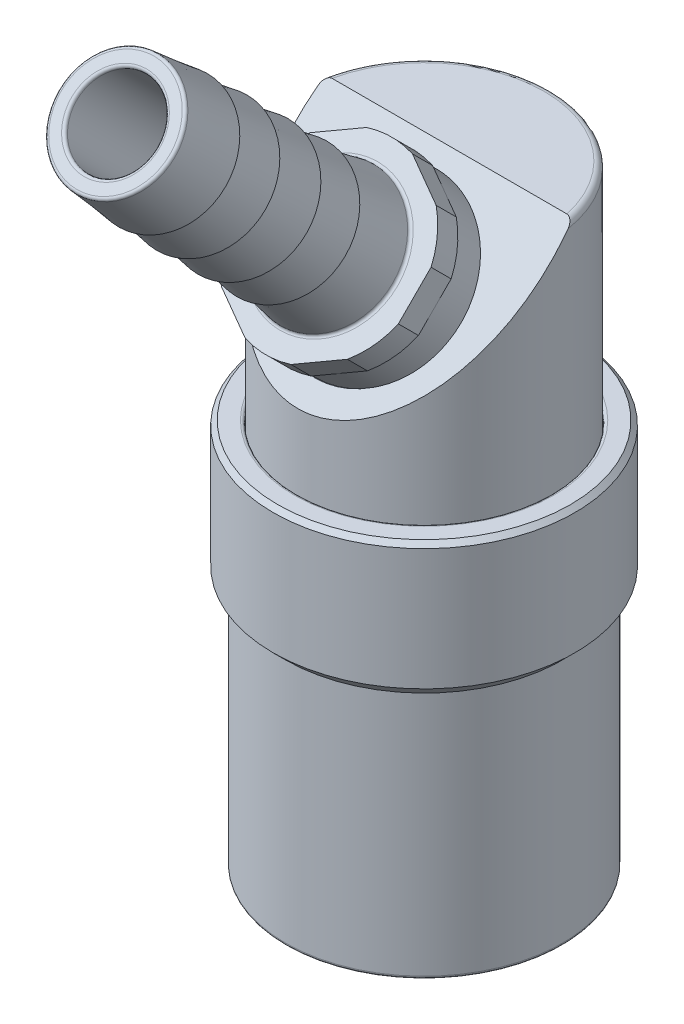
ISO-10303-21;
HEADER;
FILE_DESCRIPTION(('STEP AP214'),'2;1');
FILE_NAME('part.step','',(''),(''),'','','');
FILE_SCHEMA(('AUTOMOTIVE_DESIGN { 1 0 10303 214 1 1 1 1 }'));
ENDSEC;
DATA;
#1=APPLICATION_CONTEXT('core data for automotive mechanical design processes');
#2=APPLICATION_PROTOCOL_DEFINITION('international standard','automotive_design',2000,#1);
#3=PRODUCT_CONTEXT('',#1,'mechanical');
#4=PRODUCT('Part','Part','',(#3));
#5=PRODUCT_RELATED_PRODUCT_CATEGORY('part','',(#4));
#6=PRODUCT_DEFINITION_FORMATION('','',#4);
#7=PRODUCT_DEFINITION_CONTEXT('part definition',#1,'design');
#8=PRODUCT_DEFINITION('design','',#6,#7);
#9=PRODUCT_DEFINITION_SHAPE('','',#8);
#10=(LENGTH_UNIT() NAMED_UNIT(*) SI_UNIT(.MILLI.,.METRE.));
#11=(NAMED_UNIT(*) PLANE_ANGLE_UNIT() SI_UNIT($,.RADIAN.));
#12=(NAMED_UNIT(*) SI_UNIT($,.STERADIAN.) SOLID_ANGLE_UNIT());
#13=UNCERTAINTY_MEASURE_WITH_UNIT(LENGTH_MEASURE(1.E-05),#10,'distance_accuracy_value','');
#14=(GEOMETRIC_REPRESENTATION_CONTEXT(3) GLOBAL_UNCERTAINTY_ASSIGNED_CONTEXT((#13)) GLOBAL_UNIT_ASSIGNED_CONTEXT((#10,
#11,#12)) REPRESENTATION_CONTEXT('',''));
#15=CARTESIAN_POINT('',(0.,0.,0.));
#16=DIRECTION('',(0.,0.,1.));
#17=DIRECTION('',(1.,0.,0.));
#18=AXIS2_PLACEMENT_3D('',#15,#16,#17);
#19=CARTESIAN_POINT('',(0.,48.8065761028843,8.09669847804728));
#20=DIRECTION('',(0.,-0.707106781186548,-0.707106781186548));
#21=DIRECTION('',(0.,0.707106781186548,-0.707106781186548));
#22=AXIS2_PLACEMENT_3D('',#19,#20,#21);
#23=TOROIDAL_SURFACE('',#22,5.72757025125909,0.254);
#24=CARTESIAN_POINT('',(0.,48.7826214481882,8.07274382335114));
#25=DIRECTION('',(0.,-0.707106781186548,-0.707106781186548));
#26=DIRECTION('',(0.,-0.707106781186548,0.707106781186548));
#27=AXIS2_PLACEMENT_3D('',#24,#25,#26);
#28=CIRCLE('',#27,5.47583954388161);
#29=CARTESIAN_POINT('',(0.,52.6546247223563,4.20074054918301));
#30=VERTEX_POINT('',#29);
#31=CARTESIAN_POINT('',(0.,44.91061817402,11.9447470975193));
#32=VERTEX_POINT('',#31);
#33=EDGE_CURVE('P0_E11',#30,#32,#28,.T.);
#34=ORIENTED_EDGE('',*,*,#33,.T.);
#35=CARTESIAN_POINT('',(0.,44.7565723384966,12.1467022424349));
#36=DIRECTION('',(-1.,0.,0.));
#37=DIRECTION('',(0.,-0.707106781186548,0.707106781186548));
#38=AXIS2_PLACEMENT_3D('',#35,#36,#37);
#39=CIRCLE('',#38,0.254);
#40=CARTESIAN_POINT('',(0.,44.5769672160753,11.9670971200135));
#41=VERTEX_POINT('',#40);
#42=EDGE_CURVE('P0_E27',#32,#41,#39,.T.);
#43=ORIENTED_EDGE('',*,*,#42,.T.);
#44=CARTESIAN_POINT('',(0.,48.6269709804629,7.9170933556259));
#45=DIRECTION('',(0.,0.707106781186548,0.707106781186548));
#46=DIRECTION('',(0.,-0.707106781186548,0.707106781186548));
#47=AXIS2_PLACEMENT_3D('',#44,#45,#46);
#48=CIRCLE('',#47,5.72757025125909);
#49=CARTESIAN_POINT('',(0.,52.6769747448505,3.86708959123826));
#50=VERTEX_POINT('',#49);
#51=EDGE_CURVE('P0_E299',#41,#50,#48,.T.);
#52=ORIENTED_EDGE('',*,*,#51,.T.);
#53=CARTESIAN_POINT('',(0.,48.6269709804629,7.9170933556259));
#54=DIRECTION('',(0.,0.707106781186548,0.707106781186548));
#55=DIRECTION('',(0.,-0.707106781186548,0.707106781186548));
#56=AXIS2_PLACEMENT_3D('',#53,#54,#55);
#57=CIRCLE('',#56,5.72757025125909);
#58=EDGE_CURVE('P0_E303',#50,#41,#57,.T.);
#59=ORIENTED_EDGE('',*,*,#58,.T.);
#60=ORIENTED_EDGE('',*,*,#42,.F.);
#61=CARTESIAN_POINT('',(0.,48.7826214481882,8.07274382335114));
#62=DIRECTION('',(0.,-0.707106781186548,-0.707106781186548));
#63=DIRECTION('',(0.,-0.707106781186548,0.707106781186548));
#64=AXIS2_PLACEMENT_3D('',#61,#62,#63);
#65=CIRCLE('',#64,5.47583954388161);
#66=EDGE_CURVE('P0_E41',#32,#30,#65,.T.);
#67=ORIENTED_EDGE('',*,*,#66,.T.);
#68=EDGE_LOOP('',(#34,#43,#52,#59,#60,#67));
#69=FACE_BOUND('',#68,.T.);
#70=ADVANCED_FACE('P0_F16',(#69),#23,.F.);
#71=CARTESIAN_POINT('',(0.,50.5756865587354,9.86580893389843));
#72=DIRECTION('',(0.,-0.707106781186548,-0.707106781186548));
#73=DIRECTION('',(0.,0.707106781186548,-0.707106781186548));
#74=AXIS2_PLACEMENT_3D('',#71,#72,#73);
#75=CONICAL_SURFACE('',#74,5.13458395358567,0.133772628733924);
#76=ORIENTED_EDGE('',*,*,#33,.F.);
#77=ORIENTED_EDGE('',*,*,#66,.F.);
#78=DIRECTION('',(0.,0.795098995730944,0.606479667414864));
#79=VECTOR('',#78,1.);
#80=CARTESIAN_POINT('',(0.,46.9449874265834,13.4965080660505));
#81=LINE('',#80,#79);
#82=CARTESIAN_POINT('',(0.,49.1559540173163,15.1829726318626));
#83=VERTEX_POINT('',#82);
#84=EDGE_CURVE('P0_E320',#32,#83,#81,.T.);
#85=ORIENTED_EDGE('',*,*,#84,.T.);
#86=CARTESIAN_POINT('',(0.,52.5244021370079,11.8145245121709));
#87=DIRECTION('',(0.,-0.707106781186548,-0.707106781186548));
#88=DIRECTION('',(1.,0.,0.));
#89=AXIS2_PLACEMENT_3D('',#86,#87,#88);
#90=CIRCLE('',#89,4.76370501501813);
#91=CARTESIAN_POINT('',(0.,55.8928502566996,8.44607639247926));
#92=VERTEX_POINT('',#91);
#93=EDGE_CURVE('P0_E370',#83,#92,#90,.T.);
#94=ORIENTED_EDGE('',*,*,#93,.T.);
#95=CARTESIAN_POINT('',(0.,52.5244021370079,11.8145245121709));
#96=DIRECTION('',(0.,-0.707106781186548,-0.707106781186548));
#97=DIRECTION('',(1.,0.,0.));
#98=AXIS2_PLACEMENT_3D('',#95,#96,#97);
#99=CIRCLE('',#98,4.76370501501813);
#100=EDGE_CURVE('P0_E274',#92,#83,#99,.T.);
#101=ORIENTED_EDGE('',*,*,#100,.T.);
#102=ORIENTED_EDGE('',*,*,#84,.F.);
#103=EDGE_LOOP('',(#76,#77,#85,#94,#101,#102));
#104=FACE_BOUND('',#103,.T.);
#105=ADVANCED_FACE('P0_F626',(#104),#75,.T.);
#106=CARTESIAN_POINT('',(0.,53.8534800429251,2.69058429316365));
#107=DIRECTION('',(0.,0.707106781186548,0.707106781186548));
#108=DIRECTION('',(1.,0.,0.));
#109=AXIS2_PLACEMENT_3D('',#106,#107,#108);
#110=PLANE('',#109);
#111=DIRECTION('',(0.866025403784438,-0.353553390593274,0.353553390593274));
#112=VECTOR('',#111,1.);
#113=CARTESIAN_POINT('',(-3.38463504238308,44.1810797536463,12.3629845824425));
#114=LINE('',#113,#112);
#115=CARTESIAN_POINT('',(-5.23235152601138,44.9354068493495,11.6086574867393));
#116=VERTEX_POINT('',#115);
#117=CARTESIAN_POINT('',(-1.90504847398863,43.577041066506,12.9670232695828));
#118=VERTEX_POINT('',#117);
#119=EDGE_CURVE('P0_E271',#116,#118,#114,.T.);
#120=ORIENTED_EDGE('',*,*,#119,.T.);
#121=CARTESIAN_POINT('',(0.,48.6269709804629,7.9170933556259));
#122=DIRECTION('',(0.,-0.707106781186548,-0.707106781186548));
#123=DIRECTION('',(1.,0.,0.));
#124=AXIS2_PLACEMENT_3D('',#121,#122,#123);
#125=CIRCLE('',#124,7.3914);
#126=CARTESIAN_POINT('',(1.90504847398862,43.577041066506,12.9670232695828));
#127=VERTEX_POINT('',#126);
#128=EDGE_CURVE('P0_E241',#127,#118,#125,.T.);
#129=ORIENTED_EDGE('',*,*,#128,.F.);
#130=DIRECTION('',(0.866025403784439,0.353553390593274,-0.353553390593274));
#131=VECTOR('',#130,1.);
#132=CARTESIAN_POINT('',(6.95333504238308,45.6379954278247,10.9060689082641));
#133=LINE('',#132,#131);
#134=CARTESIAN_POINT('',(5.23235152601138,44.9354068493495,11.6086574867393));
#135=VERTEX_POINT('',#134);
#136=EDGE_CURVE('P0_E236',#127,#135,#133,.T.);
#137=ORIENTED_EDGE('',*,*,#136,.T.);
#138=CARTESIAN_POINT('',(0.,48.6269709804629,7.9170933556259));
#139=DIRECTION('',(0.,-0.707106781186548,-0.707106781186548));
#140=DIRECTION('',(1.,0.,0.));
#141=AXIS2_PLACEMENT_3D('',#138,#139,#140);
#142=CIRCLE('',#141,7.3914);
#143=CARTESIAN_POINT('',(7.1374,47.2686051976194,9.27545913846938));
#144=VERTEX_POINT('',#143);
#145=EDGE_CURVE('P0_E480',#144,#135,#142,.T.);
#146=ORIENTED_EDGE('',*,*,#145,.F.);
#147=DIRECTION('',(0.,0.707106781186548,-0.707106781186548));
#148=VECTOR('',#147,1.);
#149=CARTESIAN_POINT('',(7.1374,52.6971411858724,3.84692315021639));
#150=LINE('',#149,#148);
#151=CARTESIAN_POINT('',(7.1374,49.9853367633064,6.55872757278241));
#152=VERTEX_POINT('',#151);
#153=EDGE_CURVE('P0_E466',#144,#152,#150,.T.);
#154=ORIENTED_EDGE('',*,*,#153,.T.);
#155=CARTESIAN_POINT('',(0.,48.6269709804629,7.9170933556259));
#156=DIRECTION('',(0.,-0.707106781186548,-0.707106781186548));
#157=DIRECTION('',(1.,0.,0.));
#158=AXIS2_PLACEMENT_3D('',#155,#156,#157);
#159=CIRCLE('',#158,7.3914);
#160=CARTESIAN_POINT('',(5.23235152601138,52.3185351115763,4.22552922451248));
#161=VERTEX_POINT('',#160);
#162=EDGE_CURVE('P0_E365',#161,#152,#159,.T.);
#163=ORIENTED_EDGE('',*,*,#162,.F.);
#164=DIRECTION('',(-0.866025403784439,0.353553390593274,-0.353553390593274));
#165=VECTOR('',#164,1.);
#166=CARTESIAN_POINT('',(0.184064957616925,54.379489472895,2.16457486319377));
#167=LINE('',#166,#165);
#168=CARTESIAN_POINT('',(1.90504847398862,53.6769008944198,2.86716344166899));
#169=VERTEX_POINT('',#168);
#170=EDGE_CURVE('P0_E470',#161,#169,#167,.T.);
#171=ORIENTED_EDGE('',*,*,#170,.T.);
#172=CARTESIAN_POINT('',(0.,48.6269709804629,7.9170933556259));
#173=DIRECTION('',(0.,-0.707106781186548,-0.707106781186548));
#174=DIRECTION('',(1.,0.,0.));
#175=AXIS2_PLACEMENT_3D('',#172,#173,#174);
#176=CIRCLE('',#175,7.3914);
#177=CARTESIAN_POINT('',(-1.90504847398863,53.6769008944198,2.86716344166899));
#178=VERTEX_POINT('',#177);
#179=EDGE_CURVE('P0_E312',#178,#169,#176,.T.);
#180=ORIENTED_EDGE('',*,*,#179,.F.);
#181=DIRECTION('',(-0.866025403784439,-0.353553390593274,0.353553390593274));
#182=VECTOR('',#181,1.);
#183=CARTESIAN_POINT('',(-3.75276495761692,52.9225737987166,3.62149053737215));
#184=LINE('',#183,#182);
#185=CARTESIAN_POINT('',(-5.23235152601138,52.3185351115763,4.22552922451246));
#186=VERTEX_POINT('',#185);
#187=EDGE_CURVE('P0_E421',#178,#186,#184,.T.);
#188=ORIENTED_EDGE('',*,*,#187,.T.);
#189=CARTESIAN_POINT('',(0.,48.6269709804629,7.9170933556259));
#190=DIRECTION('',(0.,-0.707106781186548,-0.707106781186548));
#191=DIRECTION('',(1.,0.,0.));
#192=AXIS2_PLACEMENT_3D('',#189,#190,#191);
#193=CIRCLE('',#192,7.3914);
#194=CARTESIAN_POINT('',(-7.1374,49.9853367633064,6.55872757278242));
#195=VERTEX_POINT('',#194);
#196=EDGE_CURVE('P0_E409',#195,#186,#193,.T.);
#197=ORIENTED_EDGE('',*,*,#196,.F.);
#198=DIRECTION('',(0.,-0.707106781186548,0.707106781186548));
#199=VECTOR('',#198,1.);
#200=CARTESIAN_POINT('',(-7.1374,49.7833098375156,6.76075449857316));
#201=LINE('',#200,#199);
#202=CARTESIAN_POINT('',(-7.1374,47.2686051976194,9.27545913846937));
#203=VERTEX_POINT('',#202);
#204=EDGE_CURVE('P0_E384',#195,#203,#201,.T.);
#205=ORIENTED_EDGE('',*,*,#204,.T.);
#206=CARTESIAN_POINT('',(0.,48.6269709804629,7.9170933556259));
#207=DIRECTION('',(0.,-0.707106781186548,-0.707106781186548));
#208=DIRECTION('',(1.,0.,0.));
#209=AXIS2_PLACEMENT_3D('',#206,#207,#208);
#210=CIRCLE('',#209,7.3914);
#211=EDGE_CURVE('P0_E265',#116,#203,#210,.T.);
#212=ORIENTED_EDGE('',*,*,#211,.F.);
#213=EDGE_LOOP('',(#120,#129,#137,#146,#154,#163,#171,#180,#188,#197,#205,#212));
#214=FACE_BOUND('',#213,.T.);
#215=ORIENTED_EDGE('',*,*,#58,.F.);
#216=ORIENTED_EDGE('',*,*,#51,.F.);
#217=EDGE_LOOP('',(#215,#216));
#218=FACE_BOUND('',#217,.T.);
#219=ADVANCED_FACE('P0_F584',(#214,#218),#110,.T.);
#220=CARTESIAN_POINT('',(0.,66.174391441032,25.464513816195));
#221=DIRECTION('',(0.,-0.707106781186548,-0.707106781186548));
#222=DIRECTION('',(0.,0.707106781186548,-0.707106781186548));
#223=AXIS2_PLACEMENT_3D('',#220,#221,#222);
#224=TOROIDAL_SURFACE('',#223,3.6576,0.254);
#225=CARTESIAN_POINT('',(0.,66.3539965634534,25.6441189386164));
#226=DIRECTION('',(0.,0.707106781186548,0.707106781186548));
#227=DIRECTION('',(0.,-0.707106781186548,0.707106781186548));
#228=AXIS2_PLACEMENT_3D('',#225,#226,#227);
#229=CIRCLE('',#228,3.6576);
#230=CARTESIAN_POINT('',(0.,68.9403103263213,23.0578051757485));
#231=VERTEX_POINT('',#230);
#232=CARTESIAN_POINT('',(0.,63.7676828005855,28.2304327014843));
#233=VERTEX_POINT('',#232);
#234=EDGE_CURVE('P0_E279',#231,#233,#229,.T.);
#235=ORIENTED_EDGE('',*,*,#234,.T.);
#236=CARTESIAN_POINT('',(0.,63.5880776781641,28.0508275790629));
#237=DIRECTION('',(-1.,0.,0.));
#238=DIRECTION('',(0.,-0.707106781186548,0.707106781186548));
#239=AXIS2_PLACEMENT_3D('',#236,#237,#238);
#240=CIRCLE('',#239,0.254);
#241=CARTESIAN_POINT('',(0.,63.7676828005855,27.8712224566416));
#242=VERTEX_POINT('',#241);
#243=EDGE_CURVE('P0_E275',#233,#242,#240,.T.);
#244=ORIENTED_EDGE('',*,*,#243,.T.);
#245=CARTESIAN_POINT('',(0.,66.174391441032,25.464513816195));
#246=DIRECTION('',(0.,-0.707106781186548,-0.707106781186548));
#247=DIRECTION('',(0.,-0.707106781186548,0.707106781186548));
#248=AXIS2_PLACEMENT_3D('',#245,#246,#247);
#249=CIRCLE('',#248,3.4036);
#250=CARTESIAN_POINT('',(0.,68.5811000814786,23.0578051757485));
#251=VERTEX_POINT('',#250);
#252=EDGE_CURVE('P0_E280',#242,#251,#249,.T.);
#253=ORIENTED_EDGE('',*,*,#252,.T.);
#254=CARTESIAN_POINT('',(0.,66.174391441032,25.464513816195));
#255=DIRECTION('',(0.,-0.707106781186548,-0.707106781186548));
#256=DIRECTION('',(0.,-0.707106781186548,0.707106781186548));
#257=AXIS2_PLACEMENT_3D('',#254,#255,#256);
#258=CIRCLE('',#257,3.4036);
#259=EDGE_CURVE('P0_E357',#251,#242,#258,.T.);
#260=ORIENTED_EDGE('',*,*,#259,.T.);
#261=ORIENTED_EDGE('',*,*,#243,.F.);
#262=CARTESIAN_POINT('',(0.,66.3539965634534,25.6441189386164));
#263=DIRECTION('',(0.,0.707106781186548,0.707106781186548));
#264=DIRECTION('',(0.,-0.707106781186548,0.707106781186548));
#265=AXIS2_PLACEMENT_3D('',#262,#263,#264);
#266=CIRCLE('',#265,3.6576);
#267=EDGE_CURVE('P0_E297',#233,#231,#266,.T.);
#268=ORIENTED_EDGE('',*,*,#267,.T.);
#269=EDGE_LOOP('',(#235,#244,#253,#260,#261,#268));
#270=FACE_BOUND('',#269,.T.);
#271=ADVANCED_FACE('P0_F631',(#270),#224,.T.);
#272=CARTESIAN_POINT('',(0.,69.7224446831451,22.2756708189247));
#273=DIRECTION('',(0.,0.707106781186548,0.707106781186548));
#274=DIRECTION('',(1.,0.,0.));
#275=AXIS2_PLACEMENT_3D('',#272,#273,#274);
#276=PLANE('',#275);
#277=CARTESIAN_POINT('',(0.,66.3539965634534,25.6441189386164));
#278=DIRECTION('',(0.,-0.707106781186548,-0.707106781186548));
#279=DIRECTION('',(0.,-0.707106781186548,0.707106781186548));
#280=AXIS2_PLACEMENT_3D('',#277,#278,#279);
#281=CIRCLE('',#280,4.5291072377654);
#282=CARTESIAN_POINT('',(0.,69.5565590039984,22.4415564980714));
#283=VERTEX_POINT('',#282);
#284=CARTESIAN_POINT('',(0.,63.1514341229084,28.8466813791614));
#285=VERTEX_POINT('',#284);
#286=EDGE_CURVE('P0_E425',#283,#285,#281,.T.);
#287=ORIENTED_EDGE('',*,*,#286,.F.);
#288=CARTESIAN_POINT('',(0.,66.3539965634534,25.6441189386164));
#289=DIRECTION('',(0.,-0.707106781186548,-0.707106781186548));
#290=DIRECTION('',(0.,-0.707106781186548,0.707106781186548));
#291=AXIS2_PLACEMENT_3D('',#288,#289,#290);
#292=CIRCLE('',#291,4.5291072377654);
#293=EDGE_CURVE('P0_E477',#285,#283,#292,.T.);
#294=ORIENTED_EDGE('',*,*,#293,.F.);
#295=EDGE_LOOP('',(#287,#294));
#296=FACE_BOUND('',#295,.T.);
#297=ORIENTED_EDGE('',*,*,#234,.F.);
#298=ORIENTED_EDGE('',*,*,#267,.F.);
#299=EDGE_LOOP('',(#297,#298));
#300=FACE_BOUND('',#299,.T.);
#301=ADVANCED_FACE('P0_F18',(#296,#300),#276,.T.);
#302=CARTESIAN_POINT('',(0.,54.1857495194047,13.4758718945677));
#303=DIRECTION('',(0.,-0.707106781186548,-0.707106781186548));
#304=DIRECTION('',(0.,0.707106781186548,-0.707106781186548));
#305=AXIS2_PLACEMENT_3D('',#302,#303,#304);
#306=CYLINDRICAL_SURFACE('',#305,3.4036);
#307=CARTESIAN_POINT('',(0.,42.5563178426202,1.84644021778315));
#308=DIRECTION('',(0.,0.707106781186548,0.707106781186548));
#309=DIRECTION('',(0.,-0.707106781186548,0.707106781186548));
#310=AXIS2_PLACEMENT_3D('',#307,#308,#309);
#311=CIRCLE('',#310,3.4036);
#312=CARTESIAN_POINT('',(0.,44.9630264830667,-0.560268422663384));
#313=VERTEX_POINT('',#312);
#314=CARTESIAN_POINT('',(0.,40.1496092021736,4.25314885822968));
#315=VERTEX_POINT('',#314);
#316=EDGE_CURVE('P0_E337',#313,#315,#311,.T.);
#317=ORIENTED_EDGE('',*,*,#316,.F.);
#318=CARTESIAN_POINT('',(0.,42.5563178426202,1.84644021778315));
#319=DIRECTION('',(0.,0.707106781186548,0.707106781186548));
#320=DIRECTION('',(0.,-0.707106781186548,0.707106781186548));
#321=AXIS2_PLACEMENT_3D('',#318,#319,#320);
#322=CIRCLE('',#321,3.4036);
#323=EDGE_CURVE('P0_E333',#315,#313,#322,.T.);
#324=ORIENTED_EDGE('',*,*,#323,.F.);
#325=DIRECTION('',(0.,0.707106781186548,0.707106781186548));
#326=VECTOR('',#325,1.);
#327=CARTESIAN_POINT('',(0.,51.7790408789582,15.8825805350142));
#328=LINE('',#327,#326);
#329=EDGE_CURVE('P0_E293',#315,#242,#328,.T.);
#330=ORIENTED_EDGE('',*,*,#329,.T.);
#331=ORIENTED_EDGE('',*,*,#259,.F.);
#332=ORIENTED_EDGE('',*,*,#252,.F.);
#333=ORIENTED_EDGE('',*,*,#329,.F.);
#334=EDGE_LOOP('',(#317,#324,#330,#331,#332,#333));
#335=FACE_BOUND('',#334,.T.);
#336=ADVANCED_FACE('P0_F666',(#335),#306,.F.);
#337=CARTESIAN_POINT('',(0.,66.174391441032,25.464513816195));
#338=DIRECTION('',(0.,-0.707106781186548,-0.707106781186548));
#339=DIRECTION('',(0.,0.707106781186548,-0.707106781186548));
#340=AXIS2_PLACEMENT_3D('',#337,#338,#339);
#341=TOROIDAL_SURFACE('',#340,4.5291072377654,0.254);
#342=CARTESIAN_POINT('',(0.,66.1886332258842,25.4787556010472));
#343=DIRECTION('',(0.,0.707106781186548,0.707106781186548));
#344=DIRECTION('',(0.,-0.707106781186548,0.707106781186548));
#345=AXIS2_PLACEMENT_3D('',#342,#343,#344);
#346=CIRCLE('',#345,4.78230744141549);
#347=CARTESIAN_POINT('',(0.,69.570235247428,22.0971535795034));
#348=VERTEX_POINT('',#347);
#349=CARTESIAN_POINT('',(0.,62.8070312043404,28.860357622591));
#350=VERTEX_POINT('',#349);
#351=EDGE_CURVE('P0_E298',#348,#350,#346,.T.);
#352=ORIENTED_EDGE('',*,*,#351,.T.);
#353=CARTESIAN_POINT('',(0.,62.971829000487,28.66707625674));
#354=DIRECTION('',(-1.,0.,0.));
#355=DIRECTION('',(0.,-0.707106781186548,0.707106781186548));
#356=AXIS2_PLACEMENT_3D('',#353,#354,#355);
#357=CIRCLE('',#356,0.254);
#358=EDGE_CURVE('P0_E269',#350,#285,#357,.T.);
#359=ORIENTED_EDGE('',*,*,#358,.T.);
#360=ORIENTED_EDGE('',*,*,#293,.T.);
#361=ORIENTED_EDGE('',*,*,#286,.T.);
#362=ORIENTED_EDGE('',*,*,#358,.F.);
#363=CARTESIAN_POINT('',(0.,66.1886332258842,25.4787556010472));
#364=DIRECTION('',(0.,0.707106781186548,0.707106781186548));
#365=DIRECTION('',(0.,-0.707106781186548,0.707106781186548));
#366=AXIS2_PLACEMENT_3D('',#363,#364,#365);
#367=CIRCLE('',#366,4.78230744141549);
#368=EDGE_CURVE('P0_E350',#350,#348,#367,.T.);
#369=ORIENTED_EDGE('',*,*,#368,.T.);
#370=EDGE_LOOP('',(#352,#359,#360,#361,#362,#369));
#371=FACE_BOUND('',#370,.T.);
#372=ADVANCED_FACE('P0_F669',(#371),#341,.T.);
#373=CARTESIAN_POINT('',(0.,64.3783402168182,23.6684625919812));
#374=DIRECTION('',(0.,-0.707106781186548,-0.707106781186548));
#375=DIRECTION('',(0.,0.707106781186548,-0.707106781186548));
#376=AXIS2_PLACEMENT_3D('',#373,#374,#375);
#377=CONICAL_SURFACE('',#376,4.98595501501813,0.0793783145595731);
#378=CARTESIAN_POINT('',(0.,62.402683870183,21.692806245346));
#379=DIRECTION('',(0.,-0.707106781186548,-0.707106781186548));
#380=DIRECTION('',(1.,0.,0.));
#381=AXIS2_PLACEMENT_3D('',#378,#379,#380);
#382=CIRCLE('',#381,5.20820501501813);
#383=CARTESIAN_POINT('',(0.,66.0854409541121,18.0100491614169));
#384=VERTEX_POINT('',#383);
#385=CARTESIAN_POINT('',(0.,58.7199267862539,25.3755633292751));
#386=VERTEX_POINT('',#385);
#387=EDGE_CURVE('P0_E281',#384,#386,#382,.T.);
#388=ORIENTED_EDGE('',*,*,#387,.F.);
#389=CARTESIAN_POINT('',(0.,62.402683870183,21.692806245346));
#390=DIRECTION('',(0.,-0.707106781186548,-0.707106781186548));
#391=DIRECTION('',(1.,0.,0.));
#392=AXIS2_PLACEMENT_3D('',#389,#390,#391);
#393=CIRCLE('',#392,5.20820501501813);
#394=EDGE_CURVE('P0_E285',#386,#384,#393,.T.);
#395=ORIENTED_EDGE('',*,*,#394,.F.);
#396=DIRECTION('',(0.,0.760950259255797,0.64881022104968));
#397=VECTOR('',#396,1.);
#398=CARTESIAN_POINT('',(0.,60.8527376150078,27.1940651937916));
#399=LINE('',#398,#397);
#400=EDGE_CURVE('P0_E346',#386,#350,#399,.T.);
#401=ORIENTED_EDGE('',*,*,#400,.T.);
#402=ORIENTED_EDGE('',*,*,#351,.F.);
#403=ORIENTED_EDGE('',*,*,#368,.F.);
#404=ORIENTED_EDGE('',*,*,#400,.F.);
#405=EDGE_LOOP('',(#388,#395,#401,#402,#403,#404));
#406=FACE_BOUND('',#405,.T.);
#407=ADVANCED_FACE('P0_F673',(#406),#377,.T.);
#408=CARTESIAN_POINT('',(0.,36.1898397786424,7.13528754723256));
#409=DIRECTION('',(0.5,0.612372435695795,-0.612372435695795));
#410=DIRECTION('',(0.,-0.707106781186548,-0.707106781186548));
#411=AXIS2_PLACEMENT_3D('',#408,#409,#410);
#412=PLANE('',#411);
#413=DIRECTION('',(0.,-0.707106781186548,-0.707106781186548));
#414=VECTOR('',#413,1.);
#415=CARTESIAN_POINT('',(-1.90504847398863,42.7418772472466,12.1318594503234));
#416=LINE('',#415,#414);
#417=CARTESIAN_POINT('',(-1.90504847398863,41.9067134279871,11.2966956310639));
#418=VERTEX_POINT('',#417);
#419=EDGE_CURVE('P0_E240',#118,#418,#416,.T.);
#420=ORIENTED_EDGE('',*,*,#419,.F.);
#421=ORIENTED_EDGE('',*,*,#119,.F.);
#422=DIRECTION('',(0.,0.707106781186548,0.707106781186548));
#423=VECTOR('',#422,1.);
#424=CARTESIAN_POINT('',(-5.23235152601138,44.1002430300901,10.7734936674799));
#425=LINE('',#424,#423);
#426=CARTESIAN_POINT('',(-5.23235152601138,43.2650792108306,9.93832984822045));
#427=VERTEX_POINT('',#426);
#428=EDGE_CURVE('P0_E258',#427,#116,#425,.T.);
#429=ORIENTED_EDGE('',*,*,#428,.F.);
#430=DIRECTION('',(-0.866025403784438,0.353553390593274,-0.353553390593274));
#431=VECTOR('',#430,1.);
#432=CARTESIAN_POINT('',(-3.24165424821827,42.4523804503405,10.7510286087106));
#433=LINE('',#432,#431);
#434=EDGE_CURVE('P0_E325',#418,#427,#433,.T.);
#435=ORIENTED_EDGE('',*,*,#434,.F.);
#436=EDGE_LOOP('',(#420,#421,#429,#435));
#437=FACE_BOUND('',#436,.T.);
#438=ADVANCED_FACE('P0_F589',(#437),#412,.F.);
#439=CARTESIAN_POINT('',(7.1374,39.1036711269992,4.22145619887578));
#440=DIRECTION('',(-0.5,0.612372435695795,-0.612372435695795));
#441=DIRECTION('',(-0.866025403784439,-0.353553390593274,0.353553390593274));
#442=AXIS2_PLACEMENT_3D('',#439,#440,#441);
#443=PLANE('',#442);
#444=DIRECTION('',(0.,-0.707106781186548,-0.707106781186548));
#445=VECTOR('',#444,1.);
#446=CARTESIAN_POINT('',(5.23235152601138,44.1002430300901,10.7734936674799));
#447=LINE('',#446,#445);
#448=CARTESIAN_POINT('',(5.23235152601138,43.2650792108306,9.93832984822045));
#449=VERTEX_POINT('',#448);
#450=EDGE_CURVE('P0_E362',#135,#449,#447,.T.);
#451=ORIENTED_EDGE('',*,*,#450,.F.);
#452=ORIENTED_EDGE('',*,*,#136,.F.);
#453=DIRECTION('',(0.,0.707106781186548,0.707106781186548));
#454=VECTOR('',#453,1.);
#455=CARTESIAN_POINT('',(1.90504847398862,42.7418772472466,12.1318594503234));
#456=LINE('',#455,#454);
#457=CARTESIAN_POINT('',(1.90504847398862,41.9067134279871,11.2966956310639));
#458=VERTEX_POINT('',#457);
#459=EDGE_CURVE('P0_E229',#458,#127,#456,.T.);
#460=ORIENTED_EDGE('',*,*,#459,.F.);
#461=DIRECTION('',(-0.866025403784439,-0.353553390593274,0.353553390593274));
#462=VECTOR('',#461,1.);
#463=CARTESIAN_POINT('',(6.81035424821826,43.9092961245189,9.29411293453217));
#464=LINE('',#463,#462);
#465=EDGE_CURVE('P0_E233',#449,#458,#464,.T.);
#466=ORIENTED_EDGE('',*,*,#465,.F.);
#467=EDGE_LOOP('',(#451,#452,#460,#466));
#468=FACE_BOUND('',#467,.T.);
#469=ADVANCED_FACE('P0_F232',(#468),#443,.F.);
#470=CARTESIAN_POINT('',(7.1374,44.9313338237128,-1.60620649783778));
#471=DIRECTION('',(-1.,0.,0.));
#472=DIRECTION('',(0.,-0.707106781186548,0.707106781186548));
#473=AXIS2_PLACEMENT_3D('',#470,#471,#472);
#474=PLANE('',#473);
#475=DIRECTION('',(0.,-0.707106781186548,-0.707106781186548));
#476=VECTOR('',#475,1.);
#477=CARTESIAN_POINT('',(7.1374,49.150172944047,5.72356375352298));
#478=LINE('',#477,#476);
#479=CARTESIAN_POINT('',(7.1374,48.3150091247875,4.88839993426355));
#480=VERTEX_POINT('',#479);
#481=EDGE_CURVE('P0_E309',#152,#480,#478,.T.);
#482=ORIENTED_EDGE('',*,*,#481,.F.);
#483=ORIENTED_EDGE('',*,*,#153,.F.);
#484=DIRECTION('',(0.,0.707106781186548,0.707106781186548));
#485=VECTOR('',#484,1.);
#486=CARTESIAN_POINT('',(7.1374,46.43344137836,8.44029531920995));
#487=LINE('',#486,#485);
#488=CARTESIAN_POINT('',(7.1374,45.5982775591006,7.60513149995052));
#489=VERTEX_POINT('',#488);
#490=EDGE_CURVE('P0_E366',#489,#144,#487,.T.);
#491=ORIENTED_EDGE('',*,*,#490,.F.);
#492=DIRECTION('',(0.,-0.707106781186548,0.707106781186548));
#493=VECTOR('',#492,1.);
#494=CARTESIAN_POINT('',(7.1374,50.7933268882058,2.41008217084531));
#495=LINE('',#494,#493);
#496=EDGE_CURVE('P0_E374',#480,#489,#495,.T.);
#497=ORIENTED_EDGE('',*,*,#496,.F.);
#498=EDGE_LOOP('',(#482,#483,#491,#497));
#499=FACE_BOUND('',#498,.T.);
#500=ADVANCED_FACE('P0_F575',(#499),#474,.F.);
#501=CARTESIAN_POINT('',(0.,47.8451651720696,-4.52003784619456));
#502=DIRECTION('',(-0.5,-0.612372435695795,0.612372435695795));
#503=DIRECTION('',(0.,0.707106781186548,0.707106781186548));
#504=AXIS2_PLACEMENT_3D('',#501,#502,#503);
#505=PLANE('',#504);
#506=DIRECTION('',(0.,-0.707106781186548,-0.707106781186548));
#507=VECTOR('',#506,1.);
#508=CARTESIAN_POINT('',(1.90504847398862,52.8417370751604,2.03199962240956));
#509=LINE('',#508,#507);
#510=CARTESIAN_POINT('',(1.90504847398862,52.0065732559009,1.19683580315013));
#511=VERTEX_POINT('',#510);
#512=EDGE_CURVE('P0_E413',#169,#511,#509,.T.);
#513=ORIENTED_EDGE('',*,*,#512,.F.);
#514=ORIENTED_EDGE('',*,*,#170,.F.);
#515=DIRECTION('',(0.,0.707106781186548,0.707106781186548));
#516=VECTOR('',#515,1.);
#517=CARTESIAN_POINT('',(5.23235152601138,51.4833712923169,3.39036540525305));
#518=LINE('',#517,#516);
#519=CARTESIAN_POINT('',(5.23235152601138,50.6482074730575,2.55520158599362));
#520=VERTEX_POINT('',#519);
#521=EDGE_CURVE('P0_E313',#520,#161,#518,.T.);
#522=ORIENTED_EDGE('',*,*,#521,.F.);
#523=DIRECTION('',(0.866025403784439,-0.353553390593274,0.353553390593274));
#524=VECTOR('',#523,1.);
#525=CARTESIAN_POINT('',(0.327045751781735,52.6507901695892,0.552618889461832));
#526=LINE('',#525,#524);
#527=EDGE_CURVE('P0_E408',#511,#520,#526,.T.);
#528=ORIENTED_EDGE('',*,*,#527,.F.);
#529=EDGE_LOOP('',(#513,#514,#522,#528));
#530=FACE_BOUND('',#529,.T.);
#531=ADVANCED_FACE('P0_F675',(#530),#505,.F.);
#532=CARTESIAN_POINT('',(-7.1374,44.9313338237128,-1.60620649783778));
#533=DIRECTION('',(0.5,-0.612372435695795,0.612372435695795));
#534=DIRECTION('',(0.,-0.707106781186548,-0.707106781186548));
#535=AXIS2_PLACEMENT_3D('',#532,#533,#534);
#536=PLANE('',#535);
#537=DIRECTION('',(0.,-0.707106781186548,-0.707106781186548));
#538=VECTOR('',#537,1.);
#539=CARTESIAN_POINT('',(-5.23235152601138,51.4833712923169,3.39036540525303));
#540=LINE('',#539,#538);
#541=CARTESIAN_POINT('',(-5.23235152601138,50.6482074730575,2.5552015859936));
#542=VERTEX_POINT('',#541);
#543=EDGE_CURVE('P0_E414',#186,#542,#540,.T.);
#544=ORIENTED_EDGE('',*,*,#543,.F.);
#545=ORIENTED_EDGE('',*,*,#187,.F.);
#546=DIRECTION('',(0.,0.707106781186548,0.707106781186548));
#547=VECTOR('',#546,1.);
#548=CARTESIAN_POINT('',(-1.90504847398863,52.8417370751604,2.03199962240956));
#549=LINE('',#548,#547);
#550=CARTESIAN_POINT('',(-1.90504847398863,52.0065732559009,1.19683580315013));
#551=VERTEX_POINT('',#550);
#552=EDGE_CURVE('P0_E356',#551,#178,#549,.T.);
#553=ORIENTED_EDGE('',*,*,#552,.F.);
#554=DIRECTION('',(0.866025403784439,0.353553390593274,-0.353553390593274));
#555=VECTOR('',#554,1.);
#556=CARTESIAN_POINT('',(-3.89574575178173,51.1938744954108,2.00953456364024));
#557=LINE('',#556,#555);
#558=EDGE_CURVE('P0_E401',#542,#551,#557,.T.);
#559=ORIENTED_EDGE('',*,*,#558,.F.);
#560=EDGE_LOOP('',(#544,#545,#553,#559));
#561=FACE_BOUND('',#560,.T.);
#562=ADVANCED_FACE('P0_F454',(#561),#536,.F.);
#563=CARTESIAN_POINT('',(-7.1374,39.1036711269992,4.22145619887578));
#564=DIRECTION('',(1.,0.,0.));
#565=DIRECTION('',(0.,-0.707106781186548,0.707106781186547));
#566=AXIS2_PLACEMENT_3D('',#563,#564,#565);
#567=PLANE('',#566);
#568=DIRECTION('',(0.,-0.707106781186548,-0.707106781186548));
#569=VECTOR('',#568,1.);
#570=CARTESIAN_POINT('',(-7.1374,46.43344137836,8.44029531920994));
#571=LINE('',#570,#569);
#572=CARTESIAN_POINT('',(-7.1374,45.5982775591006,7.60513149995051));
#573=VERTEX_POINT('',#572);
#574=EDGE_CURVE('P0_E416',#203,#573,#571,.T.);
#575=ORIENTED_EDGE('',*,*,#574,.F.);
#576=ORIENTED_EDGE('',*,*,#204,.F.);
#577=DIRECTION('',(0.,0.707106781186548,0.707106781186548));
#578=VECTOR('',#577,1.);
#579=CARTESIAN_POINT('',(-7.1374,49.1501729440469,5.72356375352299));
#580=LINE('',#579,#578);
#581=CARTESIAN_POINT('',(-7.1374,48.3150091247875,4.88839993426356));
#582=VERTEX_POINT('',#581);
#583=EDGE_CURVE('P0_E412',#582,#195,#580,.T.);
#584=ORIENTED_EDGE('',*,*,#583,.F.);
#585=DIRECTION('',(0.,0.707106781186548,-0.707106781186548));
#586=VECTOR('',#585,1.);
#587=CARTESIAN_POINT('',(-7.1374,47.879495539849,5.3239135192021));
#588=LINE('',#587,#586);
#589=EDGE_CURVE('P0_E326',#573,#582,#588,.T.);
#590=ORIENTED_EDGE('',*,*,#589,.F.);
#591=EDGE_LOOP('',(#575,#576,#584,#590));
#592=FACE_BOUND('',#591,.T.);
#593=ADVANCED_FACE('P0_F597',(#592),#567,.F.);
#594=CARTESIAN_POINT('',(0.,51.7161790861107,1.48722997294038));
#595=DIRECTION('',(0.,-0.707106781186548,-0.707106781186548));
#596=DIRECTION('',(0.,0.707106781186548,-0.707106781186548));
#597=AXIS2_PLACEMENT_3D('',#594,#595,#596);
#598=PLANE('',#597);
#599=ORIENTED_EDGE('',*,*,#434,.T.);
#600=CARTESIAN_POINT('',(0.,46.956643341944,6.24676571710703));
#601=DIRECTION('',(0.,-0.707106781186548,-0.707106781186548));
#602=DIRECTION('',(1.,0.,0.));
#603=AXIS2_PLACEMENT_3D('',#600,#601,#602);
#604=CIRCLE('',#603,7.3914);
#605=EDGE_CURVE('P0_E321',#427,#573,#604,.T.);
#606=ORIENTED_EDGE('',*,*,#605,.T.);
#607=ORIENTED_EDGE('',*,*,#589,.T.);
#608=CARTESIAN_POINT('',(0.,46.956643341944,6.24676571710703));
#609=DIRECTION('',(0.,-0.707106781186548,-0.707106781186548));
#610=DIRECTION('',(1.,0.,0.));
#611=AXIS2_PLACEMENT_3D('',#608,#609,#610);
#612=CIRCLE('',#611,7.3914);
#613=EDGE_CURVE('P0_E397',#582,#542,#612,.T.);
#614=ORIENTED_EDGE('',*,*,#613,.T.);
#615=ORIENTED_EDGE('',*,*,#558,.T.);
#616=CARTESIAN_POINT('',(0.,46.956643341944,6.24676571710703));
#617=DIRECTION('',(0.,-0.707106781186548,-0.707106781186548));
#618=DIRECTION('',(1.,0.,0.));
#619=AXIS2_PLACEMENT_3D('',#616,#617,#618);
#620=CIRCLE('',#619,7.3914);
#621=EDGE_CURVE('P0_E429',#551,#511,#620,.T.);
#622=ORIENTED_EDGE('',*,*,#621,.T.);
#623=ORIENTED_EDGE('',*,*,#527,.T.);
#624=CARTESIAN_POINT('',(0.,46.956643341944,6.24676571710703));
#625=DIRECTION('',(0.,-0.707106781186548,-0.707106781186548));
#626=DIRECTION('',(1.,0.,0.));
#627=AXIS2_PLACEMENT_3D('',#624,#625,#626);
#628=CIRCLE('',#627,7.3914);
#629=EDGE_CURVE('P0_E377',#520,#480,#628,.T.);
#630=ORIENTED_EDGE('',*,*,#629,.T.);
#631=ORIENTED_EDGE('',*,*,#496,.T.);
#632=CARTESIAN_POINT('',(0.,46.956643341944,6.24676571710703));
#633=DIRECTION('',(0.,-0.707106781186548,-0.707106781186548));
#634=DIRECTION('',(1.,0.,0.));
#635=AXIS2_PLACEMENT_3D('',#632,#633,#634);
#636=CIRCLE('',#635,7.3914);
#637=EDGE_CURVE('P0_E251',#489,#449,#636,.T.);
#638=ORIENTED_EDGE('',*,*,#637,.T.);
#639=ORIENTED_EDGE('',*,*,#465,.T.);
#640=CARTESIAN_POINT('',(0.,46.956643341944,6.24676571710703));
#641=DIRECTION('',(0.,-0.707106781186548,-0.707106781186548));
#642=DIRECTION('',(1.,0.,0.));
#643=AXIS2_PLACEMENT_3D('',#640,#641,#642);
#644=CIRCLE('',#643,7.3914);
#645=EDGE_CURVE('P0_E248',#458,#418,#644,.T.);
#646=ORIENTED_EDGE('',*,*,#645,.T.);
#647=EDGE_LOOP('',(#599,#606,#607,#614,#615,#622,#623,#630,#631,#638,#639,#646));
#648=FACE_BOUND('',#647,.T.);
#649=CARTESIAN_POINT('',(0.,46.956643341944,6.24676571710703));
#650=DIRECTION('',(0.,-0.707106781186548,-0.707106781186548));
#651=DIRECTION('',(0.,0.707106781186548,-0.707106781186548));
#652=AXIS2_PLACEMENT_3D('',#649,#650,#651);
#653=CIRCLE('',#652,7.0866);
#654=CARTESIAN_POINT('',(0.,41.9456604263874,11.2577486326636));
#655=VERTEX_POINT('',#654);
#656=EDGE_CURVE('P0_E284',#655,#655,#653,.T.);
#657=ORIENTED_EDGE('',*,*,#656,.F.);
#658=EDGE_LOOP('',(#657));
#659=FACE_BOUND('',#658,.T.);
#660=ADVANCED_FACE('P0_F246',(#648,#659),#598,.T.);
#661=CARTESIAN_POINT('',(0.,47.7918071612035,7.08192953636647));
#662=DIRECTION('',(0.,-0.707106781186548,-0.707106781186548));
#663=DIRECTION('',(0.,0.707106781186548,-0.707106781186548));
#664=AXIS2_PLACEMENT_3D('',#661,#662,#663);
#665=CYLINDRICAL_SURFACE('',#664,7.3914);
#666=ORIENTED_EDGE('',*,*,#428,.T.);
#667=ORIENTED_EDGE('',*,*,#211,.T.);
#668=ORIENTED_EDGE('',*,*,#574,.T.);
#669=ORIENTED_EDGE('',*,*,#605,.F.);
#670=EDGE_LOOP('',(#666,#667,#668,#669));
#671=FACE_BOUND('',#670,.T.);
#672=ADVANCED_FACE('P0_F591',(#671),#665,.T.);
#673=CARTESIAN_POINT('',(0.,47.7918071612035,7.08192953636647));
#674=DIRECTION('',(0.,-0.707106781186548,-0.707106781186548));
#675=DIRECTION('',(0.,0.707106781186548,-0.707106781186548));
#676=AXIS2_PLACEMENT_3D('',#673,#674,#675);
#677=CYLINDRICAL_SURFACE('',#676,7.3914);
#678=ORIENTED_EDGE('',*,*,#543,.T.);
#679=ORIENTED_EDGE('',*,*,#613,.F.);
#680=ORIENTED_EDGE('',*,*,#583,.T.);
#681=ORIENTED_EDGE('',*,*,#196,.T.);
#682=EDGE_LOOP('',(#678,#679,#680,#681));
#683=FACE_BOUND('',#682,.T.);
#684=ADVANCED_FACE('P0_F447',(#683),#677,.T.);
#685=CARTESIAN_POINT('',(0.,47.7918071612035,7.08192953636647));
#686=DIRECTION('',(0.,-0.707106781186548,-0.707106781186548));
#687=DIRECTION('',(0.,0.707106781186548,-0.707106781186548));
#688=AXIS2_PLACEMENT_3D('',#685,#686,#687);
#689=CYLINDRICAL_SURFACE('',#688,7.3914);
#690=ORIENTED_EDGE('',*,*,#512,.T.);
#691=ORIENTED_EDGE('',*,*,#621,.F.);
#692=ORIENTED_EDGE('',*,*,#552,.T.);
#693=ORIENTED_EDGE('',*,*,#179,.T.);
#694=EDGE_LOOP('',(#690,#691,#692,#693));
#695=FACE_BOUND('',#694,.T.);
#696=ADVANCED_FACE('P0_F648',(#695),#689,.T.);
#697=CARTESIAN_POINT('',(0.,47.7918071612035,7.08192953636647));
#698=DIRECTION('',(0.,-0.707106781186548,-0.707106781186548));
#699=DIRECTION('',(0.,0.707106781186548,-0.707106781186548));
#700=AXIS2_PLACEMENT_3D('',#697,#698,#699);
#701=CYLINDRICAL_SURFACE('',#700,7.3914);
#702=ORIENTED_EDGE('',*,*,#481,.T.);
#703=ORIENTED_EDGE('',*,*,#629,.F.);
#704=ORIENTED_EDGE('',*,*,#521,.T.);
#705=ORIENTED_EDGE('',*,*,#162,.T.);
#706=EDGE_LOOP('',(#702,#703,#704,#705));
#707=FACE_BOUND('',#706,.T.);
#708=ADVANCED_FACE('P0_F581',(#707),#701,.T.);
#709=CARTESIAN_POINT('',(0.,47.7918071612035,7.08192953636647));
#710=DIRECTION('',(0.,-0.707106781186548,-0.707106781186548));
#711=DIRECTION('',(0.,0.707106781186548,-0.707106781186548));
#712=AXIS2_PLACEMENT_3D('',#709,#710,#711);
#713=CYLINDRICAL_SURFACE('',#712,7.3914);
#714=ORIENTED_EDGE('',*,*,#450,.T.);
#715=ORIENTED_EDGE('',*,*,#637,.F.);
#716=ORIENTED_EDGE('',*,*,#490,.T.);
#717=ORIENTED_EDGE('',*,*,#145,.T.);
#718=EDGE_LOOP('',(#714,#715,#716,#717));
#719=FACE_BOUND('',#718,.T.);
#720=ADVANCED_FACE('P0_F567',(#719),#713,.T.);
#721=CARTESIAN_POINT('',(0.,42.2869101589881,1.57703253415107));
#722=DIRECTION('',(0.,-0.707106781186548,-0.707106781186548));
#723=DIRECTION('',(0.,-0.707106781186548,0.707106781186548));
#724=AXIS2_PLACEMENT_3D('',#721,#722,#723);
#725=CONICAL_SURFACE('',#724,3.7846,0.785398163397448);
#726=ORIENTED_EDGE('',*,*,#316,.T.);
#727=ORIENTED_EDGE('',*,*,#323,.T.);
#728=DIRECTION('',(0.,0.,-1.));
#729=VECTOR('',#728,1.);
#730=CARTESIAN_POINT('',(0.,44.9630264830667,-1.09908378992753));
#731=LINE('',#730,#729);
#732=CARTESIAN_POINT('',(0.,44.9630264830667,-1.63789915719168));
#733=VERTEX_POINT('',#732);
#734=EDGE_CURVE('P0_E338',#313,#733,#731,.T.);
#735=ORIENTED_EDGE('',*,*,#734,.T.);
#736=CARTESIAN_POINT('',(0.,42.017502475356,1.307624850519));
#737=DIRECTION('',(0.,-0.707106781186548,-0.707106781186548));
#738=DIRECTION('',(0.,-0.707106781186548,0.707106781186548));
#739=AXIS2_PLACEMENT_3D('',#736,#737,#738);
#740=CIRCLE('',#739,4.1656);
#741=EDGE_CURVE('P0_E388',#733,#733,#740,.T.);
#742=ORIENTED_EDGE('',*,*,#741,.T.);
#743=ORIENTED_EDGE('',*,*,#734,.F.);
#744=EDGE_LOOP('',(#726,#727,#735,#742,#743));
#745=FACE_BOUND('',#744,.T.);
#746=ADVANCED_FACE('P0_F684',(#745),#725,.F.);
#747=CARTESIAN_POINT('',(0.,44.4242111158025,-1.09908378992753));
#748=DIRECTION('',(0.,-0.707106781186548,-0.707106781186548));
#749=DIRECTION('',(0.,0.707106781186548,-0.707106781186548));
#750=AXIS2_PLACEMENT_3D('',#747,#748,#749);
#751=PLANE('',#750);
#752=CARTESIAN_POINT('',(0.,42.017502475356,1.307624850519));
#753=DIRECTION('',(0.,0.707106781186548,0.707106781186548));
#754=DIRECTION('',(0.,-0.707106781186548,0.707106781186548));
#755=AXIS2_PLACEMENT_3D('',#752,#753,#754);
#756=CIRCLE('',#755,5.969);
#757=CARTESIAN_POINT('',(0.,46.2382228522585,-2.9130955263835));
#758=VERTEX_POINT('',#757);
#759=EDGE_CURVE('P0_E392',#758,#758,#756,.T.);
#760=ORIENTED_EDGE('',*,*,#759,.F.);
#761=EDGE_LOOP('',(#760));
#762=FACE_BOUND('',#761,.T.);
#763=ORIENTED_EDGE('',*,*,#741,.F.);
#764=EDGE_LOOP('',(#763));
#765=FACE_BOUND('',#764,.T.);
#766=ADVANCED_FACE('P0_F681',(#762,#765),#751,.T.);
#767=CARTESIAN_POINT('',(0.,42.2869101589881,1.57703253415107));
#768=DIRECTION('',(0.,0.707106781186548,0.707106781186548));
#769=DIRECTION('',(0.,-0.707106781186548,0.707106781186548));
#770=AXIS2_PLACEMENT_3D('',#767,#768,#769);
#771=CONICAL_SURFACE('',#770,6.35,0.785398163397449);
#772=ORIENTED_EDGE('',*,*,#759,.T.);
#773=DIRECTION('',(0.,1.,0.));
#774=VECTOR('',#773,1.);
#775=CARTESIAN_POINT('',(0.,46.7770382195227,-2.9130955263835));
#776=LINE('',#775,#774);
#777=CARTESIAN_POINT('',(0.,47.8187479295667,-2.9130955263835));
#778=VERTEX_POINT('',#777);
#779=EDGE_CURVE('P0_E396',#758,#778,#776,.T.);
#780=ORIENTED_EDGE('',*,*,#779,.T.);
#781=CARTESIAN_POINT('',(0.,42.8077650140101,2.09788738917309));
#782=DIRECTION('',(0.,-0.707106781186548,-0.707106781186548));
#783=DIRECTION('',(0.,0.707106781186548,-0.707106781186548));
#784=AXIS2_PLACEMENT_3D('',#781,#782,#783);
#785=CIRCLE('',#784,7.0866);
#786=CARTESIAN_POINT('',(0.,37.7967820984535,7.10887030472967));
#787=VERTEX_POINT('',#786);
#788=EDGE_CURVE('P0_E486',#778,#787,#785,.T.);
#789=ORIENTED_EDGE('',*,*,#788,.T.);
#790=CARTESIAN_POINT('',(0.,42.8077650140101,2.09788738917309));
#791=DIRECTION('',(0.,-0.707106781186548,-0.707106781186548));
#792=DIRECTION('',(0.,0.707106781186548,-0.707106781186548));
#793=AXIS2_PLACEMENT_3D('',#790,#791,#792);
#794=CIRCLE('',#793,7.0866);
#795=EDGE_CURVE('P0_E308',#787,#778,#794,.T.);
#796=ORIENTED_EDGE('',*,*,#795,.T.);
#797=ORIENTED_EDGE('',*,*,#779,.F.);
#798=EDGE_LOOP('',(#772,#780,#789,#796,#797));
#799=FACE_BOUND('',#798,.T.);
#800=ADVANCED_FACE('P0_F664',(#799),#771,.T.);
#801=CARTESIAN_POINT('',(0.,44.48707290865,3.77719528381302));
#802=DIRECTION('',(0.,-0.707106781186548,-0.707106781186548));
#803=DIRECTION('',(0.,0.707106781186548,-0.707106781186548));
#804=AXIS2_PLACEMENT_3D('',#801,#802,#803);
#805=CYLINDRICAL_SURFACE('',#804,7.0866);
#806=ORIENTED_EDGE('',*,*,#795,.F.);
#807=DIRECTION('',(0.,0.707106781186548,0.707106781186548));
#808=VECTOR('',#807,1.);
#809=CARTESIAN_POINT('',(0.,39.4760899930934,8.78817819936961));
#810=LINE('',#809,#808);
#811=EDGE_CURVE('P0_E304',#787,#655,#810,.T.);
#812=ORIENTED_EDGE('',*,*,#811,.T.);
#813=ORIENTED_EDGE('',*,*,#656,.T.);
#814=ORIENTED_EDGE('',*,*,#811,.F.);
#815=ORIENTED_EDGE('',*,*,#788,.F.);
#816=EDGE_LOOP('',(#806,#812,#813,#814,#815));
#817=FACE_BOUND('',#816,.T.);
#818=ADVANCED_FACE('P0_F660',(#817),#805,.T.);
#819=CARTESIAN_POINT('',(0.,65.7711319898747,18.3243581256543));
#820=DIRECTION('',(0.,-0.707106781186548,-0.707106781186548));
#821=DIRECTION('',(0.,0.707106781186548,-0.707106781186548));
#822=AXIS2_PLACEMENT_3D('',#819,#820,#821);
#823=PLANE('',#822);
#824=ORIENTED_EDGE('',*,*,#387,.T.);
#825=ORIENTED_EDGE('',*,*,#394,.T.);
#826=EDGE_LOOP('',(#824,#825));
#827=FACE_BOUND('',#826,.T.);
#828=CARTESIAN_POINT('',(0.,62.402683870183,21.692806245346));
#829=DIRECTION('',(0.,-0.707106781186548,-0.707106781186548));
#830=DIRECTION('',(1.,0.,0.));
#831=AXIS2_PLACEMENT_3D('',#828,#829,#830);
#832=CIRCLE('',#831,4.76370501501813);
#833=CARTESIAN_POINT('',(0.,65.7711319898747,18.3243581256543));
#834=VERTEX_POINT('',#833);
#835=CARTESIAN_POINT('',(0.,59.0342357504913,25.0612543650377));
#836=VERTEX_POINT('',#835);
#837=EDGE_CURVE('P0_E291',#834,#836,#832,.T.);
#838=ORIENTED_EDGE('',*,*,#837,.F.);
#839=CARTESIAN_POINT('',(0.,62.402683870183,21.692806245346));
#840=DIRECTION('',(0.,-0.707106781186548,-0.707106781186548));
#841=DIRECTION('',(1.,0.,0.));
#842=AXIS2_PLACEMENT_3D('',#839,#840,#841);
#843=CIRCLE('',#842,4.76370501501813);
#844=EDGE_CURVE('P0_E391',#836,#834,#843,.T.);
#845=ORIENTED_EDGE('',*,*,#844,.F.);
#846=EDGE_LOOP('',(#838,#845));
#847=FACE_BOUND('',#846,.T.);
#848=ADVANCED_FACE('P0_F663',(#827,#847),#823,.T.);
#849=CARTESIAN_POINT('',(0.,60.7862377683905,20.0763601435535));
#850=DIRECTION('',(0.,-0.707106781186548,-0.707106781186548));
#851=DIRECTION('',(0.,0.707106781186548,-0.707106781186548));
#852=AXIS2_PLACEMENT_3D('',#849,#850,#851);
#853=CONICAL_SURFACE('',#852,5.02405501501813,0.113400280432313);
#854=CARTESIAN_POINT('',(0.,59.1697916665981,18.4599140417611));
#855=DIRECTION('',(0.,-0.707106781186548,-0.707106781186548));
#856=DIRECTION('',(1.,0.,0.));
#857=AXIS2_PLACEMENT_3D('',#854,#855,#856);
#858=CIRCLE('',#857,5.28440501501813);
#859=CARTESIAN_POINT('',(0.,62.9064302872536,14.7232754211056));
#860=VERTEX_POINT('',#859);
#861=CARTESIAN_POINT('',(0.,55.4331530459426,22.1965526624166));
#862=VERTEX_POINT('',#861);
#863=EDGE_CURVE('P0_E287',#860,#862,#858,.T.);
#864=ORIENTED_EDGE('',*,*,#863,.F.);
#865=CARTESIAN_POINT('',(0.,59.1697916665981,18.4599140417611));
#866=DIRECTION('',(0.,-0.707106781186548,-0.707106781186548));
#867=DIRECTION('',(1.,0.,0.));
#868=AXIS2_PLACEMENT_3D('',#865,#866,#867);
#869=CIRCLE('',#868,5.28440501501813);
#870=EDGE_CURVE('P0_E292',#862,#860,#869,.T.);
#871=ORIENTED_EDGE('',*,*,#870,.F.);
#872=DIRECTION('',(0.,0.782579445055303,0.622550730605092));
#873=VECTOR('',#872,1.);
#874=CARTESIAN_POINT('',(0.,57.2336943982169,23.6289035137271));
#875=LINE('',#874,#873);
#876=EDGE_CURVE('P0_E342',#862,#836,#875,.T.);
#877=ORIENTED_EDGE('',*,*,#876,.T.);
#878=ORIENTED_EDGE('',*,*,#844,.T.);
#879=ORIENTED_EDGE('',*,*,#837,.T.);
#880=ORIENTED_EDGE('',*,*,#876,.F.);
#881=EDGE_LOOP('',(#864,#871,#877,#878,#879,#880));
#882=FACE_BOUND('',#881,.T.);
#883=ADVANCED_FACE('P0_F688',(#882),#853,.T.);
#884=CARTESIAN_POINT('',(0.,62.5177847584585,15.1119209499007));
#885=DIRECTION('',(0.,-0.707106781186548,-0.707106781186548));
#886=DIRECTION('',(0.,0.707106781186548,-0.707106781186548));
#887=AXIS2_PLACEMENT_3D('',#884,#885,#886);
#888=PLANE('',#887);
#889=ORIENTED_EDGE('',*,*,#863,.T.);
#890=ORIENTED_EDGE('',*,*,#870,.T.);
#891=EDGE_LOOP('',(#889,#890));
#892=FACE_BOUND('',#891,.T.);
#893=CARTESIAN_POINT('',(0.,59.1697916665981,18.4599140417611));
#894=DIRECTION('',(0.,-0.707106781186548,-0.707106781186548));
#895=DIRECTION('',(1.,0.,0.));
#896=AXIS2_PLACEMENT_3D('',#893,#894,#895);
#897=CIRCLE('',#896,4.73477723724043);
#898=CARTESIAN_POINT('',(0.,62.5177847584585,15.1119209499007));
#899=VERTEX_POINT('',#898);
#900=CARTESIAN_POINT('',(0.,55.8217985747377,21.8079071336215));
#901=VERTEX_POINT('',#900);
#902=EDGE_CURVE('P0_E332',#899,#901,#897,.T.);
#903=ORIENTED_EDGE('',*,*,#902,.F.);
#904=CARTESIAN_POINT('',(0.,59.1697916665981,18.4599140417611));
#905=DIRECTION('',(0.,-0.707106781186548,-0.707106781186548));
#906=DIRECTION('',(1.,0.,0.));
#907=AXIS2_PLACEMENT_3D('',#904,#905,#906);
#908=CIRCLE('',#907,4.73477723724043);
#909=EDGE_CURVE('P0_E327',#901,#899,#908,.T.);
#910=ORIENTED_EDGE('',*,*,#909,.F.);
#911=EDGE_LOOP('',(#903,#910));
#912=FACE_BOUND('',#911,.T.);
#913=ADVANCED_FACE('P0_F656',(#892,#912),#888,.T.);
#914=CARTESIAN_POINT('',(0.,57.4635430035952,16.7536653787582));
#915=DIRECTION('',(0.,-0.707106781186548,-0.707106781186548));
#916=DIRECTION('',(0.,0.707106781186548,-0.707106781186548));
#917=AXIS2_PLACEMENT_3D('',#914,#915,#916);
#918=CONICAL_SURFACE('',#917,5.00959112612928,0.113400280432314);
#919=CARTESIAN_POINT('',(0.,55.7572943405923,15.0474167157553));
#920=DIRECTION('',(0.,-0.707106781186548,-0.707106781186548));
#921=DIRECTION('',(1.,0.,0.));
#922=AXIS2_PLACEMENT_3D('',#919,#920,#921);
#923=CIRCLE('',#922,5.28440501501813);
#924=CARTESIAN_POINT('',(0.,59.4939329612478,11.3107780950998));
#925=VERTEX_POINT('',#924);
#926=CARTESIAN_POINT('',(0.,52.0206557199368,18.7840553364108));
#927=VERTEX_POINT('',#926);
#928=EDGE_CURVE('P0_E489',#925,#927,#923,.T.);
#929=ORIENTED_EDGE('',*,*,#928,.F.);
#930=CARTESIAN_POINT('',(0.,55.7572943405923,15.0474167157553));
#931=DIRECTION('',(0.,-0.707106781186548,-0.707106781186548));
#932=DIRECTION('',(1.,0.,0.));
#933=AXIS2_PLACEMENT_3D('',#930,#931,#932);
#934=CIRCLE('',#933,5.28440501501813);
#935=EDGE_CURVE('P0_E494',#927,#925,#934,.T.);
#936=ORIENTED_EDGE('',*,*,#935,.F.);
#937=DIRECTION('',(0.,0.782579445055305,0.62255073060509));
#938=VECTOR('',#937,1.);
#939=CARTESIAN_POINT('',(0.,53.9212271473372,20.2959812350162));
#940=LINE('',#939,#938);
#941=EDGE_CURVE('P0_E331',#927,#901,#940,.T.);
#942=ORIENTED_EDGE('',*,*,#941,.T.);
#943=ORIENTED_EDGE('',*,*,#909,.T.);
#944=ORIENTED_EDGE('',*,*,#902,.T.);
#945=ORIENTED_EDGE('',*,*,#941,.F.);
#946=EDGE_LOOP('',(#929,#936,#942,#943,#944,#945));
#947=FACE_BOUND('',#946,.T.);
#948=ADVANCED_FACE('P0_F652',(#947),#918,.T.);
#949=CARTESIAN_POINT('',(0.,59.1257424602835,11.6789685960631));
#950=DIRECTION('',(0.,-0.707106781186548,-0.707106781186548));
#951=DIRECTION('',(0.,0.707106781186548,-0.707106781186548));
#952=AXIS2_PLACEMENT_3D('',#949,#950,#951);
#953=PLANE('',#952);
#954=ORIENTED_EDGE('',*,*,#928,.T.);
#955=ORIENTED_EDGE('',*,*,#935,.T.);
#956=EDGE_LOOP('',(#954,#955));
#957=FACE_BOUND('',#956,.T.);
#958=CARTESIAN_POINT('',(0.,55.7572943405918,15.0474167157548));
#959=DIRECTION('',(0.,-0.707106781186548,-0.707106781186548));
#960=DIRECTION('',(1.,0.,0.));
#961=AXIS2_PLACEMENT_3D('',#958,#959,#960);
#962=CIRCLE('',#961,4.76370501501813);
#963=CARTESIAN_POINT('',(0.,59.1257424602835,11.6789685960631));
#964=VERTEX_POINT('',#963);
#965=CARTESIAN_POINT('',(0.,52.3888462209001,18.4158648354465));
#966=VERTEX_POINT('',#965);
#967=EDGE_CURVE('P0_E314',#964,#966,#962,.T.);
#968=ORIENTED_EDGE('',*,*,#967,.F.);
#969=CARTESIAN_POINT('',(0.,55.7572943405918,15.0474167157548));
#970=DIRECTION('',(0.,-0.707106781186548,-0.707106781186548));
#971=DIRECTION('',(1.,0.,0.));
#972=AXIS2_PLACEMENT_3D('',#969,#970,#971);
#973=CIRCLE('',#972,4.76370501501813);
#974=EDGE_CURVE('P0_E317',#966,#964,#973,.T.);
#975=ORIENTED_EDGE('',*,*,#974,.F.);
#976=EDGE_LOOP('',(#968,#975));
#977=FACE_BOUND('',#976,.T.);
#978=ADVANCED_FACE('P0_F655',(#957,#977),#953,.T.);
#979=CARTESIAN_POINT('',(0.,54.1408482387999,13.4309706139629));
#980=DIRECTION('',(0.,-0.707106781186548,-0.707106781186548));
#981=DIRECTION('',(0.,0.707106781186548,-0.707106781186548));
#982=AXIS2_PLACEMENT_3D('',#979,#980,#981);
#983=CONICAL_SURFACE('',#982,5.02405501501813,0.113400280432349);
#984=CARTESIAN_POINT('',(0.,52.5244021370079,11.8145245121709));
#985=DIRECTION('',(0.,-0.707106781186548,-0.707106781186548));
#986=DIRECTION('',(1.,0.,0.));
#987=AXIS2_PLACEMENT_3D('',#984,#985,#986);
#988=CIRCLE('',#987,5.28440501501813);
#989=CARTESIAN_POINT('',(0.,56.2610407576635,8.07788589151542));
#990=VERTEX_POINT('',#989);
#991=CARTESIAN_POINT('',(0.,48.7877635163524,15.5511631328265));
#992=VERTEX_POINT('',#991);
#993=EDGE_CURVE('P0_E20',#990,#992,#988,.T.);
#994=ORIENTED_EDGE('',*,*,#993,.F.);
#995=CARTESIAN_POINT('',(0.,52.5244021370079,11.8145245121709));
#996=DIRECTION('',(0.,-0.707106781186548,-0.707106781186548));
#997=DIRECTION('',(1.,0.,0.));
#998=AXIS2_PLACEMENT_3D('',#995,#996,#997);
#999=CIRCLE('',#998,5.28440501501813);
#1000=EDGE_CURVE('P0_E520',#992,#990,#999,.T.);
#1001=ORIENTED_EDGE('',*,*,#1000,.F.);
#1002=DIRECTION('',(0.,0.782579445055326,0.622550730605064));
#1003=VECTOR('',#1002,1.);
#1004=CARTESIAN_POINT('',(0.,50.5883048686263,16.9835139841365));
#1005=LINE('',#1004,#1003);
#1006=EDGE_CURVE('P0_E490',#992,#966,#1005,.T.);
#1007=ORIENTED_EDGE('',*,*,#1006,.T.);
#1008=ORIENTED_EDGE('',*,*,#974,.T.);
#1009=ORIENTED_EDGE('',*,*,#967,.T.);
#1010=ORIENTED_EDGE('',*,*,#1006,.F.);
#1011=EDGE_LOOP('',(#994,#1001,#1007,#1008,#1009,#1010));
#1012=FACE_BOUND('',#1011,.T.);
#1013=ADVANCED_FACE('P0_F620',(#1012),#983,.T.);
#1014=CARTESIAN_POINT('',(0.,55.8928502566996,8.44607639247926));
#1015=DIRECTION('',(0.,-0.707106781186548,-0.707106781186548));
#1016=DIRECTION('',(0.,0.707106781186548,-0.707106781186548));
#1017=AXIS2_PLACEMENT_3D('',#1014,#1015,#1016);
#1018=PLANE('',#1017);
#1019=ORIENTED_EDGE('',*,*,#993,.T.);
#1020=ORIENTED_EDGE('',*,*,#1000,.T.);
#1021=EDGE_LOOP('',(#1019,#1020));
#1022=FACE_BOUND('',#1021,.T.);
#1023=ORIENTED_EDGE('',*,*,#100,.F.);
#1024=ORIENTED_EDGE('',*,*,#93,.F.);
#1025=EDGE_LOOP('',(#1023,#1024));
#1026=FACE_BOUND('',#1025,.T.);
#1027=ADVANCED_FACE('P0_F622',(#1022,#1026),#1018,.T.);
#1028=CARTESIAN_POINT('',(0.,47.7918071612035,7.08192953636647));
#1029=DIRECTION('',(0.,-0.707106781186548,-0.707106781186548));
#1030=DIRECTION('',(0.,-0.707106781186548,0.707106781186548));
#1031=AXIS2_PLACEMENT_3D('',#1028,#1029,#1030);
#1032=CYLINDRICAL_SURFACE('',#1031,7.3914);
#1033=ORIENTED_EDGE('',*,*,#419,.T.);
#1034=ORIENTED_EDGE('',*,*,#645,.F.);
#1035=ORIENTED_EDGE('',*,*,#459,.T.);
#1036=ORIENTED_EDGE('',*,*,#128,.T.);
#1037=EDGE_LOOP('',(#1033,#1034,#1035,#1036));
#1038=FACE_BOUND('',#1037,.T.);
#1039=ADVANCED_FACE('P0_F254',(#1038),#1032,.T.);
#1040=CLOSED_SHELL('',(#70,#105,#219,#271,#301,#336,#372,#407,#438,#469,#500,#531,#562,#593,
#660,#672,#684,#696,#708,#720,#746,#766,#800,#818,#848,#883,#913,#948,#978,#1013,#1027,#1039));
#1041=MANIFOLD_SOLID_BREP('P0_B1',#1040);
#1042=CARTESIAN_POINT('',(0.,31.9405,0.));
#1043=DIRECTION('',(0.,-1.,0.));
#1044=DIRECTION('',(0.,0.,-1.));
#1045=AXIS2_PLACEMENT_3D('',#1042,#1043,#1044);
#1046=CONICAL_SURFACE('',#1045,12.3494480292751,0.785398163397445);
#1047=CARTESIAN_POINT('',(0.,32.131,0.));
#1048=DIRECTION('',(0.,-1.,0.));
#1049=DIRECTION('',(0.,0.,-1.));
#1050=AXIS2_PLACEMENT_3D('',#1047,#1048,#1049);
#1051=CIRCLE('',#1050,12.1589480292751);
#1052=CARTESIAN_POINT('',(0.,32.131,12.1589480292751));
#1053=VERTEX_POINT('',#1052);
#1054=EDGE_CURVE('P1_E11',#1053,#1053,#1051,.T.);
#1055=ORIENTED_EDGE('',*,*,#1054,.T.);
#1056=DIRECTION('',(0.,-0.70710678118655,0.707106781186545));
#1057=VECTOR('',#1056,1.);
#1058=CARTESIAN_POINT('',(0.,31.9405,12.3494480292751));
#1059=LINE('',#1058,#1057);
#1060=CARTESIAN_POINT('',(0.,31.75,12.5399480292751));
#1061=VERTEX_POINT('',#1060);
#1062=EDGE_CURVE('P1_E27',#1053,#1061,#1059,.T.);
#1063=ORIENTED_EDGE('',*,*,#1062,.T.);
#1064=CARTESIAN_POINT('',(0.,31.75,0.));
#1065=DIRECTION('',(0.,1.,0.));
#1066=DIRECTION('',(0.,0.,-1.));
#1067=AXIS2_PLACEMENT_3D('',#1064,#1065,#1066);
#1068=CIRCLE('',#1067,12.5399480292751);
#1069=CARTESIAN_POINT('',(0.,31.75,-12.5399480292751));
#1070=VERTEX_POINT('',#1069);
#1071=EDGE_CURVE('P1_E256',#1061,#1070,#1068,.T.);
#1072=ORIENTED_EDGE('',*,*,#1071,.T.);
#1073=CARTESIAN_POINT('',(0.,31.75,0.));
#1074=DIRECTION('',(0.,1.,0.));
#1075=DIRECTION('',(0.,0.,-1.));
#1076=AXIS2_PLACEMENT_3D('',#1073,#1074,#1075);
#1077=CIRCLE('',#1076,12.5399480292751);
#1078=EDGE_CURVE('P1_E253',#1070,#1061,#1077,.T.);
#1079=ORIENTED_EDGE('',*,*,#1078,.T.);
#1080=ORIENTED_EDGE('',*,*,#1062,.F.);
#1081=EDGE_LOOP('',(#1055,#1063,#1072,#1079,#1080));
#1082=FACE_BOUND('',#1081,.T.);
#1083=ADVANCED_FACE('P1_F16',(#1082),#1046,.T.);
#1084=CARTESIAN_POINT('',(0.,32.131,10.541));
#1085=DIRECTION('',(0.,1.,0.));
#1086=DIRECTION('',(1.,0.,0.));
#1087=AXIS2_PLACEMENT_3D('',#1084,#1085,#1086);
#1088=PLANE('',#1087);
#1089=ORIENTED_EDGE('',*,*,#1054,.F.);
#1090=EDGE_LOOP('',(#1089));
#1091=FACE_BOUND('',#1090,.T.);
#1092=CARTESIAN_POINT('',(0.,32.131,0.));
#1093=DIRECTION('',(0.,1.,0.));
#1094=DIRECTION('',(0.,0.,-1.));
#1095=AXIS2_PLACEMENT_3D('',#1092,#1093,#1094);
#1096=CIRCLE('',#1095,10.795);
#1097=CARTESIAN_POINT('',(0.,32.131,10.795));
#1098=VERTEX_POINT('',#1097);
#1099=CARTESIAN_POINT('',(0.,32.131,-10.795));
#1100=VERTEX_POINT('',#1099);
#1101=EDGE_CURVE('P1_E282',#1098,#1100,#1096,.T.);
#1102=ORIENTED_EDGE('',*,*,#1101,.F.);
#1103=CARTESIAN_POINT('',(0.,32.131,0.));
#1104=DIRECTION('',(0.,1.,0.));
#1105=DIRECTION('',(0.,0.,-1.));
#1106=AXIS2_PLACEMENT_3D('',#1103,#1104,#1105);
#1107=CIRCLE('',#1106,10.795);
#1108=EDGE_CURVE('P1_E285',#1100,#1098,#1107,.T.);
#1109=ORIENTED_EDGE('',*,*,#1108,.F.);
#1110=EDGE_LOOP('',(#1102,#1109));
#1111=FACE_BOUND('',#1110,.T.);
#1112=ADVANCED_FACE('P1_F417',(#1091,#1111),#1088,.T.);
#1113=CARTESIAN_POINT('',(0.,26.8947740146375,0.));
#1114=DIRECTION('',(0.,1.,0.));
#1115=DIRECTION('',(0.,0.,1.));
#1116=AXIS2_PLACEMENT_3D('',#1113,#1114,#1115);
#1117=CYLINDRICAL_SURFACE('',#1116,12.5399480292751);
#1118=ORIENTED_EDGE('',*,*,#1071,.F.);
#1119=ORIENTED_EDGE('',*,*,#1078,.F.);
#1120=DIRECTION('',(0.,-1.,0.));
#1121=VECTOR('',#1120,1.);
#1122=CARTESIAN_POINT('',(0.,26.8947740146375,-12.5399480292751));
#1123=LINE('',#1122,#1121);
#1124=CARTESIAN_POINT('',(0.,21.6585480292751,-12.5399480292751));
#1125=VERTEX_POINT('',#1124);
#1126=EDGE_CURVE('P1_E257',#1070,#1125,#1123,.T.);
#1127=ORIENTED_EDGE('',*,*,#1126,.T.);
#1128=CARTESIAN_POINT('',(0.,21.6585480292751,0.));
#1129=DIRECTION('',(0.,1.,0.));
#1130=DIRECTION('',(1.,0.,0.));
#1131=AXIS2_PLACEMENT_3D('',#1128,#1129,#1130);
#1132=CIRCLE('',#1131,12.5399480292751);
#1133=CARTESIAN_POINT('',(0.,21.6585480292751,12.5399480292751));
#1134=VERTEX_POINT('',#1133);
#1135=EDGE_CURVE('P1_E189',#1125,#1134,#1132,.T.);
#1136=ORIENTED_EDGE('',*,*,#1135,.T.);
#1137=CARTESIAN_POINT('',(0.,21.6585480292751,0.));
#1138=DIRECTION('',(0.,1.,0.));
#1139=DIRECTION('',(1.,0.,0.));
#1140=AXIS2_PLACEMENT_3D('',#1137,#1138,#1139);
#1141=CIRCLE('',#1140,12.5399480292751);
#1142=EDGE_CURVE('P1_E186',#1134,#1125,#1141,.T.);
#1143=ORIENTED_EDGE('',*,*,#1142,.T.);
#1144=ORIENTED_EDGE('',*,*,#1126,.F.);
#1145=EDGE_LOOP('',(#1118,#1119,#1127,#1136,#1143,#1144));
#1146=FACE_BOUND('',#1145,.T.);
#1147=ADVANCED_FACE('P1_F310',(#1146),#1117,.T.);
#1148=CARTESIAN_POINT('',(0.,0.254,0.));
#1149=DIRECTION('',(0.,1.,0.));
#1150=DIRECTION('',(0.,0.,1.));
#1151=AXIS2_PLACEMENT_3D('',#1148,#1149,#1150);
#1152=TOROIDAL_SURFACE('',#1151,11.2522,0.254);
#1153=CARTESIAN_POINT('',(0.,0.254,0.));
#1154=DIRECTION('',(0.,-1.,0.));
#1155=DIRECTION('',(0.,0.,-1.));
#1156=AXIS2_PLACEMENT_3D('',#1153,#1154,#1155);
#1157=CIRCLE('',#1156,11.5062);
#1158=CARTESIAN_POINT('',(0.,0.254,11.5062));
#1159=VERTEX_POINT('',#1158);
#1160=CARTESIAN_POINT('',(0.,0.254,-11.5062));
#1161=VERTEX_POINT('',#1160);
#1162=EDGE_CURVE('P1_E167',#1159,#1161,#1157,.T.);
#1163=ORIENTED_EDGE('',*,*,#1162,.T.);
#1164=CARTESIAN_POINT('',(0.,0.254,-11.2522));
#1165=DIRECTION('',(-1.,0.,0.));
#1166=DIRECTION('',(0.,0.,-1.));
#1167=AXIS2_PLACEMENT_3D('',#1164,#1165,#1166);
#1168=CIRCLE('',#1167,0.254);
#1169=CARTESIAN_POINT('',(0.,0.,-11.2522));
#1170=VERTEX_POINT('',#1169);
#1171=EDGE_CURVE('P1_E206',#1161,#1170,#1168,.T.);
#1172=ORIENTED_EDGE('',*,*,#1171,.T.);
#1173=CARTESIAN_POINT('',(0.,0.,0.));
#1174=DIRECTION('',(0.,1.,0.));
#1175=DIRECTION('',(0.,0.,-1.));
#1176=AXIS2_PLACEMENT_3D('',#1173,#1174,#1175);
#1177=CIRCLE('',#1176,11.2522);
#1178=CARTESIAN_POINT('',(0.,0.,11.2522));
#1179=VERTEX_POINT('',#1178);
#1180=EDGE_CURVE('P1_E202',#1170,#1179,#1177,.T.);
#1181=ORIENTED_EDGE('',*,*,#1180,.T.);
#1182=CARTESIAN_POINT('',(0.,0.,0.));
#1183=DIRECTION('',(0.,1.,0.));
#1184=DIRECTION('',(0.,0.,-1.));
#1185=AXIS2_PLACEMENT_3D('',#1182,#1183,#1184);
#1186=CIRCLE('',#1185,11.2522);
#1187=EDGE_CURVE('P1_E207',#1179,#1170,#1186,.T.);
#1188=ORIENTED_EDGE('',*,*,#1187,.T.);
#1189=ORIENTED_EDGE('',*,*,#1171,.F.);
#1190=CARTESIAN_POINT('',(0.,0.254,0.));
#1191=DIRECTION('',(0.,-1.,0.));
#1192=DIRECTION('',(0.,0.,-1.));
#1193=AXIS2_PLACEMENT_3D('',#1190,#1191,#1192);
#1194=CIRCLE('',#1193,11.5062);
#1195=EDGE_CURVE('P1_E278',#1161,#1159,#1194,.T.);
#1196=ORIENTED_EDGE('',*,*,#1195,.T.);
#1197=EDGE_LOOP('',(#1163,#1172,#1181,#1188,#1189,#1196));
#1198=FACE_BOUND('',#1197,.T.);
#1199=ADVANCED_FACE('P1_F18',(#1198),#1152,.T.);
#1200=CARTESIAN_POINT('',(0.,0.,11.5062));
#1201=DIRECTION('',(0.,-1.,0.));
#1202=DIRECTION('',(0.,0.,-1.));
#1203=AXIS2_PLACEMENT_3D('',#1200,#1201,#1202);
#1204=PLANE('',#1203);
#1205=ORIENTED_EDGE('',*,*,#1187,.F.);
#1206=ORIENTED_EDGE('',*,*,#1180,.F.);
#1207=EDGE_LOOP('',(#1205,#1206));
#1208=FACE_BOUND('',#1207,.T.);
#1209=CARTESIAN_POINT('',(0.,0.,0.));
#1210=DIRECTION('',(0.,-1.,0.));
#1211=DIRECTION('',(0.,0.,-1.));
#1212=AXIS2_PLACEMENT_3D('',#1209,#1210,#1211);
#1213=CIRCLE('',#1212,10.3124003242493);
#1214=CARTESIAN_POINT('',(0.,0.,10.3124003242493));
#1215=VERTEX_POINT('',#1214);
#1216=CARTESIAN_POINT('',(0.,0.,-10.3124003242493));
#1217=VERTEX_POINT('',#1216);
#1218=EDGE_CURVE('P1_E156',#1215,#1217,#1213,.T.);
#1219=ORIENTED_EDGE('',*,*,#1218,.F.);
#1220=CARTESIAN_POINT('',(0.,0.,0.));
#1221=DIRECTION('',(0.,-1.,0.));
#1222=DIRECTION('',(0.,0.,-1.));
#1223=AXIS2_PLACEMENT_3D('',#1220,#1221,#1222);
#1224=CIRCLE('',#1223,10.3124003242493);
#1225=EDGE_CURVE('P1_E143',#1217,#1215,#1224,.T.);
#1226=ORIENTED_EDGE('',*,*,#1225,.F.);
#1227=EDGE_LOOP('',(#1219,#1226));
#1228=FACE_BOUND('',#1227,.T.);
#1229=ADVANCED_FACE('P1_F343',(#1208,#1228),#1204,.T.);
#1230=CARTESIAN_POINT('',(0.,10.3124,0.));
#1231=DIRECTION('',(0.,1.,0.));
#1232=DIRECTION('',(0.,0.,1.));
#1233=AXIS2_PLACEMENT_3D('',#1230,#1231,#1232);
#1234=CYLINDRICAL_SURFACE('',#1233,11.5062);
#1235=CARTESIAN_POINT('',(0.,20.6248,0.));
#1236=DIRECTION('',(0.,1.,0.));
#1237=DIRECTION('',(1.,0.,0.));
#1238=AXIS2_PLACEMENT_3D('',#1235,#1236,#1237);
#1239=CIRCLE('',#1238,11.5062);
#1240=CARTESIAN_POINT('',(0.,20.6248,11.5062));
#1241=VERTEX_POINT('',#1240);
#1242=CARTESIAN_POINT('',(0.,20.6248,-11.5062));
#1243=VERTEX_POINT('',#1242);
#1244=EDGE_CURVE('P1_E222',#1241,#1243,#1239,.T.);
#1245=ORIENTED_EDGE('',*,*,#1244,.F.);
#1246=CARTESIAN_POINT('',(0.,20.6248,0.));
#1247=DIRECTION('',(0.,1.,0.));
#1248=DIRECTION('',(1.,0.,0.));
#1249=AXIS2_PLACEMENT_3D('',#1246,#1247,#1248);
#1250=CIRCLE('',#1249,11.5062);
#1251=EDGE_CURVE('P1_E218',#1243,#1241,#1250,.T.);
#1252=ORIENTED_EDGE('',*,*,#1251,.F.);
#1253=DIRECTION('',(0.,-1.,0.));
#1254=VECTOR('',#1253,1.);
#1255=CARTESIAN_POINT('',(0.,10.3124,-11.5062));
#1256=LINE('',#1255,#1254);
#1257=EDGE_CURVE('P1_E184',#1243,#1161,#1256,.T.);
#1258=ORIENTED_EDGE('',*,*,#1257,.T.);
#1259=ORIENTED_EDGE('',*,*,#1162,.F.);
#1260=ORIENTED_EDGE('',*,*,#1195,.F.);
#1261=ORIENTED_EDGE('',*,*,#1257,.F.);
#1262=EDGE_LOOP('',(#1245,#1252,#1258,#1259,#1260,#1261));
#1263=FACE_BOUND('',#1262,.T.);
#1264=ADVANCED_FACE('P1_F404',(#1263),#1234,.T.);
#1265=CARTESIAN_POINT('',(0.,31.877,0.));
#1266=DIRECTION('',(0.,1.,0.));
#1267=DIRECTION('',(0.,0.,1.));
#1268=AXIS2_PLACEMENT_3D('',#1265,#1266,#1267);
#1269=TOROIDAL_SURFACE('',#1268,10.795,0.254);
#1270=CARTESIAN_POINT('',(0.,31.877,0.));
#1271=DIRECTION('',(0.,-1.,0.));
#1272=DIRECTION('',(0.,0.,-1.));
#1273=AXIS2_PLACEMENT_3D('',#1270,#1271,#1272);
#1274=CIRCLE('',#1273,10.541);
#1275=CARTESIAN_POINT('',(0.,31.877,10.541));
#1276=VERTEX_POINT('',#1275);
#1277=CARTESIAN_POINT('',(0.,31.877,-10.541));
#1278=VERTEX_POINT('',#1277);
#1279=EDGE_CURVE('P1_E180',#1276,#1278,#1274,.T.);
#1280=ORIENTED_EDGE('',*,*,#1279,.T.);
#1281=CARTESIAN_POINT('',(0.,31.877,-10.795));
#1282=DIRECTION('',(-1.,0.,0.));
#1283=DIRECTION('',(0.,0.,-1.));
#1284=AXIS2_PLACEMENT_3D('',#1281,#1282,#1283);
#1285=CIRCLE('',#1284,0.254);
#1286=EDGE_CURVE('P1_E185',#1278,#1100,#1285,.T.);
#1287=ORIENTED_EDGE('',*,*,#1286,.T.);
#1288=ORIENTED_EDGE('',*,*,#1108,.T.);
#1289=ORIENTED_EDGE('',*,*,#1101,.T.);
#1290=ORIENTED_EDGE('',*,*,#1286,.F.);
#1291=CARTESIAN_POINT('',(0.,31.877,0.));
#1292=DIRECTION('',(0.,-1.,0.));
#1293=DIRECTION('',(0.,0.,-1.));
#1294=AXIS2_PLACEMENT_3D('',#1291,#1292,#1293);
#1295=CIRCLE('',#1294,10.541);
#1296=EDGE_CURVE('P1_E216',#1278,#1276,#1295,.T.);
#1297=ORIENTED_EDGE('',*,*,#1296,.T.);
#1298=EDGE_LOOP('',(#1280,#1287,#1288,#1289,#1290,#1297));
#1299=FACE_BOUND('',#1298,.T.);
#1300=ADVANCED_FACE('P1_F427',(#1299),#1269,.T.);
#1301=CARTESIAN_POINT('',(0.,19.3675,0.));
#1302=DIRECTION('',(0.,1.,0.));
#1303=DIRECTION('',(0.,0.,1.));
#1304=AXIS2_PLACEMENT_3D('',#1301,#1302,#1303);
#1305=CYLINDRICAL_SURFACE('',#1304,10.541);
#1306=ORIENTED_EDGE('',*,*,#1279,.F.);
#1307=ORIENTED_EDGE('',*,*,#1296,.F.);
#1308=DIRECTION('',(0.,-1.,0.));
#1309=VECTOR('',#1308,1.);
#1310=CARTESIAN_POINT('',(0.,19.3675,-10.541));
#1311=LINE('',#1310,#1309);
#1312=CARTESIAN_POINT('',(0.,7.366,-10.541));
#1313=VERTEX_POINT('',#1312);
#1314=EDGE_CURVE('P1_E212',#1278,#1313,#1311,.T.);
#1315=ORIENTED_EDGE('',*,*,#1314,.T.);
#1316=CARTESIAN_POINT('',(0.,7.366,0.));
#1317=DIRECTION('',(0.,1.,0.));
#1318=DIRECTION('',(0.,0.,-1.));
#1319=AXIS2_PLACEMENT_3D('',#1316,#1317,#1318);
#1320=CIRCLE('',#1319,10.541);
#1321=CARTESIAN_POINT('',(0.,7.366,10.541));
#1322=VERTEX_POINT('',#1321);
#1323=EDGE_CURVE('P1_E217',#1322,#1313,#1320,.T.);
#1324=ORIENTED_EDGE('',*,*,#1323,.F.);
#1325=CARTESIAN_POINT('',(0.,7.366,0.));
#1326=DIRECTION('',(0.,1.,0.));
#1327=DIRECTION('',(0.,0.,-1.));
#1328=AXIS2_PLACEMENT_3D('',#1325,#1326,#1327);
#1329=CIRCLE('',#1328,10.541);
#1330=EDGE_CURVE('P1_E195',#1313,#1322,#1329,.T.);
#1331=ORIENTED_EDGE('',*,*,#1330,.F.);
#1332=ORIENTED_EDGE('',*,*,#1314,.F.);
#1333=EDGE_LOOP('',(#1306,#1307,#1315,#1324,#1331,#1332));
#1334=FACE_BOUND('',#1333,.T.);
#1335=ADVANCED_FACE('P1_F434',(#1334),#1305,.F.);
#1336=CARTESIAN_POINT('',(0.,7.366,0.));
#1337=DIRECTION('',(0.,1.,0.));
#1338=DIRECTION('',(0.,0.,1.));
#1339=AXIS2_PLACEMENT_3D('',#1336,#1337,#1338);
#1340=TOROIDAL_SURFACE('',#1339,9.779,0.762);
#1341=ORIENTED_EDGE('',*,*,#1323,.T.);
#1342=CARTESIAN_POINT('',(0.,7.366,-9.779));
#1343=DIRECTION('',(-1.,0.,0.));
#1344=DIRECTION('',(0.,0.,-1.));
#1345=AXIS2_PLACEMENT_3D('',#1342,#1343,#1344);
#1346=CIRCLE('',#1345,0.762);
#1347=CARTESIAN_POINT('',(0.,6.604,-9.779));
#1348=VERTEX_POINT('',#1347);
#1349=EDGE_CURVE('P1_E246',#1313,#1348,#1346,.T.);
#1350=ORIENTED_EDGE('',*,*,#1349,.T.);
#1351=CARTESIAN_POINT('',(0.,6.604,0.));
#1352=DIRECTION('',(0.,-1.,0.));
#1353=DIRECTION('',(0.,0.,-1.));
#1354=AXIS2_PLACEMENT_3D('',#1351,#1352,#1353);
#1355=CIRCLE('',#1354,9.779);
#1356=CARTESIAN_POINT('',(0.,6.604,9.779));
#1357=VERTEX_POINT('',#1356);
#1358=EDGE_CURVE('P1_E194',#1348,#1357,#1355,.T.);
#1359=ORIENTED_EDGE('',*,*,#1358,.T.);
#1360=CARTESIAN_POINT('',(0.,6.604,0.));
#1361=DIRECTION('',(0.,-1.,0.));
#1362=DIRECTION('',(0.,0.,-1.));
#1363=AXIS2_PLACEMENT_3D('',#1360,#1361,#1362);
#1364=CIRCLE('',#1363,9.779);
#1365=EDGE_CURVE('P1_E190',#1357,#1348,#1364,.T.);
#1366=ORIENTED_EDGE('',*,*,#1365,.T.);
#1367=ORIENTED_EDGE('',*,*,#1349,.F.);
#1368=ORIENTED_EDGE('',*,*,#1330,.T.);
#1369=EDGE_LOOP('',(#1341,#1350,#1359,#1366,#1367,#1368));
#1370=FACE_BOUND('',#1369,.T.);
#1371=ADVANCED_FACE('P1_F436',(#1370),#1340,.F.);
#1372=CARTESIAN_POINT('',(0.,6.604,9.017));
#1373=DIRECTION('',(0.,1.,0.));
#1374=DIRECTION('',(1.,0.,0.));
#1375=AXIS2_PLACEMENT_3D('',#1372,#1373,#1374);
#1376=PLANE('',#1375);
#1377=ORIENTED_EDGE('',*,*,#1365,.F.);
#1378=ORIENTED_EDGE('',*,*,#1358,.F.);
#1379=EDGE_LOOP('',(#1377,#1378));
#1380=FACE_BOUND('',#1379,.T.);
#1381=CARTESIAN_POINT('',(0.,6.604,0.));
#1382=DIRECTION('',(0.,1.,0.));
#1383=DIRECTION('',(0.,0.,-1.));
#1384=AXIS2_PLACEMENT_3D('',#1381,#1382,#1383);
#1385=CIRCLE('',#1384,9.398);
#1386=CARTESIAN_POINT('',(0.,6.604,9.398));
#1387=VERTEX_POINT('',#1386);
#1388=CARTESIAN_POINT('',(0.,6.604,-9.398));
#1389=VERTEX_POINT('',#1388);
#1390=EDGE_CURVE('P1_E225',#1387,#1389,#1385,.T.);
#1391=ORIENTED_EDGE('',*,*,#1390,.F.);
#1392=CARTESIAN_POINT('',(0.,6.604,0.));
#1393=DIRECTION('',(0.,1.,0.));
#1394=DIRECTION('',(0.,0.,-1.));
#1395=AXIS2_PLACEMENT_3D('',#1392,#1393,#1394);
#1396=CIRCLE('',#1395,9.398);
#1397=EDGE_CURVE('P1_E173',#1389,#1387,#1396,.T.);
#1398=ORIENTED_EDGE('',*,*,#1397,.F.);
#1399=EDGE_LOOP('',(#1391,#1398));
#1400=FACE_BOUND('',#1399,.T.);
#1401=ADVANCED_FACE('P1_F438',(#1380,#1400),#1376,.T.);
#1402=CARTESIAN_POINT('',(0.,2.61800544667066,0.));
#1403=DIRECTION('',(0.,1.,0.));
#1404=DIRECTION('',(0.,0.,1.));
#1405=AXIS2_PLACEMENT_3D('',#1402,#1403,#1404);
#1406=TOROIDAL_SURFACE('',#1405,9.144,0.127);
#1407=CARTESIAN_POINT('',(0.,2.52820288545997,0.));
#1408=DIRECTION('',(0.,-1.,0.));
#1409=DIRECTION('',(0.,0.,-1.));
#1410=AXIS2_PLACEMENT_3D('',#1407,#1408,#1409);
#1411=CIRCLE('',#1410,9.0541974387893);
#1412=CARTESIAN_POINT('',(0.,2.52820288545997,9.0541974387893));
#1413=VERTEX_POINT('',#1412);
#1414=CARTESIAN_POINT('',(0.,2.52820288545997,-9.0541974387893));
#1415=VERTEX_POINT('',#1414);
#1416=EDGE_CURVE('P1_E20',#1413,#1415,#1411,.T.);
#1417=ORIENTED_EDGE('',*,*,#1416,.T.);
#1418=CARTESIAN_POINT('',(0.,2.61800544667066,-9.144));
#1419=DIRECTION('',(-1.,0.,0.));
#1420=DIRECTION('',(0.,0.,-1.));
#1421=AXIS2_PLACEMENT_3D('',#1418,#1419,#1420);
#1422=CIRCLE('',#1421,0.127);
#1423=CARTESIAN_POINT('',(0.,2.61800544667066,-9.017));
#1424=VERTEX_POINT('',#1423);
#1425=EDGE_CURVE('P1_E177',#1415,#1424,#1422,.T.);
#1426=ORIENTED_EDGE('',*,*,#1425,.T.);
#1427=CARTESIAN_POINT('',(0.,2.61800544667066,0.));
#1428=DIRECTION('',(0.,1.,0.));
#1429=DIRECTION('',(0.,0.,-1.));
#1430=AXIS2_PLACEMENT_3D('',#1427,#1428,#1429);
#1431=CIRCLE('',#1430,9.017);
#1432=CARTESIAN_POINT('',(0.,2.61800544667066,9.017));
#1433=VERTEX_POINT('',#1432);
#1434=EDGE_CURVE('P1_E174',#1424,#1433,#1431,.T.);
#1435=ORIENTED_EDGE('',*,*,#1434,.T.);
#1436=CARTESIAN_POINT('',(0.,2.61800544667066,0.));
#1437=DIRECTION('',(0.,1.,0.));
#1438=DIRECTION('',(0.,0.,-1.));
#1439=AXIS2_PLACEMENT_3D('',#1436,#1437,#1438);
#1440=CIRCLE('',#1439,9.017);
#1441=EDGE_CURVE('P1_E178',#1433,#1424,#1440,.T.);
#1442=ORIENTED_EDGE('',*,*,#1441,.T.);
#1443=ORIENTED_EDGE('',*,*,#1425,.F.);
#1444=CARTESIAN_POINT('',(0.,2.52820288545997,0.));
#1445=DIRECTION('',(0.,-1.,0.));
#1446=DIRECTION('',(0.,0.,-1.));
#1447=AXIS2_PLACEMENT_3D('',#1444,#1445,#1446);
#1448=CIRCLE('',#1447,9.0541974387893);
#1449=EDGE_CURVE('P1_E274',#1415,#1413,#1448,.T.);
#1450=ORIENTED_EDGE('',*,*,#1449,.T.);
#1451=EDGE_LOOP('',(#1417,#1426,#1435,#1442,#1443,#1450));
#1452=FACE_BOUND('',#1451,.T.);
#1453=ADVANCED_FACE('P1_F377',(#1452),#1406,.T.);
#1454=CARTESIAN_POINT('',(0.,1.99390016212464,0.));
#1455=DIRECTION('',(0.,-1.,0.));
#1456=DIRECTION('',(0.,0.,1.));
#1457=AXIS2_PLACEMENT_3D('',#1454,#1455,#1456);
#1458=CONICAL_SURFACE('',#1457,9.58850016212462,0.785398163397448);
#1459=ORIENTED_EDGE('',*,*,#1416,.F.);
#1460=ORIENTED_EDGE('',*,*,#1449,.F.);
#1461=DIRECTION('',(0.,-0.707106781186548,-0.707106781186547));
#1462=VECTOR('',#1461,1.);
#1463=CARTESIAN_POINT('',(0.,1.99390016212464,-9.58850016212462));
#1464=LINE('',#1463,#1462);
#1465=CARTESIAN_POINT('',(0.,1.64558463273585,-9.93681569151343));
#1466=VERTEX_POINT('',#1465);
#1467=EDGE_CURVE('P1_E200',#1415,#1466,#1464,.T.);
#1468=ORIENTED_EDGE('',*,*,#1467,.T.);
#1469=CARTESIAN_POINT('',(0.,1.64558463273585,0.));
#1470=DIRECTION('',(0.,1.,0.));
#1471=DIRECTION('',(0.,0.,-1.));
#1472=AXIS2_PLACEMENT_3D('',#1469,#1470,#1471);
#1473=CIRCLE('',#1472,9.93681569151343);
#1474=CARTESIAN_POINT('',(0.,1.64558463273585,9.93681569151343));
#1475=VERTEX_POINT('',#1474);
#1476=EDGE_CURVE('P1_E201',#1475,#1466,#1473,.T.);
#1477=ORIENTED_EDGE('',*,*,#1476,.F.);
#1478=CARTESIAN_POINT('',(0.,1.64558463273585,0.));
#1479=DIRECTION('',(0.,1.,0.));
#1480=DIRECTION('',(0.,0.,-1.));
#1481=AXIS2_PLACEMENT_3D('',#1478,#1479,#1480);
#1482=CIRCLE('',#1481,9.93681569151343);
#1483=EDGE_CURVE('P1_E155',#1466,#1475,#1482,.T.);
#1484=ORIENTED_EDGE('',*,*,#1483,.F.);
#1485=ORIENTED_EDGE('',*,*,#1467,.F.);
#1486=EDGE_LOOP('',(#1459,#1460,#1468,#1477,#1484,#1485));
#1487=FACE_BOUND('',#1486,.T.);
#1488=ADVANCED_FACE('P1_F371',(#1487),#1458,.F.);
#1489=CARTESIAN_POINT('',(0.,4.58470016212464,0.));
#1490=DIRECTION('',(0.,1.,0.));
#1491=DIRECTION('',(0.,0.,1.));
#1492=AXIS2_PLACEMENT_3D('',#1489,#1490,#1491);
#1493=CYLINDRICAL_SURFACE('',#1492,9.017);
#1494=CARTESIAN_POINT('',(0.,6.223,0.));
#1495=DIRECTION('',(0.,-1.,0.));
#1496=DIRECTION('',(0.,0.,-1.));
#1497=AXIS2_PLACEMENT_3D('',#1494,#1495,#1496);
#1498=CIRCLE('',#1497,9.017);
#1499=CARTESIAN_POINT('',(0.,6.223,9.017));
#1500=VERTEX_POINT('',#1499);
#1501=CARTESIAN_POINT('',(0.,6.223,-9.017));
#1502=VERTEX_POINT('',#1501);
#1503=EDGE_CURVE('P1_E172',#1500,#1502,#1498,.T.);
#1504=ORIENTED_EDGE('',*,*,#1503,.F.);
#1505=CARTESIAN_POINT('',(0.,6.223,0.));
#1506=DIRECTION('',(0.,-1.,0.));
#1507=DIRECTION('',(0.,0.,-1.));
#1508=AXIS2_PLACEMENT_3D('',#1505,#1506,#1507);
#1509=CIRCLE('',#1508,9.017);
#1510=EDGE_CURVE('P1_E231',#1502,#1500,#1509,.T.);
#1511=ORIENTED_EDGE('',*,*,#1510,.F.);
#1512=DIRECTION('',(0.,-1.,0.));
#1513=VECTOR('',#1512,1.);
#1514=CARTESIAN_POINT('',(0.,4.58470016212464,-9.017));
#1515=LINE('',#1514,#1513);
#1516=EDGE_CURVE('P1_E196',#1502,#1424,#1515,.T.);
#1517=ORIENTED_EDGE('',*,*,#1516,.T.);
#1518=ORIENTED_EDGE('',*,*,#1441,.F.);
#1519=ORIENTED_EDGE('',*,*,#1434,.F.);
#1520=ORIENTED_EDGE('',*,*,#1516,.F.);
#1521=EDGE_LOOP('',(#1504,#1511,#1517,#1518,#1519,#1520));
#1522=FACE_BOUND('',#1521,.T.);
#1523=ADVANCED_FACE('P1_F385',(#1522),#1493,.F.);
#1524=CARTESIAN_POINT('',(0.,1.1067692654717,0.));
#1525=DIRECTION('',(0.,1.,0.));
#1526=DIRECTION('',(0.,0.,1.));
#1527=AXIS2_PLACEMENT_3D('',#1524,#1525,#1526);
#1528=TOROIDAL_SURFACE('',#1527,9.39800032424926,0.762);
#1529=ORIENTED_EDGE('',*,*,#1476,.T.);
#1530=CARTESIAN_POINT('',(0.,1.1067692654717,-9.39800032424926));
#1531=DIRECTION('',(-1.,0.,0.));
#1532=DIRECTION('',(0.,0.,-1.));
#1533=AXIS2_PLACEMENT_3D('',#1530,#1531,#1532);
#1534=CIRCLE('',#1533,0.762);
#1535=CARTESIAN_POINT('',(0.,1.1067692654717,-10.1600003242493));
#1536=VERTEX_POINT('',#1535);
#1537=EDGE_CURVE('P1_E210',#1466,#1536,#1534,.T.);
#1538=ORIENTED_EDGE('',*,*,#1537,.T.);
#1539=CARTESIAN_POINT('',(0.,1.1067692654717,0.));
#1540=DIRECTION('',(0.,-1.,0.));
#1541=DIRECTION('',(0.,0.,-1.));
#1542=AXIS2_PLACEMENT_3D('',#1539,#1540,#1541);
#1543=CIRCLE('',#1542,10.1600003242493);
#1544=CARTESIAN_POINT('',(0.,1.1067692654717,10.1600003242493));
#1545=VERTEX_POINT('',#1544);
#1546=EDGE_CURVE('P1_E152',#1536,#1545,#1543,.T.);
#1547=ORIENTED_EDGE('',*,*,#1546,.T.);
#1548=CARTESIAN_POINT('',(0.,1.1067692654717,0.));
#1549=DIRECTION('',(0.,-1.,0.));
#1550=DIRECTION('',(0.,0.,-1.));
#1551=AXIS2_PLACEMENT_3D('',#1548,#1549,#1550);
#1552=CIRCLE('',#1551,10.1600003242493);
#1553=EDGE_CURVE('P1_E244',#1545,#1536,#1552,.T.);
#1554=ORIENTED_EDGE('',*,*,#1553,.T.);
#1555=ORIENTED_EDGE('',*,*,#1537,.F.);
#1556=ORIENTED_EDGE('',*,*,#1483,.T.);
#1557=EDGE_LOOP('',(#1529,#1538,#1547,#1554,#1555,#1556));
#1558=FACE_BOUND('',#1557,.T.);
#1559=ADVANCED_FACE('P1_F364',(#1558),#1528,.F.);
#1560=CARTESIAN_POINT('',(0.,0.7112,0.));
#1561=DIRECTION('',(0.,1.,0.));
#1562=DIRECTION('',(0.,0.,1.));
#1563=AXIS2_PLACEMENT_3D('',#1560,#1561,#1562);
#1564=CYLINDRICAL_SURFACE('',#1563,10.1600003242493);
#1565=ORIENTED_EDGE('',*,*,#1553,.F.);
#1566=ORIENTED_EDGE('',*,*,#1546,.F.);
#1567=DIRECTION('',(0.,-1.,0.));
#1568=VECTOR('',#1567,1.);
#1569=CARTESIAN_POINT('',(0.,0.7112,-10.1600003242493));
#1570=LINE('',#1569,#1568);
#1571=CARTESIAN_POINT('',(0.,0.1524,-10.1600003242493));
#1572=VERTEX_POINT('',#1571);
#1573=EDGE_CURVE('P1_E148',#1536,#1572,#1570,.T.);
#1574=ORIENTED_EDGE('',*,*,#1573,.T.);
#1575=CARTESIAN_POINT('',(0.,0.1524,0.));
#1576=DIRECTION('',(0.,1.,0.));
#1577=DIRECTION('',(0.,0.,-1.));
#1578=AXIS2_PLACEMENT_3D('',#1575,#1576,#1577);
#1579=CIRCLE('',#1578,10.1600003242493);
#1580=CARTESIAN_POINT('',(0.,0.1524,10.1600003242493));
#1581=VERTEX_POINT('',#1580);
#1582=EDGE_CURVE('P1_E130',#1581,#1572,#1579,.T.);
#1583=ORIENTED_EDGE('',*,*,#1582,.F.);
#1584=CARTESIAN_POINT('',(0.,0.1524,0.));
#1585=DIRECTION('',(0.,1.,0.));
#1586=DIRECTION('',(0.,0.,-1.));
#1587=AXIS2_PLACEMENT_3D('',#1584,#1585,#1586);
#1588=CIRCLE('',#1587,10.1600003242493);
#1589=EDGE_CURVE('P1_E141',#1572,#1581,#1588,.T.);
#1590=ORIENTED_EDGE('',*,*,#1589,.F.);
#1591=ORIENTED_EDGE('',*,*,#1573,.F.);
#1592=EDGE_LOOP('',(#1565,#1566,#1574,#1583,#1590,#1591));
#1593=FACE_BOUND('',#1592,.T.);
#1594=ADVANCED_FACE('P1_F147',(#1593),#1564,.F.);
#1595=CARTESIAN_POINT('',(0.,0.1524,0.));
#1596=DIRECTION('',(0.,1.,0.));
#1597=DIRECTION('',(0.,0.,1.));
#1598=AXIS2_PLACEMENT_3D('',#1595,#1596,#1597);
#1599=TOROIDAL_SURFACE('',#1598,10.3124003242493,0.1524);
#1600=ORIENTED_EDGE('',*,*,#1218,.T.);
#1601=CARTESIAN_POINT('',(0.,0.1524,-10.3124003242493));
#1602=DIRECTION('',(-1.,0.,0.));
#1603=DIRECTION('',(0.,0.,-1.));
#1604=AXIS2_PLACEMENT_3D('',#1601,#1602,#1603);
#1605=CIRCLE('',#1604,0.1524);
#1606=EDGE_CURVE('P1_E140',#1217,#1572,#1605,.T.);
#1607=ORIENTED_EDGE('',*,*,#1606,.T.);
#1608=ORIENTED_EDGE('',*,*,#1589,.T.);
#1609=ORIENTED_EDGE('',*,*,#1582,.T.);
#1610=ORIENTED_EDGE('',*,*,#1606,.F.);
#1611=ORIENTED_EDGE('',*,*,#1225,.T.);
#1612=EDGE_LOOP('',(#1600,#1607,#1608,#1609,#1610,#1611));
#1613=FACE_BOUND('',#1612,.T.);
#1614=ADVANCED_FACE('P1_F137',(#1613),#1599,.T.);
#1615=CARTESIAN_POINT('',(0.,6.223,0.));
#1616=DIRECTION('',(0.,1.,0.));
#1617=DIRECTION('',(0.,0.,1.));
#1618=AXIS2_PLACEMENT_3D('',#1615,#1616,#1617);
#1619=TOROIDAL_SURFACE('',#1618,9.398,0.381);
#1620=ORIENTED_EDGE('',*,*,#1503,.T.);
#1621=CARTESIAN_POINT('',(0.,6.223,-9.398));
#1622=DIRECTION('',(-1.,0.,0.));
#1623=DIRECTION('',(0.,0.,-1.));
#1624=AXIS2_PLACEMENT_3D('',#1621,#1622,#1623);
#1625=CIRCLE('',#1624,0.381);
#1626=EDGE_CURVE('P1_E169',#1502,#1389,#1625,.T.);
#1627=ORIENTED_EDGE('',*,*,#1626,.T.);
#1628=ORIENTED_EDGE('',*,*,#1397,.T.);
#1629=ORIENTED_EDGE('',*,*,#1390,.T.);
#1630=ORIENTED_EDGE('',*,*,#1626,.F.);
#1631=ORIENTED_EDGE('',*,*,#1510,.T.);
#1632=EDGE_LOOP('',(#1620,#1627,#1628,#1629,#1630,#1631));
#1633=FACE_BOUND('',#1632,.T.);
#1634=ADVANCED_FACE('P1_F387',(#1633),#1619,.T.);
#1635=CARTESIAN_POINT('',(0.,21.1416740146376,0.));
#1636=DIRECTION('',(0.,1.,0.));
#1637=DIRECTION('',(0.,0.,1.));
#1638=AXIS2_PLACEMENT_3D('',#1635,#1636,#1637);
#1639=CONICAL_SURFACE('',#1638,12.0230740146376,0.785398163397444);
#1640=ORIENTED_EDGE('',*,*,#1142,.F.);
#1641=ORIENTED_EDGE('',*,*,#1135,.F.);
#1642=DIRECTION('',(0.,-0.707106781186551,0.707106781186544));
#1643=VECTOR('',#1642,1.);
#1644=CARTESIAN_POINT('',(0.,21.1416740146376,-12.0230740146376));
#1645=LINE('',#1644,#1643);
#1646=EDGE_CURVE('P1_E221',#1125,#1243,#1645,.T.);
#1647=ORIENTED_EDGE('',*,*,#1646,.T.);
#1648=ORIENTED_EDGE('',*,*,#1251,.T.);
#1649=ORIENTED_EDGE('',*,*,#1244,.T.);
#1650=ORIENTED_EDGE('',*,*,#1646,.F.);
#1651=EDGE_LOOP('',(#1640,#1641,#1647,#1648,#1649,#1650));
#1652=FACE_BOUND('',#1651,.T.);
#1653=ADVANCED_FACE('P1_F407',(#1652),#1639,.T.);
#1654=CLOSED_SHELL('',(#1083,#1112,#1147,#1199,#1229,#1264,#1300,#1335,#1371,#1401,#1453,#1488,
#1523,#1559,#1594,#1614,#1634,#1653));
#1655=MANIFOLD_SOLID_BREP('P1_B1',#1654);
#1656=CARTESIAN_POINT('',(0.,28.2560048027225,0.));
#1657=DIRECTION('',(0.,1.,0.));
#1658=DIRECTION('',(0.,0.,1.));
#1659=AXIS2_PLACEMENT_3D('',#1656,#1657,#1658);
#1660=CYLINDRICAL_SURFACE('',#1659,5.1562);
#1661=CARTESIAN_POINT('',(-1.36881121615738,36.5252,-4.97119244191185));
#1662=CARTESIAN_POINT('',(-1.34458945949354,36.5122883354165,-4.97786215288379));
#1663=CARTESIAN_POINT('',(-1.32043533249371,36.499143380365,-4.98432526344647));
#1664=CARTESIAN_POINT('',(-1.27373074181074,36.4732025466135,-4.99646359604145));
#1665=CARTESIAN_POINT('',(-1.25117157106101,36.4604335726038,-5.00216282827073));
#1666=CARTESIAN_POINT('',(-1.20762766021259,36.4353224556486,-5.01285093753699));
#1667=CARTESIAN_POINT('',(-1.18663415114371,36.4230049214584,-5.01786193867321));
#1668=CARTESIAN_POINT('',(-1.14618983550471,36.3988705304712,-5.02724693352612));
#1669=CARTESIAN_POINT('',(-1.12673043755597,36.3870759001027,-5.0316410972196));
#1670=CARTESIAN_POINT('',(-1.08932152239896,36.3640554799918,-5.03986035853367));
#1671=CARTESIAN_POINT('',(-1.07136378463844,36.3528495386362,-5.04370366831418));
#1672=CARTESIAN_POINT('',(-1.03692330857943,36.3310726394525,-5.05088634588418));
#1673=CARTESIAN_POINT('',(-1.02043303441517,36.3205188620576,-5.05424175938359));
#1674=CARTESIAN_POINT('',(-0.980246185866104,36.2944993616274,-5.06222075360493));
#1675=CARTESIAN_POINT('',(-0.956596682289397,36.2789307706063,-5.0667468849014));
#1676=CARTESIAN_POINT('',(-0.911006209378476,36.2484077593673,-5.07514042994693));
#1677=CARTESIAN_POINT('',(-0.889053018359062,36.2334780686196,-5.07903147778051));
#1678=CARTESIAN_POINT('',(-0.846813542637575,36.2043107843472,-5.08623185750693));
#1679=CARTESIAN_POINT('',(-0.826515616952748,36.1900953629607,-5.08956276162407));
#1680=CARTESIAN_POINT('',(-0.787543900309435,36.1624284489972,-5.09571430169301));
#1681=CARTESIAN_POINT('',(-0.768859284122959,36.1489965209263,-5.09855442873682));
#1682=CARTESIAN_POINT('',(-0.733068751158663,36.1229654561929,-5.10379282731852));
#1683=CARTESIAN_POINT('',(-0.715953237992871,36.1103829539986,-5.10620828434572));
#1684=CARTESIAN_POINT('',(-0.683252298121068,36.0861182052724,-5.11066374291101));
#1685=CARTESIAN_POINT('',(-0.667659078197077,36.0744490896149,-5.1127182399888));
#1686=CARTESIAN_POINT('',(-0.629319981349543,36.0455639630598,-5.11761381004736));
#1687=CARTESIAN_POINT('',(-0.6066111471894,36.0282855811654,-5.12037772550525));
#1688=CARTESIAN_POINT('',(-0.563081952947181,35.9948166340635,-5.12538985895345));
#1689=CARTESIAN_POINT('',(-0.542250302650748,35.9786442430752,-5.12766136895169));
#1690=CARTESIAN_POINT('',(-0.502437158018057,35.9474456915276,-5.13174588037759));
#1691=CARTESIAN_POINT('',(-0.483445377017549,35.9324355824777,-5.13358127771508));
#1692=CARTESIAN_POINT('',(-0.447261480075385,35.9036262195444,-5.13685663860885));
#1693=CARTESIAN_POINT('',(-0.430061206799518,35.8898395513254,-5.13831732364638));
#1694=CARTESIAN_POINT('',(-0.39739810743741,35.8635450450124,-5.14091044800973));
#1695=CARTESIAN_POINT('',(-0.381930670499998,35.8510446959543,-5.14206103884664));
#1696=CARTESIAN_POINT('',(-0.352645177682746,35.8274095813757,-5.14411427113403));
#1697=CARTESIAN_POINT('',(-0.33882940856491,35.8162731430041,-5.14503027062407));
#1698=CARTESIAN_POINT('',(-0.305943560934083,35.7899544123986,-5.14710565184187));
#1699=CARTESIAN_POINT('',(-0.286837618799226,35.7748139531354,-5.14822821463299));
#1700=CARTESIAN_POINT('',(-0.250780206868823,35.7466481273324,-5.15012093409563));
#1701=CARTESIAN_POINT('',(-0.233854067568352,35.7335924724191,-5.15091749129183));
#1702=CARTESIAN_POINT('',(-0.209067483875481,35.7150337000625,-5.15194933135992));
#1703=CARTESIAN_POINT('',(-0.201355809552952,35.7093365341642,-5.15225186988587));
#1704=CARTESIAN_POINT('',(-0.186394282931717,35.6985143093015,-5.15280801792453));
#1705=CARTESIAN_POINT('',(-0.179152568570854,35.6933781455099,-5.15306359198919));
#1706=CARTESIAN_POINT('',(-0.162713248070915,35.6820317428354,-5.15361409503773));
#1707=CARTESIAN_POINT('',(-0.153479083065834,35.6758738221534,-5.15390289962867));
#1708=CARTESIAN_POINT('',(-0.135524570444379,35.6644595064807,-5.15441251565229));
#1709=CARTESIAN_POINT('',(-0.126825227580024,35.6591707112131,-5.1546369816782));
#1710=CARTESIAN_POINT('',(-0.113828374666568,35.6517824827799,-5.15493754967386));
#1711=CARTESIAN_POINT('',(-0.109646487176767,35.6494807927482,-5.15502914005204));
#1712=CARTESIAN_POINT('',(-0.101375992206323,35.6451082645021,-5.15520052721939));
#1713=CARTESIAN_POINT('',(-0.0972903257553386,35.6430318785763,-5.15528064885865));
#1714=CARTESIAN_POINT('',(-0.0877695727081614,35.6384044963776,-5.15545251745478));
#1715=CARTESIAN_POINT('',(-0.0823085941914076,35.63590577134,-5.15554017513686));
#1716=CARTESIAN_POINT('',(-0.0741388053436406,35.6324539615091,-5.15565515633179));
#1717=CARTESIAN_POINT('',(-0.0714828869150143,35.6313754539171,-5.15569007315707));
#1718=CARTESIAN_POINT('',(-0.0662110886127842,35.6293336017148,-5.15575542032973));
#1719=CARTESIAN_POINT('',(-0.0635961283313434,35.6283678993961,-5.15578594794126));
#1720=CARTESIAN_POINT('',(-0.0583995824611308,35.626552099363,-5.15584322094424));
#1721=CARTESIAN_POINT('',(-0.0558187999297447,35.6256997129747,-5.15587004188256));
#1722=CARTESIAN_POINT('',(-0.0506834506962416,35.6241111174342,-5.1559205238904));
#1723=CARTESIAN_POINT('',(-0.0481295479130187,35.6233727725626,-5.15594424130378));
#1724=CARTESIAN_POINT('',(-0.0430406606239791,35.6220123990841,-5.15598887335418));
#1725=CARTESIAN_POINT('',(-0.0405061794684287,35.6213884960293,-5.15600983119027));
#1726=CARTESIAN_POINT('',(-0.0354486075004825,35.6202568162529,-5.15604906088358));
#1727=CARTESIAN_POINT('',(-0.0329258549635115,35.6197475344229,-5.15606736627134));
#1728=CARTESIAN_POINT('',(-0.0278840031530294,35.6188445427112,-5.15610114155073));
#1729=CARTESIAN_POINT('',(-0.0253650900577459,35.6184497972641,-5.15611663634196));
#1730=CARTESIAN_POINT('',(-0.0203229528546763,35.6177748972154,-5.15614435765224));
#1731=CARTESIAN_POINT('',(-0.0177997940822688,35.6174942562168,-5.15615659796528));
#1732=CARTESIAN_POINT('',(-0.0127409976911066,35.6170464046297,-5.15617709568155));
#1733=CARTESIAN_POINT('',(-0.0102053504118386,35.6168793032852,-5.15618534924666));
#1734=CARTESIAN_POINT('',(-0.00511311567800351,35.6166563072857,-5.15619680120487));
#1735=CARTESIAN_POINT('',(-0.0025564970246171,35.6166011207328,-5.1561999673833));
#1736=CARTESIAN_POINT('',(0.,35.6166015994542,-5.15620000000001));
#1737=B_SPLINE_CURVE_WITH_KNOTS('',3,(#1661,#1662,#1663,#1664,#1665,#1666,#1667,#1668,#1669,
#1670,#1671,#1672,#1673,#1674,#1675,#1676,#1677,#1678,#1679,#1680,#1681,#1682,#1683,#1684,#1685,
#1686,#1687,#1688,#1689,#1690,#1691,#1692,#1693,#1694,#1695,#1696,#1697,#1698,#1699,#1700,#1701,
#1702,#1703,#1704,#1705,#1706,#1707,#1708,#1709,#1710,#1711,#1712,#1713,#1714,#1715,#1716,#1717,
#1718,#1719,#1720,#1721,#1722,#1723,#1724,#1725,#1726,#1727,#1728,#1729,#1730,#1731,#1732,#1733,
#1734,#1735,#1736),.UNSPECIFIED.,.F.,.F.,(4,2,2,2,2,2,2,2,2,2,2,2,2,2,2,2,2,2,2,2,2,2,2,2,2,2,2,
2,2,2,2,2,2,2,2,2,2,4),(0.,0.08473877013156,0.164356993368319,0.238904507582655,
0.308426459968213,0.372963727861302,0.4325533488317,0.518567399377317,0.599059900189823,
0.67406691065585,0.743622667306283,0.807760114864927,0.866511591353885,0.952513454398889,
1.03192101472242,1.10474927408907,1.17102393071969,1.23078476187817,1.28409115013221,
1.35730000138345,1.42146758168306,1.45024421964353,1.47688784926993,1.51018929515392,
1.54072549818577,1.55504621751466,1.56879522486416,1.586804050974,1.59540315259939,
1.60376479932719,1.61191714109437,1.61989092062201,1.62771939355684,1.63543813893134,
1.64308475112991,1.65069841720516,1.65831939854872,1.66598845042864),.UNSPECIFIED.);
#1738=CARTESIAN_POINT('',(-1.36881121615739,36.5252,-4.97119244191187));
#1739=VERTEX_POINT('',#1738);
#1740=CARTESIAN_POINT('',(0.,35.6166015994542,-5.1562));
#1741=VERTEX_POINT('',#1740);
#1742=EDGE_CURVE('P2_E40',#1739,#1741,#1737,.T.);
#1743=ORIENTED_EDGE('',*,*,#1742,.F.);
#1744=CARTESIAN_POINT('',(0.,36.5252,0.));
#1745=DIRECTION('',(0.,1.,0.));
#1746=DIRECTION('',(1.,0.,0.));
#1747=AXIS2_PLACEMENT_3D('',#1744,#1745,#1746);
#1748=CIRCLE('',#1747,5.1562);
#1749=CARTESIAN_POINT('',(-4.61229892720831,36.5252,-2.30501562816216));
#1750=VERTEX_POINT('',#1749);
#1751=EDGE_CURVE('P2_E11',#1739,#1750,#1748,.T.);
#1752=ORIENTED_EDGE('',*,*,#1751,.T.);
#1753=CARTESIAN_POINT('',(-4.61229892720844,36.5252,-2.30501562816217));
#1754=CARTESIAN_POINT('',(-4.64636940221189,36.4981028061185,-2.23684090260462));
#1755=CARTESIAN_POINT('',(-4.6788022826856,36.4702269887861,-2.16816360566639));
#1756=CARTESIAN_POINT('',(-4.74169171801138,36.4118967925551,-2.02705944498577));
#1757=CARTESIAN_POINT('',(-4.77201016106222,36.3813833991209,-1.95459535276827));
#1758=CARTESIAN_POINT('',(-4.83028460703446,36.3177808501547,-1.80592839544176));
#1759=CARTESIAN_POINT('',(-4.8580965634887,36.284637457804,-1.72969237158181));
#1760=CARTESIAN_POINT('',(-4.91095655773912,36.2157684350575,-1.57351890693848));
#1761=CARTESIAN_POINT('',(-4.9358548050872,36.1799925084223,-1.4935529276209));
#1762=CARTESIAN_POINT('',(-4.97886294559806,36.1115923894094,-1.3426532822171));
#1763=CARTESIAN_POINT('',(-4.99742887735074,36.0791049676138,-1.27178688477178));
#1764=CARTESIAN_POINT('',(-5.03242579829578,36.0114674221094,-1.12563384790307));
#1765=CARTESIAN_POINT('',(-5.04867521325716,35.9762709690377,-1.05032512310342));
#1766=CARTESIAN_POINT('',(-5.0785182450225,35.9032125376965,-0.895327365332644));
#1767=CARTESIAN_POINT('',(-5.09192130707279,35.8653091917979,-0.815621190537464));
#1768=CARTESIAN_POINT('',(-5.11552498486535,35.7868262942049,-0.651911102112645));
#1769=CARTESIAN_POINT('',(-5.12552616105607,35.7462091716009,-0.567896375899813));
#1770=CARTESIAN_POINT('',(-5.13344809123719,35.7052640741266,-0.483848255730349));
#1771=B_SPLINE_CURVE_WITH_KNOTS('',3,(#1753,#1754,#1755,#1756,#1757,#1758,#1759,#1760,#1761,
#1762,#1763,#1764,#1765,#1766,#1767,#1768,#1769,#1770),.UNSPECIFIED.,.F.,.F.,(4,2,2,2,2,2,2,2,
4),(0.,0.242634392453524,0.495350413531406,0.758229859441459,1.03134537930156,1.271696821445,
1.5257235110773,1.79345372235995,2.0749115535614),.UNSPECIFIED.);
#1772=CARTESIAN_POINT('',(-5.13344809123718,35.7052640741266,-0.483848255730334));
#1773=VERTEX_POINT('',#1772);
#1774=EDGE_CURVE('P2_E27',#1750,#1773,#1771,.T.);
#1775=ORIENTED_EDGE('',*,*,#1774,.T.);
#1776=CARTESIAN_POINT('',(-5.13344809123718,35.7052640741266,-0.483848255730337));
#1777=CARTESIAN_POINT('',(-5.14051999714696,35.7978036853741,-0.408817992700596));
#1778=CARTESIAN_POINT('',(-5.1460993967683,35.8885601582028,-0.332018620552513));
#1779=CARTESIAN_POINT('',(-5.14996368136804,35.9767531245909,-0.253520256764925));
#1780=CARTESIAN_POINT('',(-5.15405078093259,36.0700313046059,-0.170495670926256));
#1781=CARTESIAN_POINT('',(-5.1562,36.1599658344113,-0.0859924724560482));
#1782=CARTESIAN_POINT('',(-5.1562,36.340120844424,0.0941625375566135));
#1783=CARTESIAN_POINT('',(-5.15361811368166,36.4343359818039,0.194920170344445));
#1784=CARTESIAN_POINT('',(-5.14738393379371,36.5251999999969,0.301391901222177));
#1785=(BOUNDED_CURVE() B_SPLINE_CURVE(3,(#1776,#1777,#1778,#1779,#1780,#1781,#1782,#1783,#1784),
.UNSPECIFIED.,.F.,.F.) B_SPLINE_CURVE_WITH_KNOTS((4,3,2,4),(2.34264956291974,2.37714412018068,
2.41362763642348,2.45357741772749),
.UNSPECIFIED.) CURVE() GEOMETRIC_REPRESENTATION_ITEM() RATIONAL_B_SPLINE_CURVE((1.,1.,1.,1.,1.,
1.,1.,1.,1.)) REPRESENTATION_ITEM(''));
#1786=CARTESIAN_POINT('',(-5.14738393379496,36.5252,0.301391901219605));
#1787=VERTEX_POINT('',#1786);
#1788=EDGE_CURVE('P2_E376',#1773,#1787,#1785,.T.);
#1789=ORIENTED_EDGE('',*,*,#1788,.T.);
#1790=CARTESIAN_POINT('',(0.,36.5252,0.));
#1791=DIRECTION('',(0.,1.,0.));
#1792=DIRECTION('',(1.,0.,0.));
#1793=AXIS2_PLACEMENT_3D('',#1790,#1791,#1792);
#1794=CIRCLE('',#1793,5.1562);
#1795=CARTESIAN_POINT('',(5.14738393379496,36.5252,0.301391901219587));
#1796=VERTEX_POINT('',#1795);
#1797=EDGE_CURVE('P2_E429',#1787,#1796,#1794,.T.);
#1798=ORIENTED_EDGE('',*,*,#1797,.T.);
#1799=CARTESIAN_POINT('',(5.14738393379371,36.5251999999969,0.30139190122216));
#1800=CARTESIAN_POINT('',(5.15361811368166,36.4343359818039,0.194920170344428));
#1801=CARTESIAN_POINT('',(5.1562,36.3401208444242,0.0941625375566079));
#1802=CARTESIAN_POINT('',(5.1562,36.2459583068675,0.));
#1803=CARTESIAN_POINT('',(5.1562,36.1599658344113,-0.0859924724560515));
#1804=CARTESIAN_POINT('',(5.15405078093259,36.0700313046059,-0.170495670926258));
#1805=CARTESIAN_POINT('',(5.14996368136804,35.9767531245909,-0.253520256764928));
#1806=CARTESIAN_POINT('',(5.1460993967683,35.8885601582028,-0.332018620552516));
#1807=CARTESIAN_POINT('',(5.14051999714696,35.7978036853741,-0.408817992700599));
#1808=CARTESIAN_POINT('',(5.13344809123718,35.7052640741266,-0.483848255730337));
#1809=(BOUNDED_CURVE() B_SPLINE_CURVE(3,(#1799,#1800,#1801,#1802,#1803,#1804,#1805,#1806,#1807,
#1808),.UNSPECIFIED.,.F.,.F.) B_SPLINE_CURVE_WITH_KNOTS((4,3,3,4),(3.97127088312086,
4.01122066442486,4.04770418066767,4.08219873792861),
.UNSPECIFIED.) CURVE() GEOMETRIC_REPRESENTATION_ITEM() RATIONAL_B_SPLINE_CURVE((1.,1.,1.,1.,1.,
1.,1.,1.,1.,1.)) REPRESENTATION_ITEM(''));
#1810=CARTESIAN_POINT('',(5.13344809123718,35.7052640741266,-0.483848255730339));
#1811=VERTEX_POINT('',#1810);
#1812=EDGE_CURVE('P2_E406',#1796,#1811,#1809,.T.);
#1813=ORIENTED_EDGE('',*,*,#1812,.T.);
#1814=CARTESIAN_POINT('',(5.13344809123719,35.7052640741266,-0.483848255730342));
#1815=CARTESIAN_POINT('',(5.12552678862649,35.7462059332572,-0.567889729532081));
#1816=CARTESIAN_POINT('',(5.11552656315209,35.7868197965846,-0.651897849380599));
#1817=CARTESIAN_POINT('',(5.091924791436,35.86529838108,-0.815599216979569));
#1818=CARTESIAN_POINT('',(5.07852245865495,35.9032006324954,-0.895303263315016));
#1819=CARTESIAN_POINT('',(5.048680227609,35.9762590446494,-1.05030118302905));
#1820=CARTESIAN_POINT('',(5.03243067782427,36.0114565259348,-1.12561217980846));
#1821=CARTESIAN_POINT('',(4.99743225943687,36.0790984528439,-1.27177398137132));
#1822=CARTESIAN_POINT('',(4.97886477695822,36.1115891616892,-1.34264685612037));
#1823=CARTESIAN_POINT('',(4.93585613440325,36.1799907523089,-1.4935482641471));
#1824=CARTESIAN_POINT('',(4.91095945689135,36.2157650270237,-1.57350960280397));
#1825=CARTESIAN_POINT('',(4.85810198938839,36.2846318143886,-1.7296770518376));
#1826=CARTESIAN_POINT('',(4.83029083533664,36.3177745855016,-1.80591166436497));
#1827=CARTESIAN_POINT('',(4.77201694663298,36.3813771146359,-1.95457885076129));
#1828=CARTESIAN_POINT('',(4.74169811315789,36.4118910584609,-2.02704454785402));
#1829=CARTESIAN_POINT('',(4.67880644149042,36.4702235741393,-2.16815480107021));
#1830=CARTESIAN_POINT('',(4.64637157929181,36.4981011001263,-2.23683654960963));
#1831=CARTESIAN_POINT('',(4.61229892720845,36.5252,-2.30501562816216));
#1832=B_SPLINE_CURVE_WITH_KNOTS('',3,(#1814,#1815,#1816,#1817,#1818,#1819,#1820,#1821,#1822,
#1823,#1824,#1825,#1826,#1827,#1828,#1829,#1830,#1831),.UNSPECIFIED.,.F.,.F.,(4,2,2,2,2,2,2,2,
4),(0.,0.281435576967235,0.549158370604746,0.803192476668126,1.04356616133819,1.31666624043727,
1.57954053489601,1.83226171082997,2.07491157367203),.UNSPECIFIED.);
#1833=CARTESIAN_POINT('',(4.61229892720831,36.5252,-2.30501562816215));
#1834=VERTEX_POINT('',#1833);
#1835=EDGE_CURVE('P2_E325',#1811,#1834,#1832,.T.);
#1836=ORIENTED_EDGE('',*,*,#1835,.T.);
#1837=CARTESIAN_POINT('',(0.,36.5252,0.));
#1838=DIRECTION('',(0.,1.,0.));
#1839=DIRECTION('',(1.,0.,0.));
#1840=AXIS2_PLACEMENT_3D('',#1837,#1838,#1839);
#1841=CIRCLE('',#1840,5.1562);
#1842=CARTESIAN_POINT('',(1.36881121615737,36.5252,-4.97119244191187));
#1843=VERTEX_POINT('',#1842);
#1844=EDGE_CURVE('P2_E317',#1834,#1843,#1841,.T.);
#1845=ORIENTED_EDGE('',*,*,#1844,.T.);
#1846=CARTESIAN_POINT('',(0.,35.6166015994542,-5.15620000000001));
#1847=CARTESIAN_POINT('',(0.00255461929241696,35.6166011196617,-5.15619996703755));
#1848=CARTESIAN_POINT('',(0.00510935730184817,35.6166563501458,-5.15619683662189));
#1849=CARTESIAN_POINT('',(0.0101981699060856,35.6168794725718,-5.15618551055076));
#1850=CARTESIAN_POINT('',(0.0127322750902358,35.6170466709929,-5.15617734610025));
#1851=CARTESIAN_POINT('',(0.0177883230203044,35.6174947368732,-5.15615706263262));
#1852=CARTESIAN_POINT('',(0.0203102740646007,35.6177755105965,-5.15614494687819));
#1853=CARTESIAN_POINT('',(0.0253503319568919,35.6184506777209,-5.15611749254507));
#1854=CARTESIAN_POINT('',(0.0278683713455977,35.618845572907,-5.15610213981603));
#1855=CARTESIAN_POINT('',(0.0329088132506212,35.6197488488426,-5.15606864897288));
#1856=CARTESIAN_POINT('',(0.0354310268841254,35.6202582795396,-5.15605048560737));
#1857=CARTESIAN_POINT('',(0.0404878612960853,35.6213902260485,-5.15601152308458));
#1858=CARTESIAN_POINT('',(0.0430221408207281,35.6220142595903,-5.15599068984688));
#1859=CARTESIAN_POINT('',(0.0481109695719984,35.6233748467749,-5.15594627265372));
#1860=CARTESIAN_POINT('',(0.0506650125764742,35.6241132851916,-5.15592264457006));
#1861=CARTESIAN_POINT('',(0.055800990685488,35.6257020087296,-5.15587229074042));
#1862=CARTESIAN_POINT('',(0.0583822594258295,35.6265544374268,-5.1558455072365));
#1863=CARTESIAN_POINT('',(0.0635801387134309,35.6283702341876,-5.15578823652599));
#1864=CARTESIAN_POINT('',(0.0661959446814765,35.6293358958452,-5.15575767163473));
#1865=CARTESIAN_POINT('',(0.071469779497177,35.6313776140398,-5.15569217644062));
#1866=CARTESIAN_POINT('',(0.0741268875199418,35.6324560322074,-5.15565714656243));
#1867=CARTESIAN_POINT('',(0.0823013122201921,35.6359072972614,-5.15554157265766));
#1868=CARTESIAN_POINT('',(0.0877660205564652,35.6384049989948,-5.15545317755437));
#1869=CARTESIAN_POINT('',(0.097284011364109,35.6430271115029,-5.15528030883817));
#1870=CARTESIAN_POINT('',(0.101363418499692,35.645098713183,-5.15519991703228));
#1871=CARTESIAN_POINT('',(0.109623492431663,35.6494639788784,-5.15502843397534));
#1872=CARTESIAN_POINT('',(0.113801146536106,35.6517633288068,-5.15493703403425));
#1873=CARTESIAN_POINT('',(0.126793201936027,35.6591495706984,-5.15463718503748));
#1874=CARTESIAN_POINT('',(0.135491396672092,35.6644396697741,-5.15441357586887));
#1875=CARTESIAN_POINT('',(0.153456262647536,35.6758613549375,-5.15390439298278));
#1876=CARTESIAN_POINT('',(0.162701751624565,35.6820256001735,-5.15361501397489));
#1877=CARTESIAN_POINT('',(0.179146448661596,35.6933724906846,-5.15306337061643));
#1878=CARTESIAN_POINT('',(0.186382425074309,35.698502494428,-5.15280740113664));
#1879=CARTESIAN_POINT('',(0.201334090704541,35.7093155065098,-5.1522511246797));
#1880=CARTESIAN_POINT('',(0.209041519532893,35.7150097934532,-5.1519489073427));
#1881=CARTESIAN_POINT('',(0.23382303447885,35.7335663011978,-5.15091808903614));
#1882=CARTESIAN_POINT('',(0.250747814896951,35.746623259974,-5.1501225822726));
#1883=CARTESIAN_POINT('',(0.286814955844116,35.774798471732,-5.14823036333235));
#1884=CARTESIAN_POINT('',(0.305932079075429,35.7899468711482,-5.14710695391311));
#1885=CARTESIAN_POINT('',(0.338822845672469,35.8162666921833,-5.14503026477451));
#1886=CARTESIAN_POINT('',(0.352632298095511,35.8273963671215,-5.14411410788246));
#1887=CARTESIAN_POINT('',(0.381907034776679,35.8510212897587,-5.14206118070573));
#1888=CARTESIAN_POINT('',(0.397369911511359,35.8635183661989,-5.14091113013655));
#1889=CARTESIAN_POINT('',(0.430026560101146,35.8898088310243,-5.13831909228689));
#1890=CARTESIAN_POINT('',(0.447224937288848,35.9035947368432,-5.1368589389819));
#1891=CARTESIAN_POINT('',(0.483407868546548,35.9324050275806,-5.13358450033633));
#1892=CARTESIAN_POINT('',(0.502400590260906,35.9474168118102,-5.13174946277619));
#1893=CARTESIAN_POINT('',(0.542218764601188,35.978620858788,-5.12766522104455));
#1894=CARTESIAN_POINT('',(0.563054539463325,35.9947970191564,-5.1253935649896));
#1895=CARTESIAN_POINT('',(0.606595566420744,36.0282751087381,-5.12038019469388));
#1896=CARTESIAN_POINT('',(0.629312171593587,36.045558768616,-5.11761509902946));
#1897=CARTESIAN_POINT('',(0.667651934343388,36.0744432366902,-5.11271895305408));
#1898=CARTESIAN_POINT('',(0.683237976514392,36.0861065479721,-5.11066522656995));
#1899=CARTESIAN_POINT('',(0.715927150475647,36.1103623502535,-5.10621132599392));
#1900=CARTESIAN_POINT('',(0.733038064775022,36.1229417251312,-5.10379665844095));
#1901=CARTESIAN_POINT('',(0.7688222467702,36.1489688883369,-5.09855958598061));
#1902=CARTESIAN_POINT('',(0.787505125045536,36.1624000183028,-5.09571996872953));
#1903=CARTESIAN_POINT('',(0.826476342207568,36.1900675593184,-5.08956904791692));
#1904=CARTESIAN_POINT('',(0.846775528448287,36.20428436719,-5.08623821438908));
#1905=CARTESIAN_POINT('',(0.889020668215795,36.2334564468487,-5.07903737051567));
#1906=CARTESIAN_POINT('',(0.91097829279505,36.248389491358,-5.07514573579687));
#1907=CARTESIAN_POINT('',(0.956580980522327,36.2789209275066,-5.06675012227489));
#1908=CARTESIAN_POINT('',(0.980238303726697,36.2944945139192,-5.06222244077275));
#1909=CARTESIAN_POINT('',(1.02042800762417,36.3205154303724,-5.05424267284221));
#1910=CARTESIAN_POINT('',(1.03691322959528,36.331065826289,-5.05088822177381));
#1911=CARTESIAN_POINT('',(1.07134550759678,36.3528374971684,-5.04370725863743));
#1912=CARTESIAN_POINT('',(1.08930010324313,36.3640415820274,-5.03986468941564));
#1913=CARTESIAN_POINT('',(1.12670473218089,36.3870596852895,-5.0316465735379));
#1914=CARTESIAN_POINT('',(1.14616299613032,36.3988538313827,-5.02725279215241));
#1915=CARTESIAN_POINT('',(1.18660710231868,36.4229885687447,-5.01786813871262));
#1916=CARTESIAN_POINT('',(1.207601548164,36.4353069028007,-5.01285706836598));
#1917=CARTESIAN_POINT('',(1.25114946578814,36.4604208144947,-5.00216827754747));
#1918=CARTESIAN_POINT('',(1.27371172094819,36.4731917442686,-4.99646839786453));
#1919=CARTESIAN_POINT('',(1.32042468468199,36.4991375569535,-4.98432809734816));
#1920=CARTESIAN_POINT('',(1.3445841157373,36.5122854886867,-4.97786362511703));
#1921=CARTESIAN_POINT('',(1.36881121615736,36.5252,-4.97119244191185));
#1922=B_SPLINE_CURVE_WITH_KNOTS('',3,(#1846,#1847,#1848,#1849,#1850,#1851,#1852,#1853,#1854,
#1855,#1856,#1857,#1858,#1859,#1860,#1861,#1862,#1863,#1864,#1865,#1866,#1867,#1868,#1869,#1870,
#1871,#1872,#1873,#1874,#1875,#1876,#1877,#1878,#1879,#1880,#1881,#1882,#1883,#1884,#1885,#1886,
#1887,#1888,#1889,#1890,#1891,#1892,#1893,#1894,#1895,#1896,#1897,#1898,#1899,#1900,#1901,#1902,
#1903,#1904,#1905,#1906,#1907,#1908,#1909,#1910,#1911,#1912,#1913,#1914,#1915,#1916,#1917,#1918,
#1919,#1920,#1921),.UNSPECIFIED.,.F.,.F.,(4,2,2,2,2,2,2,2,2,2,2,2,2,2,2,2,2,2,2,2,2,2,2,2,2,2,2,
2,2,2,2,2,2,2,2,2,2,4),(0.,0.00766341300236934,0.0152797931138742,0.0228899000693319,
0.030533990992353,0.0382512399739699,0.046079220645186,0.0540534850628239,0.0622072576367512,
0.0705712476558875,0.0791735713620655,0.0971913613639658,0.110917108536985,0.125223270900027,
0.155758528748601,0.189098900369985,0.21571782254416,0.244479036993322,0.308645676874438,
0.381895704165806,0.435174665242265,0.49491862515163,0.561187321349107,0.634020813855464,
0.713445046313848,0.79947524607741,0.858198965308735,0.922319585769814,0.991869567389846,
1.06688198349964,1.14739121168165,1.23343346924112,1.29300463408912,1.35753073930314,
1.42704887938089,1.50159999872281,1.58122932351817,1.66598678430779),.UNSPECIFIED.);
#1923=EDGE_CURVE('P2_E276',#1741,#1843,#1922,.T.);
#1924=ORIENTED_EDGE('',*,*,#1923,.F.);
#1925=DIRECTION('',(0.,-1.,0.));
#1926=VECTOR('',#1925,1.);
#1927=CARTESIAN_POINT('',(0.,28.2560048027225,-5.1562));
#1928=LINE('',#1927,#1926);
#1929=CARTESIAN_POINT('',(0.,20.2408096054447,-5.1562));
#1930=VERTEX_POINT('',#1929);
#1931=EDGE_CURVE('P2_E310',#1741,#1930,#1928,.T.);
#1932=ORIENTED_EDGE('',*,*,#1931,.T.);
#1933=CARTESIAN_POINT('',(0.,20.2408096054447,0.));
#1934=DIRECTION('',(0.,1.,0.));
#1935=DIRECTION('',(0.,0.,-1.));
#1936=AXIS2_PLACEMENT_3D('',#1933,#1934,#1935);
#1937=CIRCLE('',#1936,5.1562);
#1938=CARTESIAN_POINT('',(0.,20.2408096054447,5.1562));
#1939=VERTEX_POINT('',#1938);
#1940=EDGE_CURVE('P2_E522',#1939,#1930,#1937,.T.);
#1941=ORIENTED_EDGE('',*,*,#1940,.F.);
#1942=CARTESIAN_POINT('',(0.,20.2408096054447,0.));
#1943=DIRECTION('',(0.,1.,0.));
#1944=DIRECTION('',(0.,0.,-1.));
#1945=AXIS2_PLACEMENT_3D('',#1942,#1943,#1944);
#1946=CIRCLE('',#1945,5.1562);
#1947=EDGE_CURVE('P2_E490',#1930,#1939,#1946,.T.);
#1948=ORIENTED_EDGE('',*,*,#1947,.F.);
#1949=ORIENTED_EDGE('',*,*,#1931,.F.);
#1950=EDGE_LOOP('',(#1743,#1752,#1775,#1789,#1798,#1813,#1836,#1845,#1924,#1932,#1941,#1948,#1949));
#1951=FACE_BOUND('',#1950,.T.);
#1952=ADVANCED_FACE('P2_F16',(#1951),#1660,.F.);
#1953=CARTESIAN_POINT('',(0.,37.5930839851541,0.));
#1954=DIRECTION('',(0.,-1.,0.));
#1955=DIRECTION('',(0.,0.,1.));
#1956=AXIS2_PLACEMENT_3D('',#1953,#1954,#1955);
#1957=CONICAL_SURFACE('',#1956,2.5781,1.17809724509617);
#1958=CARTESIAN_POINT('',(4.61229892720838,36.5252,-2.30501562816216));
#1959=CARTESIAN_POINT('',(4.53643396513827,36.5369980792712,-2.3931188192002));
#1960=CARTESIAN_POINT('',(4.45933808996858,36.547889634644,-2.48028518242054));
#1961=CARTESIAN_POINT('',(4.30367008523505,36.5676407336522,-2.65167278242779));
#1962=CARTESIAN_POINT('',(4.22512545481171,36.5765223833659,-2.73591645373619));
#1963=CARTESIAN_POINT('',(4.06636285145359,36.5922553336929,-2.90182676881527));
#1964=CARTESIAN_POINT('',(3.98616126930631,36.5991209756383,-2.98350773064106));
#1965=CARTESIAN_POINT('',(3.82380229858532,36.6108325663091,-3.14461122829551));
#1966=CARTESIAN_POINT('',(3.74165069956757,36.6156838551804,-3.22403920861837));
#1967=CARTESIAN_POINT('',(3.57504172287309,36.6233717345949,-3.38091189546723));
#1968=CARTESIAN_POINT('',(3.49057969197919,36.6262038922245,-3.4583518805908));
#1969=CARTESIAN_POINT('',(3.31889823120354,36.6298785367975,-3.61142182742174));
#1970=CARTESIAN_POINT('',(3.23166338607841,36.6307066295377,-3.68703485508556));
#1971=CARTESIAN_POINT('',(3.05453533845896,36.6303277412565,-3.83625170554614));
#1972=CARTESIAN_POINT('',(2.96462864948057,36.6291076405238,-3.90983948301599));
#1973=CARTESIAN_POINT('',(2.78071242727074,36.6246126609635,-4.05594594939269));
#1974=CARTESIAN_POINT('',(2.68665611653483,36.6212926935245,-4.1284044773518));
#1975=CARTESIAN_POINT('',(2.49364677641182,36.6126711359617,-4.2719719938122));
#1976=CARTESIAN_POINT('',(2.39463007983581,36.6073187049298,-4.34299242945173));
#1977=CARTESIAN_POINT('',(2.20614986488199,36.595387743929,-4.47347377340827));
#1978=CARTESIAN_POINT('',(2.11693301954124,36.5890275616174,-4.53331160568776));
#1979=CARTESIAN_POINT('',(1.92575650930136,36.5743209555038,-4.65650661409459));
#1980=CARTESIAN_POINT('',(1.82353590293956,36.5658286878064,-4.71944530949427));
#1981=CARTESIAN_POINT('',(1.60468647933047,36.5468164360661,-4.84696914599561));
#1982=CARTESIAN_POINT('',(1.48772089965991,36.5361759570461,-4.91095699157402));
#1983=CARTESIAN_POINT('',(1.36881121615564,36.5251999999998,-4.9711924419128));
#1984=B_SPLINE_CURVE_WITH_KNOTS('',3,(#1958,#1959,#1960,#1961,#1962,#1963,#1964,#1965,#1966,
#1967,#1968,#1969,#1970,#1971,#1972,#1973,#1974,#1975,#1976,#1977,#1978,#1979,#1980,#1981,#1982,
#1983),.UNSPECIFIED.,.F.,.F.,(4,2,2,2,2,2,2,2,2,2,2,2,4),(0.,0.350575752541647,
0.697084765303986,1.04106552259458,1.38412845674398,1.72794227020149,2.07421829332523,
2.4227208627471,2.77897305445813,3.14479610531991,3.46757840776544,3.82846671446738,
4.22954756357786),.UNSPECIFIED.);
#1985=EDGE_CURVE('P2_E318',#1834,#1843,#1984,.T.);
#1986=ORIENTED_EDGE('',*,*,#1985,.T.);
#1987=ORIENTED_EDGE('',*,*,#1844,.F.);
#1988=EDGE_LOOP('',(#1986,#1987));
#1989=FACE_BOUND('',#1988,.T.);
#1990=ADVANCED_FACE('P2_F234',(#1989),#1957,.F.);
#1991=CARTESIAN_POINT('',(0.,36.4638398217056,-3.87200160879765));
#1992=DIRECTION('',(0.,0.707106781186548,0.707106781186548));
#1993=DIRECTION('',(0.,0.707106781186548,-0.707106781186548));
#1994=AXIS2_PLACEMENT_3D('',#1991,#1992,#1993);
#1995=CONICAL_SURFACE('',#1994,2.81730178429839,1.02974425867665);
#1996=ORIENTED_EDGE('',*,*,#1835,.F.);
#1997=CARTESIAN_POINT('',(0.,37.7786286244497,-2.55721280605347));
#1998=DIRECTION('',(0.,-0.707106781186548,-0.707106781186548));
#1999=DIRECTION('',(1.,0.,0.));
#2000=AXIS2_PLACEMENT_3D('',#1997,#1998,#1999);
#2001=CIRCLE('',#2000,5.91185);
#2002=CARTESIAN_POINT('',(-5.91185,37.7786286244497,-2.55721280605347));
#2003=VERTEX_POINT('',#2002);
#2004=EDGE_CURVE('P2_E385',#2003,#1811,#2001,.T.);
#2005=ORIENTED_EDGE('',*,*,#2004,.F.);
#2006=CARTESIAN_POINT('',(0.,37.7786286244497,-2.55721280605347));
#2007=DIRECTION('',(0.,-0.707106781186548,-0.707106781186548));
#2008=DIRECTION('',(1.,0.,0.));
#2009=AXIS2_PLACEMENT_3D('',#2006,#2007,#2008);
#2010=CIRCLE('',#2009,5.91185);
#2011=EDGE_CURVE('P2_E383',#1773,#2003,#2010,.T.);
#2012=ORIENTED_EDGE('',*,*,#2011,.F.);
#2013=ORIENTED_EDGE('',*,*,#1774,.F.);
#2014=CARTESIAN_POINT('',(-1.36881121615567,36.5251999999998,-4.97119244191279));
#2015=CARTESIAN_POINT('',(-1.48770420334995,36.5361747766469,-4.91096459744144));
#2016=CARTESIAN_POINT('',(-1.60465462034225,36.5468134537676,-4.84698680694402));
#2017=CARTESIAN_POINT('',(-1.82349050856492,36.5658239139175,-4.71947520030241));
#2018=CARTESIAN_POINT('',(-1.92571225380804,36.5743160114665,-4.65653782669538));
#2019=CARTESIAN_POINT('',(-2.1169044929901,36.5890244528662,-4.53333362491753));
#2020=CARTESIAN_POINT('',(-2.2061357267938,36.5953863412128,-4.47348494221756));
#2021=CARTESIAN_POINT('',(-2.394604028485,36.6073176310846,-4.34300889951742));
#2022=CARTESIAN_POINT('',(-2.49359528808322,36.6126694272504,-4.2720059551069));
#2023=CARTESIAN_POINT('',(-2.68658204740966,36.6212903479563,-4.12845943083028));
#2024=CARTESIAN_POINT('',(-2.78064053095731,36.6246098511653,-4.05600346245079));
#2025=CARTESIAN_POINT('',(-2.96458291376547,36.6291058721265,-3.90988042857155));
#2026=CARTESIAN_POINT('',(-3.05451308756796,36.6303269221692,-3.83627287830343));
#2027=CARTESIAN_POINT('',(-3.23165507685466,36.6307073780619,-3.68703944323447));
#2028=CARTESIAN_POINT('',(-3.31888111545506,36.6298806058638,-3.61143047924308));
#2029=CARTESIAN_POINT('',(-3.49054955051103,36.62620782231,-3.45836863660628));
#2030=CARTESIAN_POINT('',(-3.57500728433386,36.6233761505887,-3.38093260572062));
#2031=CARTESIAN_POINT('',(-3.74161105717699,36.6156890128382,-3.22406606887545));
#2032=CARTESIAN_POINT('',(-3.82376168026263,36.6108379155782,-3.14464021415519));
#2033=CARTESIAN_POINT('',(-3.9861219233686,36.5991263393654,-2.9835387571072));
#2034=CARTESIAN_POINT('',(-4.0663256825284,36.5922604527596,-2.90185764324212));
#2035=CARTESIAN_POINT('',(-4.22509536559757,36.5765266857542,-2.73594404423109));
#2036=CARTESIAN_POINT('',(-4.30364482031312,36.5676443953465,-2.65169717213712));
#2037=CARTESIAN_POINT('',(-4.45932471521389,36.5478916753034,-2.48029953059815));
#2038=CARTESIAN_POINT('',(-4.53642756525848,36.5369990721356,-2.39312625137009));
#2039=CARTESIAN_POINT('',(-4.61229892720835,36.5252,-2.3050156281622));
#2040=B_SPLINE_CURVE_WITH_KNOTS('',3,(#2014,#2015,#2016,#2017,#2018,#2019,#2020,#2021,#2022,
#2023,#2024,#2025,#2026,#2027,#2028,#2029,#2030,#2031,#2032,#2033,#2034,#2035,#2036,#2037,#2038,
#2039),.UNSPECIFIED.,.F.,.F.,(4,2,2,2,2,2,2,2,2,2,2,2,4),(0.,0.401026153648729,
0.761915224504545,1.08475161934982,1.45048225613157,1.80673489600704,2.15532943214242,
2.50157751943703,2.84537383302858,3.1884302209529,3.53241592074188,3.87894190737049,
4.22954721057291),.UNSPECIFIED.);
#2041=EDGE_CURVE('P2_E389',#1739,#1750,#2040,.T.);
#2042=ORIENTED_EDGE('',*,*,#2041,.F.);
#2043=ORIENTED_EDGE('',*,*,#1742,.T.);
#2044=ORIENTED_EDGE('',*,*,#1923,.T.);
#2045=ORIENTED_EDGE('',*,*,#1985,.F.);
#2046=EDGE_LOOP('',(#1996,#2005,#2012,#2013,#2042,#2043,#2044,#2045));
#2047=FACE_BOUND('',#2046,.T.);
#2048=ADVANCED_FACE('P2_F223',(#2047),#1995,.F.);
#2049=CARTESIAN_POINT('',(0.,43.9705152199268,3.63467378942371));
#2050=DIRECTION('',(0.,0.707106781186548,0.707106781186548));
#2051=DIRECTION('',(1.,0.,0.));
#2052=AXIS2_PLACEMENT_3D('',#2049,#2050,#2051);
#2053=CONICAL_SURFACE('',#2052,6.08965,0.785398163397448);
#2054=CARTESIAN_POINT('',(0.,44.5138207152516,4.17797928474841));
#2055=DIRECTION('',(0.,-0.707106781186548,-0.707106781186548));
#2056=DIRECTION('',(1.,0.,0.));
#2057=AXIS2_PLACEMENT_3D('',#2054,#2055,#2056);
#2058=CIRCLE('',#2057,6.858);
#2059=CARTESIAN_POINT('',(6.858,44.5138207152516,4.17797928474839));
#2060=VERTEX_POINT('',#2059);
#2061=CARTESIAN_POINT('',(-6.858,44.5138207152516,4.17797928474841));
#2062=VERTEX_POINT('',#2061);
#2063=EDGE_CURVE('P2_E395',#2060,#2062,#2058,.T.);
#2064=ORIENTED_EDGE('',*,*,#2063,.F.);
#2065=CARTESIAN_POINT('',(0.,44.5138207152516,4.17797928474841));
#2066=DIRECTION('',(0.,-0.707106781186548,-0.707106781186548));
#2067=DIRECTION('',(1.,0.,0.));
#2068=AXIS2_PLACEMENT_3D('',#2065,#2066,#2067);
#2069=CIRCLE('',#2068,6.858);
#2070=EDGE_CURVE('P2_E179',#2062,#2060,#2069,.T.);
#2071=ORIENTED_EDGE('',*,*,#2070,.F.);
#2072=DIRECTION('',(0.707106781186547,-0.5,-0.5));
#2073=VECTOR('',#2072,1.);
#2074=CARTESIAN_POINT('',(-6.08965,43.9705152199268,3.63467378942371));
#2075=LINE('',#2074,#2073);
#2076=CARTESIAN_POINT('',(-5.91185,43.844791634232,3.50895020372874));
#2077=VERTEX_POINT('',#2076);
#2078=EDGE_CURVE('P2_E339',#2062,#2077,#2075,.T.);
#2079=ORIENTED_EDGE('',*,*,#2078,.T.);
#2080=CARTESIAN_POINT('',(0.,43.844791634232,3.50895020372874));
#2081=DIRECTION('',(0.,-0.707106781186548,-0.707106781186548));
#2082=DIRECTION('',(1.,0.,0.));
#2083=AXIS2_PLACEMENT_3D('',#2080,#2081,#2082);
#2084=CIRCLE('',#2083,5.91185);
#2085=EDGE_CURVE('P2_E345',#2077,#2077,#2084,.T.);
#2086=ORIENTED_EDGE('',*,*,#2085,.T.);
#2087=ORIENTED_EDGE('',*,*,#2078,.F.);
#2088=EDGE_LOOP('',(#2064,#2071,#2079,#2086,#2087));
#2089=FACE_BOUND('',#2088,.T.);
#2090=ADVANCED_FACE('P2_F233',(#2089),#2053,.F.);
#2091=CARTESIAN_POINT('',(0.,41.1462246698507,0.81038323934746));
#2092=DIRECTION('',(0.,-0.707106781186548,-0.707106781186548));
#2093=DIRECTION('',(1.,0.,0.));
#2094=AXIS2_PLACEMENT_3D('',#2091,#2092,#2093);
#2095=CYLINDRICAL_SURFACE('',#2094,5.91185);
#2096=ORIENTED_EDGE('',*,*,#2085,.F.);
#2097=DIRECTION('',(0.,-0.707106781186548,-0.707106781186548));
#2098=VECTOR('',#2097,1.);
#2099=CARTESIAN_POINT('',(-5.91185,41.1462246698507,0.81038323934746));
#2100=LINE('',#2099,#2098);
#2101=EDGE_CURVE('P2_E355',#2077,#2003,#2100,.T.);
#2102=ORIENTED_EDGE('',*,*,#2101,.T.);
#2103=ORIENTED_EDGE('',*,*,#2004,.T.);
#2104=ORIENTED_EDGE('',*,*,#1812,.F.);
#2105=CARTESIAN_POINT('',(-5.14738393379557,36.5251999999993,0.301391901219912));
#2106=CARTESIAN_POINT('',(-5.09821419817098,36.5421495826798,0.441466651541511));
#2107=CARTESIAN_POINT('',(-5.04605281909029,36.5578851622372,0.580672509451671));
#2108=CARTESIAN_POINT('',(-4.93449551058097,36.5871997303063,0.858733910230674));
#2109=CARTESIAN_POINT('',(-4.87500623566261,36.6007444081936,0.99755555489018));
#2110=CARTESIAN_POINT('',(-4.74783854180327,36.625677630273,1.27454440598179));
#2111=CARTESIAN_POINT('',(-4.68003617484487,36.6370247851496,1.41265867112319));
#2112=CARTESIAN_POINT('',(-4.53520850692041,36.6575812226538,1.68779068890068));
#2113=CARTESIAN_POINT('',(-4.45802300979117,36.6667420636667,1.82472831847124));
#2114=CARTESIAN_POINT('',(-4.34068774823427,36.6782583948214,2.01880099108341));
#2115=CARTESIAN_POINT('',(-4.3038537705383,36.6815624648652,2.07790433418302));
#2116=CARTESIAN_POINT('',(-4.22765893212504,36.6877940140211,2.1964537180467));
#2117=CARTESIAN_POINT('',(-4.18825909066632,36.6907108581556,2.25587535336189));
#2118=CARTESIAN_POINT('',(-4.10673883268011,36.6961718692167,2.37490537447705));
#2119=CARTESIAN_POINT('',(-4.06457625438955,36.6987056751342,2.43448537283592));
#2120=CARTESIAN_POINT('',(-3.97734717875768,36.7033993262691,2.55366939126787));
#2121=CARTESIAN_POINT('',(-3.93223566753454,36.7055489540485,2.61324090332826));
#2122=CARTESIAN_POINT('',(-3.83892467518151,36.7094742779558,2.73222341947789));
#2123=CARTESIAN_POINT('',(-3.79067739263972,36.7112399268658,2.79159729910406));
#2124=CARTESIAN_POINT('',(-3.69091375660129,36.714397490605,2.90997950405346));
#2125=CARTESIAN_POINT('',(-3.63934696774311,36.7157795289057,2.96894562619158));
#2126=CARTESIAN_POINT('',(-3.53277219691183,36.7181679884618,3.0862885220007));
#2127=CARTESIAN_POINT('',(-3.47771144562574,36.7191646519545,3.14461759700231));
#2128=CARTESIAN_POINT('',(-3.36396752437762,36.7207889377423,3.26042633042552));
#2129=CARTESIAN_POINT('',(-3.30522911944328,36.721407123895,3.31785196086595));
#2130=CARTESIAN_POINT('',(-3.20489181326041,36.722103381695,3.4120296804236));
#2131=CARTESIAN_POINT('',(-3.16391402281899,36.7222916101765,3.44944521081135));
#2132=CARTESIAN_POINT('',(-3.07675186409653,36.7225282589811,3.52674325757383));
#2133=CARTESIAN_POINT('',(-3.03045560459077,36.7225608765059,3.56650001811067));
#2134=CARTESIAN_POINT('',(-2.93227815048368,36.7224878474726,3.6479701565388));
#2135=CARTESIAN_POINT('',(-2.88027181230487,36.7223693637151,3.68953290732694));
#2136=CARTESIAN_POINT('',(-2.77030062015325,36.7219905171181,3.77404118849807));
#2137=CARTESIAN_POINT('',(-2.71220115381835,36.7217191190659,3.8168117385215));
#2138=CARTESIAN_POINT('',(-2.5896752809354,36.7210335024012,3.90307669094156));
#2139=CARTESIAN_POINT('',(-2.52510745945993,36.7206098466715,3.94637038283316));
#2140=CARTESIAN_POINT('',(-2.38930028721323,36.7196167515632,4.03294221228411));
#2141=CARTESIAN_POINT('',(-2.31791598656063,36.7190389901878,4.07599318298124));
#2142=CARTESIAN_POINT('',(-2.16816006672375,36.7177427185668,4.16123331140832));
#2143=CARTESIAN_POINT('',(-2.08964272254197,36.7170173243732,4.20316645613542));
#2144=CARTESIAN_POINT('',(-1.92538775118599,36.7153997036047,4.28530166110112));
#2145=CARTESIAN_POINT('',(-1.83950917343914,36.7144997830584,4.32522233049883));
#2146=CARTESIAN_POINT('',(-1.66979466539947,36.7127347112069,4.39799193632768));
#2147=CARTESIAN_POINT('',(-1.58606689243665,36.7118700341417,4.43109254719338));
#2148=CARTESIAN_POINT('',(-1.42073783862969,36.7102784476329,4.49078267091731));
#2149=CARTESIAN_POINT('',(-1.3392204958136,36.7095469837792,4.51760444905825));
#2150=CARTESIAN_POINT('',(-1.17885750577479,36.7081953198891,4.56537029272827));
#2151=CARTESIAN_POINT('',(-1.10007878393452,36.7075714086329,4.58653924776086));
#2152=CARTESIAN_POINT('',(-0.945627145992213,36.7064419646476,4.62356506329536));
#2153=CARTESIAN_POINT('',(-0.870006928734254,36.7059319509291,4.6396416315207));
#2154=CARTESIAN_POINT('',(-0.722240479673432,36.7050291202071,4.66706464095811));
#2155=CARTESIAN_POINT('',(-0.650133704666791,36.7046313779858,4.67862368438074));
#2156=CARTESIAN_POINT('',(-0.5096929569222,36.7039540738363,4.69757876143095));
#2157=CARTESIAN_POINT('',(-0.44138666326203,36.7036689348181,4.70517974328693));
#2158=CARTESIAN_POINT('',(-0.308785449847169,36.7032174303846,4.71676999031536));
#2159=CARTESIAN_POINT('',(-0.244507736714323,36.7030447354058,4.72095593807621));
#2160=CARTESIAN_POINT('',(-0.120147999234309,36.7028189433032,4.72624469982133));
#2161=CARTESIAN_POINT('',(-0.0600739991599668,36.7027585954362,4.72753563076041));
#2162=CARTESIAN_POINT('',(0.0600665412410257,36.7027586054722,4.72753560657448));
#2163=CARTESIAN_POINT('',(0.120133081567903,36.7028189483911,4.72624497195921));
#2164=CARTESIAN_POINT('',(0.244480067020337,36.7030447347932,4.72095729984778));
#2165=CARTESIAN_POINT('',(0.308752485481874,36.7032174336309,4.71677206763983));
#2166=CARTESIAN_POINT('',(0.441345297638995,36.7036689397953,4.70518356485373));
#2167=CARTESIAN_POINT('',(0.509648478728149,36.7039540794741,4.69758352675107));
#2168=CARTESIAN_POINT('',(0.65008519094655,36.7046313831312,4.67863039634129));
#2169=CARTESIAN_POINT('',(0.722191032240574,36.7050291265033,4.66707226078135));
#2170=CARTESIAN_POINT('',(0.869957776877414,36.7059319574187,4.63965084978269));
#2171=CARTESIAN_POINT('',(0.945579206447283,36.7064419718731,4.62357486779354));
#2172=CARTESIAN_POINT('',(1.1000353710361,36.7075714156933,4.58654969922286));
#2173=CARTESIAN_POINT('',(1.17881738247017,36.7081953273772,4.56538069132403));
#2174=CARTESIAN_POINT('',(1.33918894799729,36.7095469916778,4.51761388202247));
#2175=CARTESIAN_POINT('',(1.42071154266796,36.7102784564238,4.49079106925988));
#2176=CARTESIAN_POINT('',(1.58605294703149,36.7118700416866,4.43109767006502));
#2177=CARTESIAN_POINT('',(1.66978777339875,36.7127347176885,4.39799468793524));
#2178=CARTESIAN_POINT('',(1.8395011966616,36.7144996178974,4.3252259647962));
#2179=CARTESIAN_POINT('',(1.92537201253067,36.7153993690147,4.28530942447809));
#2180=CARTESIAN_POINT('',(2.08961419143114,36.7170167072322,4.20318217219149));
#2181=CARTESIAN_POINT('',(2.16812642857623,36.7177419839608,4.16125270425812));
#2182=CARTESIAN_POINT('',(2.31787465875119,36.7190380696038,4.07601916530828));
#2183=CARTESIAN_POINT('',(2.38925630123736,36.7196157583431,4.03297098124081));
#2184=CARTESIAN_POINT('',(2.5250604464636,36.7206087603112,3.94640355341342));
#2185=CARTESIAN_POINT('',(2.58962782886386,36.7210323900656,3.9031113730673));
#2186=CARTESIAN_POINT('',(2.71215487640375,36.7217180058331,3.81684794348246));
#2187=CARTESIAN_POINT('',(2.7702558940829,36.7219894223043,3.77407732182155));
#2188=CARTESIAN_POINT('',(2.88023199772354,36.7223683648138,3.68956711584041));
#2189=CARTESIAN_POINT('',(2.93224164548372,36.7224869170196,3.64800245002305));
#2190=CARTESIAN_POINT('',(3.03042734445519,36.7225601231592,3.56652652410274));
#2191=CARTESIAN_POINT('',(3.07672849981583,36.7225276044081,3.52676584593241));
#2192=CARTESIAN_POINT('',(3.16390177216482,36.7222912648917,3.44945771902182));
#2193=CARTESIAN_POINT('',(3.20488576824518,36.7221032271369,3.41203601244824));
#2194=CARTESIAN_POINT('',(3.30521448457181,36.7214075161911,3.31786472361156));
#2195=CARTESIAN_POINT('',(3.36393880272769,36.7207898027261,3.26045247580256));
#2196=CARTESIAN_POINT('',(3.47766003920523,36.7191662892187,3.14466820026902));
#2197=CARTESIAN_POINT('',(3.53271201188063,36.7181699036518,3.08635002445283));
#2198=CARTESIAN_POINT('',(3.63927398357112,36.7157819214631,2.9690257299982));
#2199=CARTESIAN_POINT('',(3.69083658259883,36.7144000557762,2.91006715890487));
#2200=CARTESIAN_POINT('',(3.79059603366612,36.7112427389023,2.79169624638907));
#2201=CARTESIAN_POINT('',(3.83884315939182,36.7094771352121,2.73232597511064));
#2202=CARTESIAN_POINT('',(3.93215741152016,36.7055518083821,2.6133462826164));
#2203=CARTESIAN_POINT('',(3.97727218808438,36.7034021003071,2.55377387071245));
#2204=CARTESIAN_POINT('',(4.06451071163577,36.6987082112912,2.43458313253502));
#2205=CARTESIAN_POINT('',(4.10667933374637,36.6961742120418,2.37499721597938));
#2206=CARTESIAN_POINT('',(4.1882140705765,36.6907126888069,2.25595005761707));
#2207=CARTESIAN_POINT('',(4.22762221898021,36.6877954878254,2.19651711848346));
#2208=CARTESIAN_POINT('',(4.303835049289,36.6815632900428,2.07793918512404));
#2209=CARTESIAN_POINT('',(4.3406786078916,36.6782588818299,2.01881853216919));
#2210=CARTESIAN_POINT('',(4.45801228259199,36.6667440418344,1.82474059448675));
#2211=CARTESIAN_POINT('',(4.53518799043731,36.6575853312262,1.68781595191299));
#2212=CARTESIAN_POINT('',(4.68000522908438,36.6370316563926,1.41270322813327));
#2213=CARTESIAN_POINT('',(4.74780637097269,36.6256849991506,1.27459497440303));
#2214=CARTESIAN_POINT('',(4.87497754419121,36.6007517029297,0.997608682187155));
#2215=CARTESIAN_POINT('',(4.93447099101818,36.5872062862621,0.85878335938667));
#2216=CARTESIAN_POINT('',(5.04604007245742,36.5578891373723,0.580703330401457));
#2217=CARTESIAN_POINT('',(5.09820855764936,36.5421515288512,0.44148234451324));
#2218=CARTESIAN_POINT('',(5.14738393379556,36.5251999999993,0.301391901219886));
#2219=B_SPLINE_CURVE_WITH_KNOTS('',3,(#2105,#2106,#2107,#2108,#2109,#2110,#2111,#2112,#2113,
#2114,#2115,#2116,#2117,#2118,#2119,#2120,#2121,#2122,#2123,#2124,#2125,#2126,#2127,#2128,#2129,
#2130,#2131,#2132,#2133,#2134,#2135,#2136,#2137,#2138,#2139,#2140,#2141,#2142,#2143,#2144,#2145,
#2146,#2147,#2148,#2149,#2150,#2151,#2152,#2153,#2154,#2155,#2156,#2157,#2158,#2159,#2160,#2161,
#2162,#2163,#2164,#2165,#2166,#2167,#2168,#2169,#2170,#2171,#2172,#2173,#2174,#2175,#2176,#2177,
#2178,#2179,#2180,#2181,#2182,#2183,#2184,#2185,#2186,#2187,#2188,#2189,#2190,#2191,#2192,#2193,
#2194,#2195,#2196,#2197,#2198,#2199,#2200,#2201,#2202,#2203,#2204,#2205,#2206,#2207,#2208,#2209,
#2210,#2211,#2212,#2213,#2214,#2215,#2216,#2217,#2218),.UNSPECIFIED.,.F.,.F.,(4,2,2,2,2,2,2,2,2,
2,2,2,2,2,2,2,2,2,2,2,2,2,2,2,2,2,2,2,2,2,2,2,2,2,2,2,2,2,2,2,2,2,2,2,2,2,2,2,2,2,2,2,2,2,2,2,
4),(0.,0.448267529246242,0.902988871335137,1.36558285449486,1.83763274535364,2.04677045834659,
2.26080733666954,2.47987083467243,2.70409567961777,2.93362410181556,3.16860603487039,
3.40919929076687,3.65556971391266,3.82201982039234,4.00505835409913,4.20473443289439,
4.42110703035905,4.65424551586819,4.90423001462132,5.1711516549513,5.45511274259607,
5.72506867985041,5.98238718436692,6.22699532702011,6.45882716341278,6.67782379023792,
6.88393341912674,7.07711147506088,7.25732072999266,7.43750761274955,7.63066969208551,
7.83676973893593,8.0557631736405,8.28759819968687,8.53221590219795,8.78955032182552,
9.05952851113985,9.34346330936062,9.61036626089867,9.86033962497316,10.0934744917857,
10.3098509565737,10.5095383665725,10.6925956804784,10.8590720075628,11.1053842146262,
11.3459356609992,11.5808922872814,11.8104120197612,12.0346449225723,12.2537333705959,
12.4678122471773,12.6770091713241,13.1490106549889,13.6115869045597,14.0663234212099,
14.5146412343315),.UNSPECIFIED.);
#2220=EDGE_CURVE('P2_E567',#1787,#1796,#2219,.T.);
#2221=ORIENTED_EDGE('',*,*,#2220,.F.);
#2222=ORIENTED_EDGE('',*,*,#1788,.F.);
#2223=ORIENTED_EDGE('',*,*,#2011,.T.);
#2224=ORIENTED_EDGE('',*,*,#2101,.F.);
#2225=EDGE_LOOP('',(#2096,#2102,#2103,#2104,#2221,#2222,#2223,#2224));
#2226=FACE_BOUND('',#2225,.T.);
#2227=ADVANCED_FACE('P2_F442',(#2226),#2095,.F.);
#2228=CARTESIAN_POINT('',(0.,37.5930839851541,0.));
#2229=DIRECTION('',(0.,-1.,0.));
#2230=DIRECTION('',(0.,0.,1.));
#2231=AXIS2_PLACEMENT_3D('',#2228,#2229,#2230);
#2232=CONICAL_SURFACE('',#2231,2.5781,1.17809724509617);
#2233=ORIENTED_EDGE('',*,*,#1751,.F.);
#2234=ORIENTED_EDGE('',*,*,#2041,.T.);
#2235=EDGE_LOOP('',(#2233,#2234));
#2236=FACE_BOUND('',#2235,.T.);
#2237=ADVANCED_FACE('P2_F452',(#2236),#2232,.F.);
#2238=CARTESIAN_POINT('',(8.9535,37.1348,11.557));
#2239=DIRECTION('',(0.,-0.707106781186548,-0.707106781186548));
#2240=DIRECTION('',(0.,-0.707106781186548,0.707106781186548));
#2241=AXIS2_PLACEMENT_3D('',#2238,#2239,#2240);
#2242=PLANE('',#2241);
#2243=CARTESIAN_POINT('',(-10.3674324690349,50.292,-1.60020000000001));
#2244=CARTESIAN_POINT('',(-10.3658855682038,50.3020242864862,-1.61022406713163));
#2245=CARTESIAN_POINT('',(-10.3640289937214,50.312039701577,-1.62020904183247));
#2246=CARTESIAN_POINT('',(-10.3596988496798,50.3320355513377,-1.64011298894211));
#2247=CARTESIAN_POINT('',(-10.3572242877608,50.3420159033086,-1.6500318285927));
#2248=CARTESIAN_POINT('',(-10.3516613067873,50.36190696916,-1.66979836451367));
#2249=CARTESIAN_POINT('',(-10.3485719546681,50.3718175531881,-1.67964592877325));
#2250=CARTESIAN_POINT('',(-10.3417854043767,50.3915330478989,-1.69926707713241));
#2251=CARTESIAN_POINT('',(-10.3380873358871,50.401337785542,-1.70904053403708));
#2252=CARTESIAN_POINT('',(-10.3300899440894,50.4208128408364,-1.7285034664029));
#2253=CARTESIAN_POINT('',(-10.3257898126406,50.4304829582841,-1.73819281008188));
#2254=CARTESIAN_POINT('',(-10.3166018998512,50.4496343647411,-1.75750613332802));
#2255=CARTESIAN_POINT('',(-10.3117133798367,50.4591153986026,-1.76713001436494));
#2256=CARTESIAN_POINT('',(-10.3014030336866,50.477828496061,-1.78612020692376));
#2257=CARTESIAN_POINT('',(-10.2959869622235,50.4870620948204,-1.79548812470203));
#2258=CARTESIAN_POINT('',(-10.284568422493,50.505404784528,-1.81396698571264));
#2259=CARTESIAN_POINT('',(-10.2785664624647,50.5145139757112,-1.82307814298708));
#2260=CARTESIAN_POINT('',(-10.2659799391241,50.5325471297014,-1.8410605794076));
#2261=CARTESIAN_POINT('',(-10.2593958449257,50.5414712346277,-1.84993204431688));
#2262=CARTESIAN_POINT('',(-10.2456470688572,50.5590975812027,-1.8674258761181));
#2263=CARTESIAN_POINT('',(-10.2384828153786,50.5677999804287,-1.87604842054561));
#2264=CARTESIAN_POINT('',(-10.2235785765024,50.5849408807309,-1.89303907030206));
#2265=CARTESIAN_POINT('',(-10.2158389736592,50.5933795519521,-1.90140733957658));
#2266=CARTESIAN_POINT('',(-10.1997967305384,50.6099427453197,-1.91789890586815));
#2267=CARTESIAN_POINT('',(-10.1914944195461,50.6180674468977,-1.92602234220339));
#2268=CARTESIAN_POINT('',(-10.1774722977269,50.6310670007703,-1.9390497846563));
#2269=CARTESIAN_POINT('',(-10.1719234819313,50.6360398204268,-1.94404076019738));
#2270=CARTESIAN_POINT('',(-10.1607023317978,50.6457611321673,-1.9537697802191));
#2271=CARTESIAN_POINT('',(-10.1550348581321,50.6505121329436,-1.95851091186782));
#2272=CARTESIAN_POINT('',(-10.1435926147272,50.6597823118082,-1.96775057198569));
#2273=CARTESIAN_POINT('',(-10.1378224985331,50.6643042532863,-1.97225209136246));
#2274=CARTESIAN_POINT('',(-10.1261872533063,50.6731157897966,-1.98101315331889));
#2275=CARTESIAN_POINT('',(-10.1203266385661,50.6774082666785,-1.98527578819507));
#2276=CARTESIAN_POINT('',(-10.108523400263,50.6857593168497,-1.99356232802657));
#2277=CARTESIAN_POINT('',(-10.1025851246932,50.6898209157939,-1.99758937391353));
#2278=CARTESIAN_POINT('',(-10.0906390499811,50.6977096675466,-2.00540738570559));
#2279=CARTESIAN_POINT('',(-10.084635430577,50.7015399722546,-2.00920155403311));
#2280=CARTESIAN_POINT('',(-10.0725709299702,50.7089660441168,-2.01655668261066));
#2281=CARTESIAN_POINT('',(-10.0665140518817,50.7125650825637,-2.02012090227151));
#2282=CARTESIAN_POINT('',(-10.0543549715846,50.7195290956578,-2.02701899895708));
#2283=CARTESIAN_POINT('',(-10.0482565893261,50.7228974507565,-2.03035619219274));
#2284=CARTESIAN_POINT('',(-10.0360261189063,50.7294010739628,-2.03680313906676));
#2285=CARTESIAN_POINT('',(-10.0298976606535,50.7325398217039,-2.03991626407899));
#2286=CARTESIAN_POINT('',(-10.0176183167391,50.7385856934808,-2.04591798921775));
#2287=CARTESIAN_POINT('',(-10.0114708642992,50.741496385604,-2.04881001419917));
#2288=CARTESIAN_POINT('',(-9.99916445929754,50.7470880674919,-2.05437245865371));
#2289=CARTESIAN_POINT('',(-9.99300873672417,50.7497727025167,-2.05704635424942));
#2290=CARTESIAN_POINT('',(-9.98069635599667,50.7549146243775,-2.06217545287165));
#2291=CARTESIAN_POINT('',(-9.97454271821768,50.7573756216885,-2.06463418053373));
#2292=CARTESIAN_POINT('',(-9.96224469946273,50.7620730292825,-2.0693358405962));
#2293=CARTESIAN_POINT('',(-9.95610312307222,50.7643132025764,-2.07158234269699));
#2294=CARTESIAN_POINT('',(-9.94383903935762,50.768572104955,-2.07586242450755));
#2295=CARTESIAN_POINT('',(-9.93771911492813,50.7705946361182,-2.07789961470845));
#2296=CARTESIAN_POINT('',(-9.9255077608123,50.774421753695,-2.08176391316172));
#2297=CARTESIAN_POINT('',(-9.91941868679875,50.7762301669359,-2.08359466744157));
#2298=CARTESIAN_POINT('',(-9.90727806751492,50.7796328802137,-2.08704889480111));
#2299=CARTESIAN_POINT('',(-9.90122864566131,50.7812310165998,-2.08867604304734));
#2300=CARTESIAN_POINT('',(-9.88917596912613,50.7842173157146,-2.09172581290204));
#2301=CARTESIAN_POINT('',(-9.88317460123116,50.7856093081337,-2.09315213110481));
#2302=CARTESIAN_POINT('',(-9.87122627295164,50.7881877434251,-2.09580294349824));
#2303=CARTESIAN_POINT('',(-9.86528095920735,50.7893779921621,-2.09703114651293));
#2304=CARTESIAN_POINT('',(-9.85345257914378,50.7915576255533,-2.09928837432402));
#2305=CARTESIAN_POINT('',(-9.84757091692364,50.7925507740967,-2.10032110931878));
#2306=CARTESIAN_POINT('',(-9.83587728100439,50.7943411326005,-2.10218998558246));
#2307=CARTESIAN_POINT('',(-9.83006646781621,50.7951420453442,-2.10302982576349));
#2308=CARTESIAN_POINT('',(-9.81852156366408,50.7965530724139,-2.10451543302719));
#2309=CARTESIAN_POINT('',(-9.8127883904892,50.7971668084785,-2.10516487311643));
#2310=CARTESIAN_POINT('',(-9.80140542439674,50.7982088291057,-2.10627213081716));
#2311=CARTESIAN_POINT('',(-9.79575630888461,50.7986406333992,-2.1067335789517));
#2312=CARTESIAN_POINT('',(-9.78454762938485,50.7993242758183,-2.10746724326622));
#2313=CARTESIAN_POINT('',(-9.77898850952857,50.7995795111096,-2.10774302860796));
#2314=CARTESIAN_POINT('',(-9.76796591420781,50.7999157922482,-2.10810765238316));
#2315=CARTESIAN_POINT('',(-9.76250265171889,50.8000000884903,-2.10819997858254));
#2316=CARTESIAN_POINT('',(-9.75703897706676,50.8,-2.1082));
#2317=B_SPLINE_CURVE_WITH_KNOTS('',3,(#2243,#2244,#2245,#2246,#2247,#2248,#2249,#2250,#2251,
#2252,#2253,#2254,#2255,#2256,#2257,#2258,#2259,#2260,#2261,#2262,#2263,#2264,#2265,#2266,#2267,
#2268,#2269,#2270,#2271,#2272,#2273,#2274,#2275,#2276,#2277,#2278,#2279,#2280,#2281,#2282,#2283,
#2284,#2285,#2286,#2287,#2288,#2289,#2290,#2291,#2292,#2293,#2294,#2295,#2296,#2297,#2298,#2299,
#2300,#2301,#2302,#2303,#2304,#2305,#2306,#2307,#2308,#2309,#2310,#2311,#2312,#2313,#2314,#2315,
#2316),.UNSPECIFIED.,.F.,.F.,(4,2,2,2,2,2,2,2,2,2,2,2,2,2,2,2,2,2,2,2,2,2,2,2,2,2,2,2,2,2,2,2,2,
2,2,2,4),(0.,0.0427778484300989,0.0856248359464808,0.128537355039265,0.171511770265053,
0.214544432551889,0.257631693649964,0.30029267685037,0.342916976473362,0.385507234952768,
0.428066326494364,0.470597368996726,0.513103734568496,0.540003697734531,0.566352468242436,
0.592155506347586,0.617418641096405,0.642148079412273,0.666350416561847,0.690032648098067,
0.713202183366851,0.73586686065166,0.758034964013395,0.779715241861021,0.800916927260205,
0.82164975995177,0.841924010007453,0.861750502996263,0.881140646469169,0.900106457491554,
0.918660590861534,0.936816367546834,0.95458780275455,0.971989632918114,0.989037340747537,
1.00574717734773,1.02213618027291),.UNSPECIFIED.);
#2318=CARTESIAN_POINT('',(-10.3674324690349,50.292,-1.6002));
#2319=VERTEX_POINT('',#2318);
#2320=CARTESIAN_POINT('',(-9.75703897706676,50.8,-2.1082));
#2321=VERTEX_POINT('',#2320);
#2322=EDGE_CURVE('P2_E125',#2319,#2321,#2317,.T.);
#2323=ORIENTED_EDGE('',*,*,#2322,.F.);
#2324=CARTESIAN_POINT('',(0.,48.6918,0.));
#2325=DIRECTION('',(0.,-0.707106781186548,-0.707106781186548));
#2326=DIRECTION('',(0.,-0.707106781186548,0.707106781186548));
#2327=AXIS2_PLACEMENT_3D('',#2324,#2325,#2326);
#2328=ELLIPSE('',#2327,14.8353831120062,10.4902);
#2329=CARTESIAN_POINT('',(10.3674324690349,50.292,-1.6002));
#2330=VERTEX_POINT('',#2329);
#2331=EDGE_CURVE('P2_E131',#2330,#2319,#2328,.T.);
#2332=ORIENTED_EDGE('',*,*,#2331,.F.);
#2333=CARTESIAN_POINT('',(9.75703897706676,50.8,-2.1082));
#2334=CARTESIAN_POINT('',(9.76250202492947,50.8000000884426,-2.10819997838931));
#2335=CARTESIAN_POINT('',(9.76796466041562,50.7999158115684,-2.10810765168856));
#2336=CARTESIAN_POINT('',(9.77898605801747,50.799579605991,-2.10774303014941));
#2337=CARTESIAN_POINT('',(9.78454460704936,50.7993244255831,-2.10746724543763));
#2338=CARTESIAN_POINT('',(9.79575220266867,50.7986409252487,-2.10673358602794));
#2339=CARTESIAN_POINT('',(9.80140080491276,50.7982092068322,-2.10627214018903));
#2340=CARTESIAN_POINT('',(9.8127828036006,50.7971673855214,-2.10516489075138));
#2341=CARTESIAN_POINT('',(9.81851552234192,50.7965537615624,-2.10451545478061));
#2342=CARTESIAN_POINT('',(9.83005957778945,50.7951429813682,-2.10302985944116));
#2343=CARTESIAN_POINT('',(9.83586999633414,50.7943422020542,-2.10219002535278));
#2344=CARTESIAN_POINT('',(9.84756290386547,50.7925521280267,-2.10032116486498));
#2345=CARTESIAN_POINT('',(9.85344423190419,50.7915591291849,-2.0992884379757));
#2346=CARTESIAN_POINT('',(9.86527200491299,50.7893798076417,-2.09703122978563));
#2347=CARTESIAN_POINT('',(9.87121704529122,50.7881897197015,-2.09580303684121));
#2348=CARTESIAN_POINT('',(9.88316488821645,50.7856116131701,-2.09315224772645));
#2349=CARTESIAN_POINT('',(9.8891660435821,50.7842197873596,-2.09172594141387));
#2350=CARTESIAN_POINT('',(9.90121835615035,50.7812338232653,-2.0886761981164));
#2351=CARTESIAN_POINT('',(9.90726762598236,50.7796358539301,-2.08704906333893));
#2352=CARTESIAN_POINT('',(9.91940800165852,50.7762334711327,-2.0835948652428));
#2353=CARTESIAN_POINT('',(9.92549698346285,50.7744252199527,-2.0817641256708));
#2354=CARTESIAN_POINT('',(9.93770821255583,50.7705984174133,-2.07789985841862));
#2355=CARTESIAN_POINT('',(9.94382810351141,50.7685760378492,-2.07586268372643));
#2356=CARTESIAN_POINT('',(9.95609217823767,50.7643174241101,-2.07158263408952));
#2357=CARTESIAN_POINT('',(9.96223377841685,50.7620773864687,-2.06933614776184));
#2358=CARTESIAN_POINT('',(9.97453190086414,50.7573802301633,-2.06463451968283));
#2359=CARTESIAN_POINT('',(9.9806856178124,50.7549193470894,-2.0621758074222));
#2360=CARTESIAN_POINT('',(9.99299821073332,50.7497776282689,-2.05704673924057));
#2361=CARTESIAN_POINT('',(9.99915406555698,50.7470930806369,-2.05437285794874));
#2362=CARTESIAN_POINT('',(10.011460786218,50.7415015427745,-2.04881044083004));
#2363=CARTESIAN_POINT('',(10.0176084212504,50.7385909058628,-2.04591842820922));
#2364=CARTESIAN_POINT('',(10.029888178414,50.7325451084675,-2.03991672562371));
#2365=CARTESIAN_POINT('',(10.0360168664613,50.729406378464,-2.03680361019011));
#2366=CARTESIAN_POINT('',(10.048247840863,50.7229027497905,-2.03035667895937));
#2367=CARTESIAN_POINT('',(10.0543464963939,50.7195343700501,-2.02701949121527));
#2368=CARTESIAN_POINT('',(10.0665061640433,50.7125702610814,-2.02012140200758));
#2369=CARTESIAN_POINT('',(10.072563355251,50.7089711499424,-2.01655718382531));
#2370=CARTESIAN_POINT('',(10.0846285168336,50.7015448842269,-2.00920204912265));
#2371=CARTESIAN_POINT('',(10.0906324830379,50.6977144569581,-2.00540787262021));
#2372=CARTESIAN_POINT('',(10.1025792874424,50.689825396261,-1.99758985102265));
#2373=CARTESIAN_POINT('',(10.1085179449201,50.6857636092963,-1.99356280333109));
#2374=CARTESIAN_POINT('',(10.1203219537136,50.6774121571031,-1.98527620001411));
#2375=CARTESIAN_POINT('',(10.1261829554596,50.6731194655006,-1.98101350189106));
#2376=CARTESIAN_POINT('',(10.1378190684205,50.664307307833,-1.97225250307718));
#2377=CARTESIAN_POINT('',(10.1435896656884,50.6597849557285,-1.96775111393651));
#2378=CARTESIAN_POINT('',(10.1550326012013,50.6505143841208,-1.95851093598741));
#2379=CARTESIAN_POINT('',(10.1607002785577,50.6457634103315,-1.95376913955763));
#2380=CARTESIAN_POINT('',(10.1719229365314,50.6360401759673,-1.94404173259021));
#2381=CARTESIAN_POINT('',(10.1774730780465,50.631065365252,-1.93905309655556));
#2382=CARTESIAN_POINT('',(10.1904799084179,50.6190092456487,-1.92695926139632));
#2383=CARTESIAN_POINT('',(10.1978269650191,50.6118696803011,-1.91979398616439));
#2384=CARTESIAN_POINT('',(10.2124611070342,50.5969677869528,-1.90486650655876));
#2385=CARTESIAN_POINT('',(10.2197235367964,50.5891926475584,-1.89709296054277));
#2386=CARTESIAN_POINT('',(10.2341127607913,50.5730076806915,-1.88092805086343));
#2387=CARTESIAN_POINT('',(10.2412133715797,50.5645857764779,-1.87252547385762));
#2388=CARTESIAN_POINT('',(10.2551999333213,50.5470979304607,-1.85508799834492));
#2389=CARTESIAN_POINT('',(10.2620582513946,50.5380206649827,-1.84604230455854));
#2390=CARTESIAN_POINT('',(10.2754758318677,50.5192179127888,-1.82730567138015));
#2391=CARTESIAN_POINT('',(10.2820059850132,50.5094819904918,-1.81760436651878));
#2392=CARTESIAN_POINT('',(10.2946761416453,50.4893768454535,-1.79753172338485));
#2393=CARTESIAN_POINT('',(10.300785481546,50.4789988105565,-1.7871498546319));
#2394=CARTESIAN_POINT('',(10.3116907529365,50.4591120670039,-1.76726843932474));
#2395=CARTESIAN_POINT('',(10.3165571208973,50.4496232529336,-1.75778749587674));
#2396=CARTESIAN_POINT('',(10.3257102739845,50.4304660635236,-1.73869656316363));
#2397=CARTESIAN_POINT('',(10.3299962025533,50.4207974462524,-1.72908640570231));
#2398=CARTESIAN_POINT('',(10.3379765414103,50.4013235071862,-1.70973072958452));
#2399=CARTESIAN_POINT('',(10.3416701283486,50.3915180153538,-1.69998504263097));
#2400=CARTESIAN_POINT('',(10.3484580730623,50.3718021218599,-1.68036476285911));
#2401=CARTESIAN_POINT('',(10.3515516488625,50.3618916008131,-1.67049001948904));
#2402=CARTESIAN_POINT('',(10.3571331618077,50.3420009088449,-1.65061519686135));
#2403=CARTESIAN_POINT('',(10.3596203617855,50.3320206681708,-1.64061498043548));
#2404=CARTESIAN_POINT('',(10.3639854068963,50.3120252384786,-1.62049408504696));
#2405=CARTESIAN_POINT('',(10.3658625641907,50.3020100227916,-1.61037328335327));
#2406=CARTESIAN_POINT('',(10.3674324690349,50.292,-1.60020000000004));
#2407=B_SPLINE_CURVE_WITH_KNOTS('',3,(#2333,#2334,#2335,#2336,#2337,#2338,#2339,#2340,#2341,
#2342,#2343,#2344,#2345,#2346,#2347,#2348,#2349,#2350,#2351,#2352,#2353,#2354,#2355,#2356,#2357,
#2358,#2359,#2360,#2361,#2362,#2363,#2364,#2365,#2366,#2367,#2368,#2369,#2370,#2371,#2372,#2373,
#2374,#2375,#2376,#2377,#2378,#2379,#2380,#2381,#2382,#2383,#2384,#2385,#2386,#2387,#2388,#2389,
#2390,#2391,#2392,#2393,#2394,#2395,#2396,#2397,#2398,#2399,#2400,#2401,#2402,#2403,#2404,#2405,
#2406),.UNSPECIFIED.,.F.,.F.,(4,2,2,2,2,2,2,2,2,2,2,2,2,2,2,2,2,2,2,2,2,2,2,2,2,2,2,2,2,2,2,2,2,
2,2,2,4),(0.,0.0163871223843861,0.0330952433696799,0.050141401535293,0.0675418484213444,
0.0853120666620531,0.103466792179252,0.122020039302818,0.140985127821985,0.16037471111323,
0.180200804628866,0.200474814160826,0.221207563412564,0.242409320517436,0.264089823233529,
0.286258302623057,0.308923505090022,0.332093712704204,0.355776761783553,0.379980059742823,
0.404710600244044,0.429974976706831,0.455779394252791,0.482129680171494,0.50903129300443,
0.546523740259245,0.586040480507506,0.627589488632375,0.671177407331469,0.716809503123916,
0.764489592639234,0.807283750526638,0.850140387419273,0.893056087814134,0.936027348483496,
0.979050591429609,1.0221221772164),.UNSPECIFIED.);
#2408=CARTESIAN_POINT('',(9.75703897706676,50.8,-2.1082));
#2409=VERTEX_POINT('',#2408);
#2410=EDGE_CURVE('P2_E166',#2409,#2330,#2407,.T.);
#2411=ORIENTED_EDGE('',*,*,#2410,.F.);
#2412=DIRECTION('',(1.,0.,0.));
#2413=VECTOR('',#2412,1.);
#2414=CARTESIAN_POINT('',(4.47675,50.8,-2.1082));
#2415=LINE('',#2414,#2413);
#2416=EDGE_CURVE('P2_E135',#2321,#2409,#2415,.T.);
#2417=ORIENTED_EDGE('',*,*,#2416,.F.);
#2418=EDGE_LOOP('',(#2323,#2332,#2411,#2417));
#2419=FACE_BOUND('',#2418,.T.);
#2420=ORIENTED_EDGE('',*,*,#2063,.T.);
#2421=ORIENTED_EDGE('',*,*,#2070,.T.);
#2422=EDGE_LOOP('',(#2420,#2421));
#2423=FACE_BOUND('',#2422,.T.);
#2424=ADVANCED_FACE('P2_F128',(#2419,#2423),#2242,.F.);
#2425=CARTESIAN_POINT('',(0.,50.8,0.));
#2426=DIRECTION('',(0.,1.,0.));
#2427=DIRECTION('',(1.,0.,0.));
#2428=AXIS2_PLACEMENT_3D('',#2425,#2426,#2427);
#2429=PLANE('',#2428);
#2430=ORIENTED_EDGE('',*,*,#2416,.T.);
#2431=CARTESIAN_POINT('',(0.,50.8,0.));
#2432=DIRECTION('',(0.,-1.,0.));
#2433=DIRECTION('',(0.,0.,-1.));
#2434=AXIS2_PLACEMENT_3D('',#2431,#2432,#2433);
#2435=CIRCLE('',#2434,9.9822);
#2436=EDGE_CURVE('P2_E143',#2321,#2409,#2435,.T.);
#2437=ORIENTED_EDGE('',*,*,#2436,.F.);
#2438=EDGE_LOOP('',(#2430,#2437));
#2439=FACE_BOUND('',#2438,.T.);
#2440=ADVANCED_FACE('P2_F737',(#2439),#2429,.T.);
#2441=CARTESIAN_POINT('',(0.,0.508,0.));
#2442=DIRECTION('',(0.,-1.,0.));
#2443=DIRECTION('',(0.,0.,-1.));
#2444=AXIS2_PLACEMENT_3D('',#2441,#2442,#2443);
#2445=CONICAL_SURFACE('',#2444,7.2517,0.785398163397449);
#2446=CARTESIAN_POINT('',(0.,0.,0.));
#2447=DIRECTION('',(0.,-1.,0.));
#2448=DIRECTION('',(0.,0.,-1.));
#2449=AXIS2_PLACEMENT_3D('',#2446,#2447,#2448);
#2450=CIRCLE('',#2449,7.7597);
#2451=CARTESIAN_POINT('',(0.,0.,7.7597));
#2452=VERTEX_POINT('',#2451);
#2453=EDGE_CURVE('P2_E180',#2452,#2452,#2450,.T.);
#2454=ORIENTED_EDGE('',*,*,#2453,.T.);
#2455=DIRECTION('',(0.,0.707106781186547,-0.707106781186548));
#2456=VECTOR('',#2455,1.);
#2457=CARTESIAN_POINT('',(0.,0.508,7.2517));
#2458=LINE('',#2457,#2456);
#2459=CARTESIAN_POINT('',(0.,1.016,6.7437));
#2460=VERTEX_POINT('',#2459);
#2461=EDGE_CURVE('P2_E369',#2452,#2460,#2458,.T.);
#2462=ORIENTED_EDGE('',*,*,#2461,.T.);
#2463=CARTESIAN_POINT('',(0.,1.016,0.));
#2464=DIRECTION('',(0.,1.,0.));
#2465=DIRECTION('',(0.,0.,-1.));
#2466=AXIS2_PLACEMENT_3D('',#2463,#2464,#2465);
#2467=CIRCLE('',#2466,6.7437);
#2468=CARTESIAN_POINT('',(0.,1.016,-6.7437));
#2469=VERTEX_POINT('',#2468);
#2470=EDGE_CURVE('P2_E609',#2460,#2469,#2467,.T.);
#2471=ORIENTED_EDGE('',*,*,#2470,.T.);
#2472=CARTESIAN_POINT('',(0.,1.016,0.));
#2473=DIRECTION('',(0.,1.,0.));
#2474=DIRECTION('',(0.,0.,-1.));
#2475=AXIS2_PLACEMENT_3D('',#2472,#2473,#2474);
#2476=CIRCLE('',#2475,6.7437);
#2477=EDGE_CURVE('P2_E605',#2469,#2460,#2476,.T.);
#2478=ORIENTED_EDGE('',*,*,#2477,.T.);
#2479=ORIENTED_EDGE('',*,*,#2461,.F.);
#2480=EDGE_LOOP('',(#2454,#2462,#2471,#2478,#2479));
#2481=FACE_BOUND('',#2480,.T.);
#2482=ADVANCED_FACE('P2_F739',(#2481),#2445,.F.);
#2483=CARTESIAN_POINT('',(0.,0.,8.9535));
#2484=DIRECTION('',(0.,-1.,0.));
#2485=DIRECTION('',(0.,0.,-1.));
#2486=AXIS2_PLACEMENT_3D('',#2483,#2484,#2485);
#2487=PLANE('',#2486);
#2488=CARTESIAN_POINT('',(0.,0.,0.));
#2489=DIRECTION('',(0.,1.,0.));
#2490=DIRECTION('',(0.,0.,-1.));
#2491=AXIS2_PLACEMENT_3D('',#2488,#2489,#2490);
#2492=CIRCLE('',#2491,8.6995);
#2493=CARTESIAN_POINT('',(0.,0.,8.6995));
#2494=VERTEX_POINT('',#2493);
#2495=CARTESIAN_POINT('',(0.,0.,-8.6995));
#2496=VERTEX_POINT('',#2495);
#2497=EDGE_CURVE('P2_E511',#2494,#2496,#2492,.T.);
#2498=ORIENTED_EDGE('',*,*,#2497,.F.);
#2499=CARTESIAN_POINT('',(0.,0.,0.));
#2500=DIRECTION('',(0.,1.,0.));
#2501=DIRECTION('',(0.,0.,-1.));
#2502=AXIS2_PLACEMENT_3D('',#2499,#2500,#2501);
#2503=CIRCLE('',#2502,8.6995);
#2504=EDGE_CURVE('P2_E501',#2496,#2494,#2503,.T.);
#2505=ORIENTED_EDGE('',*,*,#2504,.F.);
#2506=EDGE_LOOP('',(#2498,#2505));
#2507=FACE_BOUND('',#2506,.T.);
#2508=ORIENTED_EDGE('',*,*,#2453,.F.);
#2509=EDGE_LOOP('',(#2508));
#2510=FACE_BOUND('',#2509,.T.);
#2511=ADVANCED_FACE('P2_F745',(#2507,#2510),#2487,.T.);
#2512=CARTESIAN_POINT('',(0.,6.5396999,0.));
#2513=DIRECTION('',(0.,1.,0.));
#2514=DIRECTION('',(0.,0.,1.));
#2515=AXIS2_PLACEMENT_3D('',#2512,#2513,#2514);
#2516=CYLINDRICAL_SURFACE('',#2515,6.7437);
#2517=CARTESIAN_POINT('',(0.,13.0793998,0.));
#2518=DIRECTION('',(0.,1.,0.));
#2519=DIRECTION('',(1.,0.,0.));
#2520=AXIS2_PLACEMENT_3D('',#2517,#2518,#2519);
#2521=CIRCLE('',#2520,6.7437);
#2522=CARTESIAN_POINT('',(0.,13.0793998,6.7437));
#2523=VERTEX_POINT('',#2522);
#2524=CARTESIAN_POINT('',(0.,13.0793998,-6.7437));
#2525=VERTEX_POINT('',#2524);
#2526=EDGE_CURVE('P2_E585',#2523,#2525,#2521,.T.);
#2527=ORIENTED_EDGE('',*,*,#2526,.T.);
#2528=DIRECTION('',(0.,-1.,0.));
#2529=VECTOR('',#2528,1.);
#2530=CARTESIAN_POINT('',(0.,6.5396999,-6.7437));
#2531=LINE('',#2530,#2529);
#2532=EDGE_CURVE('P2_E551',#2525,#2469,#2531,.T.);
#2533=ORIENTED_EDGE('',*,*,#2532,.T.);
#2534=ORIENTED_EDGE('',*,*,#2470,.F.);
#2535=ORIENTED_EDGE('',*,*,#2477,.F.);
#2536=ORIENTED_EDGE('',*,*,#2532,.F.);
#2537=CARTESIAN_POINT('',(0.,13.0793998,0.));
#2538=DIRECTION('',(0.,1.,0.));
#2539=DIRECTION('',(1.,0.,0.));
#2540=AXIS2_PLACEMENT_3D('',#2537,#2538,#2539);
#2541=CIRCLE('',#2540,6.7437);
#2542=EDGE_CURVE('P2_E547',#2525,#2523,#2541,.T.);
#2543=ORIENTED_EDGE('',*,*,#2542,.T.);
#2544=EDGE_LOOP('',(#2527,#2533,#2534,#2535,#2536,#2543));
#2545=FACE_BOUND('',#2544,.T.);
#2546=ADVANCED_FACE('P2_F291',(#2545),#2516,.F.);
#2547=CARTESIAN_POINT('',(0.,20.2408096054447,0.));
#2548=DIRECTION('',(0.,1.,0.));
#2549=DIRECTION('',(0.,0.,1.));
#2550=AXIS2_PLACEMENT_3D('',#2547,#2548,#2549);
#2551=TOROIDAL_SURFACE('',#2550,5.4102,0.254);
#2552=CARTESIAN_POINT('',(0.,19.9868096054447,0.));
#2553=DIRECTION('',(0.,-1.,0.));
#2554=DIRECTION('',(0.,0.,-1.));
#2555=AXIS2_PLACEMENT_3D('',#2552,#2553,#2554);
#2556=CIRCLE('',#2555,5.4102);
#2557=CARTESIAN_POINT('',(0.,19.9868096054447,5.4102));
#2558=VERTEX_POINT('',#2557);
#2559=CARTESIAN_POINT('',(0.,19.9868096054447,-5.4102));
#2560=VERTEX_POINT('',#2559);
#2561=EDGE_CURVE('P2_E552',#2558,#2560,#2556,.T.);
#2562=ORIENTED_EDGE('',*,*,#2561,.T.);
#2563=CARTESIAN_POINT('',(0.,20.2408096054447,-5.4102));
#2564=DIRECTION('',(-1.,0.,0.));
#2565=DIRECTION('',(0.,0.,-1.));
#2566=AXIS2_PLACEMENT_3D('',#2563,#2564,#2565);
#2567=CIRCLE('',#2566,0.254);
#2568=EDGE_CURVE('P2_E577',#2560,#1930,#2567,.T.);
#2569=ORIENTED_EDGE('',*,*,#2568,.T.);
#2570=ORIENTED_EDGE('',*,*,#1947,.T.);
#2571=ORIENTED_EDGE('',*,*,#1940,.T.);
#2572=ORIENTED_EDGE('',*,*,#2568,.F.);
#2573=CARTESIAN_POINT('',(0.,19.9868096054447,0.));
#2574=DIRECTION('',(0.,-1.,0.));
#2575=DIRECTION('',(0.,0.,-1.));
#2576=AXIS2_PLACEMENT_3D('',#2573,#2574,#2575);
#2577=CIRCLE('',#2576,5.4102);
#2578=EDGE_CURVE('P2_E509',#2560,#2558,#2577,.T.);
#2579=ORIENTED_EDGE('',*,*,#2578,.T.);
#2580=EDGE_LOOP('',(#2562,#2569,#2570,#2571,#2572,#2579));
#2581=FACE_BOUND('',#2580,.T.);
#2582=ADVANCED_FACE('P2_F750',(#2581),#2551,.T.);
#2583=CARTESIAN_POINT('',(0.,19.9868096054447,7.12675285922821));
#2584=DIRECTION('',(0.,-1.,0.));
#2585=DIRECTION('',(0.,0.,-1.));
#2586=AXIS2_PLACEMENT_3D('',#2583,#2584,#2585);
#2587=PLANE('',#2586);
#2588=CARTESIAN_POINT('',(0.,19.9868096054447,0.));
#2589=DIRECTION('',(0.,1.,0.));
#2590=DIRECTION('',(1.,0.,0.));
#2591=AXIS2_PLACEMENT_3D('',#2588,#2589,#2590);
#2592=CIRCLE('',#2591,7.12675285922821);
#2593=CARTESIAN_POINT('',(0.,19.9868096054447,7.12675285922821));
#2594=VERTEX_POINT('',#2593);
#2595=CARTESIAN_POINT('',(0.,19.9868096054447,-7.12675285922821));
#2596=VERTEX_POINT('',#2595);
#2597=EDGE_CURVE('P2_E160',#2594,#2596,#2592,.T.);
#2598=ORIENTED_EDGE('',*,*,#2597,.F.);
#2599=CARTESIAN_POINT('',(0.,19.9868096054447,0.));
#2600=DIRECTION('',(0.,1.,0.));
#2601=DIRECTION('',(1.,0.,0.));
#2602=AXIS2_PLACEMENT_3D('',#2599,#2600,#2601);
#2603=CIRCLE('',#2602,7.12675285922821);
#2604=EDGE_CURVE('P2_E524',#2596,#2594,#2603,.T.);
#2605=ORIENTED_EDGE('',*,*,#2604,.F.);
#2606=EDGE_LOOP('',(#2598,#2605));
#2607=FACE_BOUND('',#2606,.T.);
#2608=ORIENTED_EDGE('',*,*,#2561,.F.);
#2609=ORIENTED_EDGE('',*,*,#2578,.F.);
#2610=EDGE_LOOP('',(#2608,#2609));
#2611=FACE_BOUND('',#2610,.T.);
#2612=ADVANCED_FACE('P2_F236',(#2607,#2611),#2587,.T.);
#2613=CARTESIAN_POINT('',(0.,0.254,0.));
#2614=DIRECTION('',(0.,1.,0.));
#2615=DIRECTION('',(0.,0.,1.));
#2616=AXIS2_PLACEMENT_3D('',#2613,#2614,#2615);
#2617=TOROIDAL_SURFACE('',#2616,8.6995,0.254);
#2618=CARTESIAN_POINT('',(0.,0.254,0.));
#2619=DIRECTION('',(0.,-1.,0.));
#2620=DIRECTION('',(0.,0.,-1.));
#2621=AXIS2_PLACEMENT_3D('',#2618,#2619,#2620);
#2622=CIRCLE('',#2621,8.9535);
#2623=CARTESIAN_POINT('',(0.,0.254,8.9535));
#2624=VERTEX_POINT('',#2623);
#2625=CARTESIAN_POINT('',(0.,0.254,-8.9535));
#2626=VERTEX_POINT('',#2625);
#2627=EDGE_CURVE('P2_E500',#2624,#2626,#2622,.T.);
#2628=ORIENTED_EDGE('',*,*,#2627,.T.);
#2629=CARTESIAN_POINT('',(0.,0.254,-8.6995));
#2630=DIRECTION('',(-1.,0.,0.));
#2631=DIRECTION('',(0.,0.,-1.));
#2632=AXIS2_PLACEMENT_3D('',#2629,#2630,#2631);
#2633=CIRCLE('',#2632,0.254);
#2634=EDGE_CURVE('P2_E497',#2626,#2496,#2633,.T.);
#2635=ORIENTED_EDGE('',*,*,#2634,.T.);
#2636=ORIENTED_EDGE('',*,*,#2504,.T.);
#2637=ORIENTED_EDGE('',*,*,#2497,.T.);
#2638=ORIENTED_EDGE('',*,*,#2634,.F.);
#2639=CARTESIAN_POINT('',(0.,0.254,0.));
#2640=DIRECTION('',(0.,-1.,0.));
#2641=DIRECTION('',(0.,0.,-1.));
#2642=AXIS2_PLACEMENT_3D('',#2639,#2640,#2641);
#2643=CIRCLE('',#2642,8.9535);
#2644=EDGE_CURVE('P2_E517',#2626,#2624,#2643,.T.);
#2645=ORIENTED_EDGE('',*,*,#2644,.T.);
#2646=EDGE_LOOP('',(#2628,#2635,#2636,#2637,#2638,#2645));
#2647=FACE_BOUND('',#2646,.T.);
#2648=ADVANCED_FACE('P2_F206',(#2647),#2617,.T.);
#2649=CARTESIAN_POINT('',(0.,8.89,0.));
#2650=DIRECTION('',(0.,1.,0.));
#2651=DIRECTION('',(0.,0.,1.));
#2652=AXIS2_PLACEMENT_3D('',#2649,#2650,#2651);
#2653=CYLINDRICAL_SURFACE('',#2652,8.9535);
#2654=CARTESIAN_POINT('',(0.,17.78,0.));
#2655=DIRECTION('',(0.,1.,0.));
#2656=DIRECTION('',(1.,0.,0.));
#2657=AXIS2_PLACEMENT_3D('',#2654,#2655,#2656);
#2658=CIRCLE('',#2657,8.9535);
#2659=CARTESIAN_POINT('',(0.,17.78,8.9535));
#2660=VERTEX_POINT('',#2659);
#2661=CARTESIAN_POINT('',(0.,17.78,-8.9535));
#2662=VERTEX_POINT('',#2661);
#2663=EDGE_CURVE('P2_E481',#2660,#2662,#2658,.T.);
#2664=ORIENTED_EDGE('',*,*,#2663,.F.);
#2665=CARTESIAN_POINT('',(0.,17.78,0.));
#2666=DIRECTION('',(0.,1.,0.));
#2667=DIRECTION('',(1.,0.,0.));
#2668=AXIS2_PLACEMENT_3D('',#2665,#2666,#2667);
#2669=CIRCLE('',#2668,8.9535);
#2670=EDGE_CURVE('P2_E142',#2662,#2660,#2669,.T.);
#2671=ORIENTED_EDGE('',*,*,#2670,.F.);
#2672=DIRECTION('',(0.,-1.,0.));
#2673=VECTOR('',#2672,1.);
#2674=CARTESIAN_POINT('',(0.,8.89,-8.9535));
#2675=LINE('',#2674,#2673);
#2676=EDGE_CURVE('P2_E364',#2662,#2626,#2675,.T.);
#2677=ORIENTED_EDGE('',*,*,#2676,.T.);
#2678=ORIENTED_EDGE('',*,*,#2627,.F.);
#2679=ORIENTED_EDGE('',*,*,#2644,.F.);
#2680=ORIENTED_EDGE('',*,*,#2676,.F.);
#2681=EDGE_LOOP('',(#2664,#2671,#2677,#2678,#2679,#2680));
#2682=FACE_BOUND('',#2681,.T.);
#2683=ADVANCED_FACE('P2_F466',(#2682),#2653,.T.);
#2684=CARTESIAN_POINT('',(0.,18.288,0.));
#2685=DIRECTION('',(0.,1.,0.));
#2686=DIRECTION('',(0.,0.,1.));
#2687=AXIS2_PLACEMENT_3D('',#2684,#2685,#2686);
#2688=TOROIDAL_SURFACE('',#2687,9.9822,0.508);
#2689=CARTESIAN_POINT('',(0.,18.288,0.));
#2690=DIRECTION('',(0.,-1.,0.));
#2691=DIRECTION('',(0.,0.,-1.));
#2692=AXIS2_PLACEMENT_3D('',#2689,#2690,#2691);
#2693=CIRCLE('',#2692,10.4902);
#2694=CARTESIAN_POINT('',(0.,18.288,10.4902));
#2695=VERTEX_POINT('',#2694);
#2696=CARTESIAN_POINT('',(0.,18.288,-10.4902));
#2697=VERTEX_POINT('',#2696);
#2698=EDGE_CURVE('P2_E361',#2695,#2697,#2693,.T.);
#2699=ORIENTED_EDGE('',*,*,#2698,.T.);
#2700=CARTESIAN_POINT('',(0.,18.288,-9.9822));
#2701=DIRECTION('',(-1.,0.,0.));
#2702=DIRECTION('',(0.,0.,-1.));
#2703=AXIS2_PLACEMENT_3D('',#2700,#2701,#2702);
#2704=CIRCLE('',#2703,0.508);
#2705=CARTESIAN_POINT('',(0.,17.78,-9.9822));
#2706=VERTEX_POINT('',#2705);
#2707=EDGE_CURVE('P2_E365',#2697,#2706,#2704,.T.);
#2708=ORIENTED_EDGE('',*,*,#2707,.T.);
#2709=CARTESIAN_POINT('',(0.,17.78,0.));
#2710=DIRECTION('',(0.,1.,0.));
#2711=DIRECTION('',(0.,0.,-1.));
#2712=AXIS2_PLACEMENT_3D('',#2709,#2710,#2711);
#2713=CIRCLE('',#2712,9.9822);
#2714=CARTESIAN_POINT('',(0.,17.78,9.9822));
#2715=VERTEX_POINT('',#2714);
#2716=EDGE_CURVE('P2_E530',#2706,#2715,#2713,.T.);
#2717=ORIENTED_EDGE('',*,*,#2716,.T.);
#2718=CARTESIAN_POINT('',(0.,17.78,0.));
#2719=DIRECTION('',(0.,1.,0.));
#2720=DIRECTION('',(0.,0.,-1.));
#2721=AXIS2_PLACEMENT_3D('',#2718,#2719,#2720);
#2722=CIRCLE('',#2721,9.9822);
#2723=EDGE_CURVE('P2_E546',#2715,#2706,#2722,.T.);
#2724=ORIENTED_EDGE('',*,*,#2723,.T.);
#2725=ORIENTED_EDGE('',*,*,#2707,.F.);
#2726=CARTESIAN_POINT('',(0.,18.288,0.));
#2727=DIRECTION('',(0.,-1.,0.));
#2728=DIRECTION('',(0.,0.,-1.));
#2729=AXIS2_PLACEMENT_3D('',#2726,#2727,#2728);
#2730=CIRCLE('',#2729,10.4902);
#2731=EDGE_CURVE('P2_E155',#2697,#2695,#2730,.T.);
#2732=ORIENTED_EDGE('',*,*,#2731,.T.);
#2733=EDGE_LOOP('',(#2699,#2708,#2717,#2724,#2725,#2732));
#2734=FACE_BOUND('',#2733,.T.);
#2735=ADVANCED_FACE('P2_F457',(#2734),#2688,.T.);
#2736=CARTESIAN_POINT('',(0.,34.29,0.));
#2737=DIRECTION('',(0.,1.,0.));
#2738=DIRECTION('',(0.,0.,1.));
#2739=AXIS2_PLACEMENT_3D('',#2736,#2737,#2738);
#2740=CYLINDRICAL_SURFACE('',#2739,10.4902);
#2741=ORIENTED_EDGE('',*,*,#2331,.T.);
#2742=CARTESIAN_POINT('',(0.,50.292,0.));
#2743=DIRECTION('',(0.,1.,0.));
#2744=DIRECTION('',(0.,0.,-1.));
#2745=AXIS2_PLACEMENT_3D('',#2742,#2743,#2744);
#2746=CIRCLE('',#2745,10.4902);
#2747=CARTESIAN_POINT('',(0.,50.292,-10.4902));
#2748=VERTEX_POINT('',#2747);
#2749=EDGE_CURVE('P2_E150',#2748,#2319,#2746,.T.);
#2750=ORIENTED_EDGE('',*,*,#2749,.F.);
#2751=DIRECTION('',(0.,-1.,0.));
#2752=VECTOR('',#2751,1.);
#2753=CARTESIAN_POINT('',(0.,34.29,-10.4902));
#2754=LINE('',#2753,#2752);
#2755=EDGE_CURVE('P2_E156',#2748,#2697,#2754,.T.);
#2756=ORIENTED_EDGE('',*,*,#2755,.T.);
#2757=ORIENTED_EDGE('',*,*,#2698,.F.);
#2758=ORIENTED_EDGE('',*,*,#2731,.F.);
#2759=ORIENTED_EDGE('',*,*,#2755,.F.);
#2760=CARTESIAN_POINT('',(0.,50.292,0.));
#2761=DIRECTION('',(0.,1.,0.));
#2762=DIRECTION('',(0.,0.,-1.));
#2763=AXIS2_PLACEMENT_3D('',#2760,#2761,#2762);
#2764=CIRCLE('',#2763,10.4902);
#2765=EDGE_CURVE('P2_E153',#2330,#2748,#2764,.T.);
#2766=ORIENTED_EDGE('',*,*,#2765,.F.);
#2767=EDGE_LOOP('',(#2741,#2750,#2756,#2757,#2758,#2759,#2766));
#2768=FACE_BOUND('',#2767,.T.);
#2769=ADVANCED_FACE('P2_F148',(#2768),#2740,.T.);
#2770=CARTESIAN_POINT('',(0.,17.78,10.4902));
#2771=DIRECTION('',(0.,-1.,0.));
#2772=DIRECTION('',(0.,0.,-1.));
#2773=AXIS2_PLACEMENT_3D('',#2770,#2771,#2772);
#2774=PLANE('',#2773);
#2775=ORIENTED_EDGE('',*,*,#2723,.F.);
#2776=ORIENTED_EDGE('',*,*,#2716,.F.);
#2777=EDGE_LOOP('',(#2775,#2776));
#2778=FACE_BOUND('',#2777,.T.);
#2779=ORIENTED_EDGE('',*,*,#2663,.T.);
#2780=ORIENTED_EDGE('',*,*,#2670,.T.);
#2781=EDGE_LOOP('',(#2779,#2780));
#2782=FACE_BOUND('',#2781,.T.);
#2783=ADVANCED_FACE('P2_F203',(#2778,#2782),#2774,.T.);
#2784=CARTESIAN_POINT('',(0.,50.292,0.));
#2785=DIRECTION('',(0.,1.,0.));
#2786=DIRECTION('',(0.,0.,-1.));
#2787=AXIS2_PLACEMENT_3D('',#2784,#2785,#2786);
#2788=TOROIDAL_SURFACE('',#2787,9.9822,0.508);
#2789=ORIENTED_EDGE('',*,*,#2322,.T.);
#2790=ORIENTED_EDGE('',*,*,#2436,.T.);
#2791=ORIENTED_EDGE('',*,*,#2410,.T.);
#2792=ORIENTED_EDGE('',*,*,#2765,.T.);
#2793=ORIENTED_EDGE('',*,*,#2749,.T.);
#2794=EDGE_LOOP('',(#2789,#2790,#2791,#2792,#2793));
#2795=FACE_BOUND('',#2794,.T.);
#2796=ADVANCED_FACE('P2_F158',(#2795),#2788,.T.);
#2797=CARTESIAN_POINT('',(0.,18.9252928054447,0.));
#2798=DIRECTION('',(0.,1.,0.));
#2799=DIRECTION('',(0.,0.,1.));
#2800=AXIS2_PLACEMENT_3D('',#2797,#2798,#2799);
#2801=CYLINDRICAL_SURFACE('',#2800,7.12675285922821);
#2802=ORIENTED_EDGE('',*,*,#2597,.T.);
#2803=DIRECTION('',(0.,-1.,0.));
#2804=VECTOR('',#2803,1.);
#2805=CARTESIAN_POINT('',(0.,18.9252928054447,-7.12675285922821));
#2806=LINE('',#2805,#2804);
#2807=CARTESIAN_POINT('',(0.,17.8637760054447,-7.12675285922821));
#2808=VERTEX_POINT('',#2807);
#2809=EDGE_CURVE('P2_E170',#2596,#2808,#2806,.T.);
#2810=ORIENTED_EDGE('',*,*,#2809,.T.);
#2811=CARTESIAN_POINT('',(0.,17.8637760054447,0.));
#2812=DIRECTION('',(0.,1.,0.));
#2813=DIRECTION('',(1.,0.,0.));
#2814=AXIS2_PLACEMENT_3D('',#2811,#2812,#2813);
#2815=CIRCLE('',#2814,7.12675285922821);
#2816=CARTESIAN_POINT('',(0.,17.8637760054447,7.12675285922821));
#2817=VERTEX_POINT('',#2816);
#2818=EDGE_CURVE('P2_E528',#2817,#2808,#2815,.T.);
#2819=ORIENTED_EDGE('',*,*,#2818,.F.);
#2820=CARTESIAN_POINT('',(0.,17.8637760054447,0.));
#2821=DIRECTION('',(0.,1.,0.));
#2822=DIRECTION('',(1.,0.,0.));
#2823=AXIS2_PLACEMENT_3D('',#2820,#2821,#2822);
#2824=CIRCLE('',#2823,7.12675285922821);
#2825=EDGE_CURVE('P2_E553',#2808,#2817,#2824,.T.);
#2826=ORIENTED_EDGE('',*,*,#2825,.F.);
#2827=ORIENTED_EDGE('',*,*,#2809,.F.);
#2828=ORIENTED_EDGE('',*,*,#2604,.T.);
#2829=EDGE_LOOP('',(#2802,#2810,#2819,#2826,#2827,#2828));
#2830=FACE_BOUND('',#2829,.T.);
#2831=ADVANCED_FACE('P2_F202',(#2830),#2801,.F.);
#2832=CARTESIAN_POINT('',(0.,17.7964660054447,0.));
#2833=DIRECTION('',(0.,-1.,0.));
#2834=DIRECTION('',(0.,0.,1.));
#2835=AXIS2_PLACEMENT_3D('',#2832,#2833,#2834);
#2836=CONICAL_SURFACE('',#2835,7.24333719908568,1.0471975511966);
#2837=ORIENTED_EDGE('',*,*,#2818,.T.);
#2838=DIRECTION('',(0.,-0.499999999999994,-0.866025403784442));
#2839=VECTOR('',#2838,1.);
#2840=CARTESIAN_POINT('',(0.,17.7964660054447,-7.24333719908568));
#2841=LINE('',#2840,#2839);
#2842=CARTESIAN_POINT('',(0.,17.7291560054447,-7.35992153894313));
#2843=VERTEX_POINT('',#2842);
#2844=EDGE_CURVE('P2_E557',#2808,#2843,#2841,.T.);
#2845=ORIENTED_EDGE('',*,*,#2844,.T.);
#2846=CARTESIAN_POINT('',(0.,17.7291560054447,0.));
#2847=DIRECTION('',(0.,1.,0.));
#2848=DIRECTION('',(1.,0.,0.));
#2849=AXIS2_PLACEMENT_3D('',#2846,#2847,#2848);
#2850=CIRCLE('',#2849,7.35992153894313);
#2851=CARTESIAN_POINT('',(0.,17.7291560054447,7.35992153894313));
#2852=VERTEX_POINT('',#2851);
#2853=EDGE_CURVE('P2_E558',#2852,#2843,#2850,.T.);
#2854=ORIENTED_EDGE('',*,*,#2853,.F.);
#2855=CARTESIAN_POINT('',(0.,17.7291560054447,0.));
#2856=DIRECTION('',(0.,1.,0.));
#2857=DIRECTION('',(1.,0.,0.));
#2858=AXIS2_PLACEMENT_3D('',#2855,#2856,#2857);
#2859=CIRCLE('',#2858,7.35992153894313);
#2860=EDGE_CURVE('P2_E492',#2843,#2852,#2859,.T.);
#2861=ORIENTED_EDGE('',*,*,#2860,.F.);
#2862=ORIENTED_EDGE('',*,*,#2844,.F.);
#2863=ORIENTED_EDGE('',*,*,#2825,.T.);
#2864=EDGE_LOOP('',(#2837,#2845,#2854,#2861,#2862,#2863));
#2865=FACE_BOUND('',#2864,.T.);
#2866=ADVANCED_FACE('P2_F18',(#2865),#2836,.F.);
#2867=CARTESIAN_POINT('',(0.,16.5861560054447,0.));
#2868=DIRECTION('',(0.,1.,0.));
#2869=DIRECTION('',(0.,0.,1.));
#2870=AXIS2_PLACEMENT_3D('',#2867,#2868,#2869);
#2871=CYLINDRICAL_SURFACE('',#2870,7.35992153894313);
#2872=ORIENTED_EDGE('',*,*,#2853,.T.);
#2873=DIRECTION('',(0.,-1.,0.));
#2874=VECTOR('',#2873,1.);
#2875=CARTESIAN_POINT('',(0.,16.5861560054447,-7.35992153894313));
#2876=LINE('',#2875,#2874);
#2877=CARTESIAN_POINT('',(0.,15.4431560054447,-7.35992153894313));
#2878=VERTEX_POINT('',#2877);
#2879=EDGE_CURVE('P2_E495',#2843,#2878,#2876,.T.);
#2880=ORIENTED_EDGE('',*,*,#2879,.T.);
#2881=CARTESIAN_POINT('',(0.,15.4431560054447,0.));
#2882=DIRECTION('',(0.,1.,0.));
#2883=DIRECTION('',(1.,0.,0.));
#2884=AXIS2_PLACEMENT_3D('',#2881,#2882,#2883);
#2885=CIRCLE('',#2884,7.35992153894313);
#2886=CARTESIAN_POINT('',(0.,15.4431560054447,7.35992153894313));
#2887=VERTEX_POINT('',#2886);
#2888=EDGE_CURVE('P2_E496',#2887,#2878,#2885,.T.);
#2889=ORIENTED_EDGE('',*,*,#2888,.F.);
#2890=CARTESIAN_POINT('',(0.,15.4431560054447,0.));
#2891=DIRECTION('',(0.,1.,0.));
#2892=DIRECTION('',(1.,0.,0.));
#2893=AXIS2_PLACEMENT_3D('',#2890,#2891,#2892);
#2894=CIRCLE('',#2893,7.35992153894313);
#2895=EDGE_CURVE('P2_E537',#2878,#2887,#2894,.T.);
#2896=ORIENTED_EDGE('',*,*,#2895,.F.);
#2897=ORIENTED_EDGE('',*,*,#2879,.F.);
#2898=ORIENTED_EDGE('',*,*,#2860,.T.);
#2899=EDGE_LOOP('',(#2872,#2880,#2889,#2896,#2897,#2898));
#2900=FACE_BOUND('',#2899,.T.);
#2901=ADVANCED_FACE('P2_F788',(#2900),#2871,.F.);
#2902=CARTESIAN_POINT('',(0.,15.3758460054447,0.));
#2903=DIRECTION('',(0.,1.,0.));
#2904=DIRECTION('',(0.,0.,1.));
#2905=AXIS2_PLACEMENT_3D('',#2902,#2903,#2904);
#2906=CONICAL_SURFACE('',#2905,7.24333719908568,1.04719755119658);
#2907=ORIENTED_EDGE('',*,*,#2888,.T.);
#2908=DIRECTION('',(0.,-0.500000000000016,0.86602540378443));
#2909=VECTOR('',#2908,1.);
#2910=CARTESIAN_POINT('',(0.,15.3758460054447,-7.24333719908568));
#2911=LINE('',#2910,#2909);
#2912=CARTESIAN_POINT('',(0.,15.3085360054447,-7.12675285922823));
#2913=VERTEX_POINT('',#2912);
#2914=EDGE_CURVE('P2_E541',#2878,#2913,#2911,.T.);
#2915=ORIENTED_EDGE('',*,*,#2914,.T.);
#2916=CARTESIAN_POINT('',(0.,15.3085360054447,0.));
#2917=DIRECTION('',(0.,1.,0.));
#2918=DIRECTION('',(1.,0.,0.));
#2919=AXIS2_PLACEMENT_3D('',#2916,#2917,#2918);
#2920=CIRCLE('',#2919,7.12675285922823);
#2921=CARTESIAN_POINT('',(0.,15.3085360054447,7.12675285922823));
#2922=VERTEX_POINT('',#2921);
#2923=EDGE_CURVE('P2_E542',#2922,#2913,#2920,.T.);
#2924=ORIENTED_EDGE('',*,*,#2923,.F.);
#2925=CARTESIAN_POINT('',(0.,15.3085360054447,0.));
#2926=DIRECTION('',(0.,1.,0.));
#2927=DIRECTION('',(1.,0.,0.));
#2928=AXIS2_PLACEMENT_3D('',#2925,#2926,#2927);
#2929=CIRCLE('',#2928,7.12675285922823);
#2930=EDGE_CURVE('P2_E532',#2913,#2922,#2929,.T.);
#2931=ORIENTED_EDGE('',*,*,#2930,.F.);
#2932=ORIENTED_EDGE('',*,*,#2914,.F.);
#2933=ORIENTED_EDGE('',*,*,#2895,.T.);
#2934=EDGE_LOOP('',(#2907,#2915,#2924,#2931,#2932,#2933));
#2935=FACE_BOUND('',#2934,.T.);
#2936=ADVANCED_FACE('P2_F782',(#2935),#2906,.F.);
#2937=CARTESIAN_POINT('',(0.,14.3562822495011,0.));
#2938=DIRECTION('',(0.,1.,0.));
#2939=DIRECTION('',(0.,0.,1.));
#2940=AXIS2_PLACEMENT_3D('',#2937,#2938,#2939);
#2941=CONICAL_SURFACE('',#2940,7.10509565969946,0.0227391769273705);
#2942=ORIENTED_EDGE('',*,*,#2923,.T.);
#2943=DIRECTION('',(0.,-0.999741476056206,0.0227372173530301));
#2944=VECTOR('',#2943,1.);
#2945=CARTESIAN_POINT('',(0.,14.3562822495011,-7.10509565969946));
#2946=LINE('',#2945,#2944);
#2947=CARTESIAN_POINT('',(0.,13.4040284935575,-7.08343846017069));
#2948=VERTEX_POINT('',#2947);
#2949=EDGE_CURVE('P2_E535',#2913,#2948,#2946,.T.);
#2950=ORIENTED_EDGE('',*,*,#2949,.T.);
#2951=CARTESIAN_POINT('',(0.,13.4040284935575,0.));
#2952=DIRECTION('',(0.,1.,0.));
#2953=DIRECTION('',(1.,0.,0.));
#2954=AXIS2_PLACEMENT_3D('',#2951,#2952,#2953);
#2955=CIRCLE('',#2954,7.08343846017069);
#2956=CARTESIAN_POINT('',(0.,13.4040284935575,7.08343846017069));
#2957=VERTEX_POINT('',#2956);
#2958=EDGE_CURVE('P2_E359',#2957,#2948,#2955,.T.);
#2959=ORIENTED_EDGE('',*,*,#2958,.F.);
#2960=CARTESIAN_POINT('',(0.,13.4040284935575,0.));
#2961=DIRECTION('',(0.,1.,0.));
#2962=DIRECTION('',(1.,0.,0.));
#2963=AXIS2_PLACEMENT_3D('',#2960,#2961,#2962);
#2964=CIRCLE('',#2963,7.08343846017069);
#2965=EDGE_CURVE('P2_E562',#2948,#2957,#2964,.T.);
#2966=ORIENTED_EDGE('',*,*,#2965,.F.);
#2967=ORIENTED_EDGE('',*,*,#2949,.F.);
#2968=ORIENTED_EDGE('',*,*,#2930,.T.);
#2969=EDGE_LOOP('',(#2942,#2950,#2959,#2966,#2967,#2968));
#2970=FACE_BOUND('',#2969,.T.);
#2971=ADVANCED_FACE('P2_F204',(#2970),#2941,.F.);
#2972=CARTESIAN_POINT('',(0.,13.2417141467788,0.));
#2973=DIRECTION('',(0.,1.,0.));
#2974=DIRECTION('',(0.,0.,1.));
#2975=AXIS2_PLACEMENT_3D('',#2972,#2973,#2974);
#2976=CONICAL_SURFACE('',#2975,6.91356923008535,0.808137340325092);
#2977=ORIENTED_EDGE('',*,*,#2958,.T.);
#2978=DIRECTION('',(0.,-0.690846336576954,0.72300161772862));
#2979=VECTOR('',#2978,1.);
#2980=CARTESIAN_POINT('',(0.,13.2417141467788,-6.91356923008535));
#2981=LINE('',#2980,#2979);
#2982=EDGE_CURVE('P2_E566',#2948,#2525,#2981,.T.);
#2983=ORIENTED_EDGE('',*,*,#2982,.T.);
#2984=ORIENTED_EDGE('',*,*,#2526,.F.);
#2985=ORIENTED_EDGE('',*,*,#2542,.F.);
#2986=ORIENTED_EDGE('',*,*,#2982,.F.);
#2987=ORIENTED_EDGE('',*,*,#2965,.T.);
#2988=EDGE_LOOP('',(#2977,#2983,#2984,#2985,#2986,#2987));
#2989=FACE_BOUND('',#2988,.T.);
#2990=ADVANCED_FACE('P2_F748',(#2989),#2976,.F.);
#2991=CARTESIAN_POINT('',(0.,37.5930839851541,0.));
#2992=DIRECTION('',(0.,-1.,0.));
#2993=DIRECTION('',(0.,0.,1.));
#2994=AXIS2_PLACEMENT_3D('',#2991,#2992,#2993);
#2995=CONICAL_SURFACE('',#2994,2.5781,1.17809724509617);
#2996=ORIENTED_EDGE('',*,*,#2220,.T.);
#2997=ORIENTED_EDGE('',*,*,#1797,.F.);
#2998=EDGE_LOOP('',(#2996,#2997));
#2999=FACE_BOUND('',#2998,.T.);
#3000=ADVANCED_FACE('P2_F804',(#2999),#2995,.F.);
#3001=CLOSED_SHELL('',(#1952,#1990,#2048,#2090,#2227,#2237,#2424,#2440,#2482,#2511,#2546,#2582,
#2612,#2648,#2683,#2735,#2769,#2783,#2796,#2831,#2866,#2901,#2936,#2971,#2990,#3000));
#3002=MANIFOLD_SOLID_BREP('P2_B1',#3001);
#3003=CARTESIAN_POINT('',(0.,17.0658096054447,0.));
#3004=DIRECTION('',(0.,1.,0.));
#3005=DIRECTION('',(0.,0.,1.));
#3006=AXIS2_PLACEMENT_3D('',#3003,#3004,#3005);
#3007=CYLINDRICAL_SURFACE('',#3006,5.1562);
#3008=CARTESIAN_POINT('',(0.,19.9868096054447,0.));
#3009=DIRECTION('',(0.,1.,0.));
#3010=DIRECTION('',(1.,0.,0.));
#3011=AXIS2_PLACEMENT_3D('',#3008,#3009,#3010);
#3012=CIRCLE('',#3011,5.1562);
#3013=CARTESIAN_POINT('',(0.,19.9868096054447,5.1562));
#3014=VERTEX_POINT('',#3013);
#3015=CARTESIAN_POINT('',(0.,19.9868096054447,-5.1562));
#3016=VERTEX_POINT('',#3015);
#3017=EDGE_CURVE('P3_E10',#3014,#3016,#3012,.T.);
#3018=ORIENTED_EDGE('',*,*,#3017,.T.);
#3019=DIRECTION('',(0.,-1.,0.));
#3020=VECTOR('',#3019,1.);
#3021=CARTESIAN_POINT('',(0.,17.0658096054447,-5.1562));
#3022=LINE('',#3021,#3020);
#3023=CARTESIAN_POINT('',(0.,14.1448096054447,-5.1562));
#3024=VERTEX_POINT('',#3023);
#3025=EDGE_CURVE('P3_E26',#3016,#3024,#3022,.T.);
#3026=ORIENTED_EDGE('',*,*,#3025,.T.);
#3027=CARTESIAN_POINT('',(0.,14.1448096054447,0.));
#3028=DIRECTION('',(0.,1.,0.));
#3029=DIRECTION('',(1.,0.,0.));
#3030=AXIS2_PLACEMENT_3D('',#3027,#3028,#3029);
#3031=CIRCLE('',#3030,5.1562);
#3032=CARTESIAN_POINT('',(0.,14.1448096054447,5.1562));
#3033=VERTEX_POINT('',#3032);
#3034=EDGE_CURVE('P3_E85',#3033,#3024,#3031,.T.);
#3035=ORIENTED_EDGE('',*,*,#3034,.F.);
#3036=CARTESIAN_POINT('',(0.,14.1448096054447,0.));
#3037=DIRECTION('',(0.,1.,0.));
#3038=DIRECTION('',(1.,0.,0.));
#3039=AXIS2_PLACEMENT_3D('',#3036,#3037,#3038);
#3040=CIRCLE('',#3039,5.1562);
#3041=EDGE_CURVE('P3_E87',#3024,#3033,#3040,.T.);
#3042=ORIENTED_EDGE('',*,*,#3041,.F.);
#3043=ORIENTED_EDGE('',*,*,#3025,.F.);
#3044=CARTESIAN_POINT('',(0.,19.9868096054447,0.));
#3045=DIRECTION('',(0.,1.,0.));
#3046=DIRECTION('',(1.,0.,0.));
#3047=AXIS2_PLACEMENT_3D('',#3044,#3045,#3046);
#3048=CIRCLE('',#3047,5.1562);
#3049=EDGE_CURVE('P3_E92',#3016,#3014,#3048,.T.);
#3050=ORIENTED_EDGE('',*,*,#3049,.T.);
#3051=EDGE_LOOP('',(#3018,#3026,#3035,#3042,#3043,#3050));
#3052=FACE_BOUND('',#3051,.T.);
#3053=ADVANCED_FACE('P3_F15',(#3052),#3007,.F.);
#3054=CARTESIAN_POINT('',(0.,14.1227137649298,0.));
#3055=DIRECTION('',(0.,-1.,0.));
#3056=DIRECTION('',(0.,0.,1.));
#3057=AXIS2_PLACEMENT_3D('',#3054,#3055,#3056);
#3058=CONICAL_SURFACE('',#3057,6.12774053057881,1.54805714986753);
#3059=ORIENTED_EDGE('',*,*,#3034,.T.);
#3060=DIRECTION('',(0.,-0.0227372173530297,-0.999741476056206));
#3061=VECTOR('',#3060,1.);
#3062=CARTESIAN_POINT('',(0.,14.1227137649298,-6.12774053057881));
#3063=LINE('',#3062,#3061);
#3064=CARTESIAN_POINT('',(0.,14.1006179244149,-7.09928106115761));
#3065=VERTEX_POINT('',#3064);
#3066=EDGE_CURVE('P3_E93',#3024,#3065,#3063,.T.);
#3067=ORIENTED_EDGE('',*,*,#3066,.T.);
#3068=CARTESIAN_POINT('',(0.,14.1006179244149,0.));
#3069=DIRECTION('',(0.,1.,0.));
#3070=DIRECTION('',(1.,0.,0.));
#3071=AXIS2_PLACEMENT_3D('',#3068,#3069,#3070);
#3072=CIRCLE('',#3071,7.09928106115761);
#3073=CARTESIAN_POINT('',(0.,14.1006179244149,7.09928106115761));
#3074=VERTEX_POINT('',#3073);
#3075=EDGE_CURVE('P3_E114',#3074,#3065,#3072,.T.);
#3076=ORIENTED_EDGE('',*,*,#3075,.F.);
#3077=CARTESIAN_POINT('',(0.,14.1006179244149,0.));
#3078=DIRECTION('',(0.,1.,0.));
#3079=DIRECTION('',(1.,0.,0.));
#3080=AXIS2_PLACEMENT_3D('',#3077,#3078,#3079);
#3081=CIRCLE('',#3080,7.09928106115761);
#3082=EDGE_CURVE('P3_E107',#3065,#3074,#3081,.T.);
#3083=ORIENTED_EDGE('',*,*,#3082,.F.);
#3084=ORIENTED_EDGE('',*,*,#3066,.F.);
#3085=ORIENTED_EDGE('',*,*,#3041,.T.);
#3086=EDGE_LOOP('',(#3059,#3067,#3076,#3083,#3084,#3085));
#3087=FACE_BOUND('',#3086,.T.);
#3088=ADVANCED_FACE('P3_F95',(#3087),#3058,.F.);
#3089=CARTESIAN_POINT('',(0.,14.7045769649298,0.));
#3090=DIRECTION('',(0.,1.,0.));
#3091=DIRECTION('',(0.,0.,1.));
#3092=AXIS2_PLACEMENT_3D('',#3089,#3090,#3091);
#3093=CONICAL_SURFACE('',#3092,7.11301696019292,0.0227391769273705);
#3094=CARTESIAN_POINT('',(0.,15.3085360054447,0.));
#3095=DIRECTION('',(0.,1.,0.));
#3096=DIRECTION('',(1.,0.,0.));
#3097=AXIS2_PLACEMENT_3D('',#3094,#3095,#3096);
#3098=CIRCLE('',#3097,7.12675285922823);
#3099=CARTESIAN_POINT('',(0.,15.3085360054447,7.12675285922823));
#3100=VERTEX_POINT('',#3099);
#3101=CARTESIAN_POINT('',(0.,15.3085360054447,-7.12675285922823));
#3102=VERTEX_POINT('',#3101);
#3103=EDGE_CURVE('P3_E152',#3100,#3102,#3098,.T.);
#3104=ORIENTED_EDGE('',*,*,#3103,.F.);
#3105=CARTESIAN_POINT('',(0.,15.3085360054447,0.));
#3106=DIRECTION('',(0.,1.,0.));
#3107=DIRECTION('',(1.,0.,0.));
#3108=AXIS2_PLACEMENT_3D('',#3105,#3106,#3107);
#3109=CIRCLE('',#3108,7.12675285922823);
#3110=EDGE_CURVE('P3_E176',#3102,#3100,#3109,.T.);
#3111=ORIENTED_EDGE('',*,*,#3110,.F.);
#3112=DIRECTION('',(0.,-0.999741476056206,0.0227372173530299));
#3113=VECTOR('',#3112,1.);
#3114=CARTESIAN_POINT('',(0.,14.7045769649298,-7.11301696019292));
#3115=LINE('',#3114,#3113);
#3116=EDGE_CURVE('P3_E98',#3102,#3065,#3115,.T.);
#3117=ORIENTED_EDGE('',*,*,#3116,.T.);
#3118=ORIENTED_EDGE('',*,*,#3082,.T.);
#3119=ORIENTED_EDGE('',*,*,#3075,.T.);
#3120=ORIENTED_EDGE('',*,*,#3116,.F.);
#3121=EDGE_LOOP('',(#3104,#3111,#3117,#3118,#3119,#3120));
#3122=FACE_BOUND('',#3121,.T.);
#3123=ADVANCED_FACE('P3_F212',(#3122),#3093,.T.);
#3124=CARTESIAN_POINT('',(0.,15.3758460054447,0.));
#3125=DIRECTION('',(0.,1.,0.));
#3126=DIRECTION('',(0.,0.,1.));
#3127=AXIS2_PLACEMENT_3D('',#3124,#3125,#3126);
#3128=CONICAL_SURFACE('',#3127,7.24333719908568,1.04719755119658);
#3129=CARTESIAN_POINT('',(0.,15.4431560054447,0.));
#3130=DIRECTION('',(0.,1.,0.));
#3131=DIRECTION('',(1.,0.,0.));
#3132=AXIS2_PLACEMENT_3D('',#3129,#3130,#3131);
#3133=CIRCLE('',#3132,7.35992153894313);
#3134=CARTESIAN_POINT('',(0.,15.4431560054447,7.35992153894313));
#3135=VERTEX_POINT('',#3134);
#3136=CARTESIAN_POINT('',(0.,15.4431560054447,-7.35992153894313));
#3137=VERTEX_POINT('',#3136);
#3138=EDGE_CURVE('P3_E149',#3135,#3137,#3133,.T.);
#3139=ORIENTED_EDGE('',*,*,#3138,.F.);
#3140=CARTESIAN_POINT('',(0.,15.4431560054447,0.));
#3141=DIRECTION('',(0.,1.,0.));
#3142=DIRECTION('',(1.,0.,0.));
#3143=AXIS2_PLACEMENT_3D('',#3140,#3141,#3142);
#3144=CIRCLE('',#3143,7.35992153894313);
#3145=EDGE_CURVE('P3_E144',#3137,#3135,#3144,.T.);
#3146=ORIENTED_EDGE('',*,*,#3145,.F.);
#3147=DIRECTION('',(0.,-0.500000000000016,0.86602540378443));
#3148=VECTOR('',#3147,1.);
#3149=CARTESIAN_POINT('',(0.,15.3758460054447,-7.24333719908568));
#3150=LINE('',#3149,#3148);
#3151=EDGE_CURVE('P3_E116',#3137,#3102,#3150,.T.);
#3152=ORIENTED_EDGE('',*,*,#3151,.T.);
#3153=ORIENTED_EDGE('',*,*,#3110,.T.);
#3154=ORIENTED_EDGE('',*,*,#3103,.T.);
#3155=ORIENTED_EDGE('',*,*,#3151,.F.);
#3156=EDGE_LOOP('',(#3139,#3146,#3152,#3153,#3154,#3155));
#3157=FACE_BOUND('',#3156,.T.);
#3158=ADVANCED_FACE('P3_F17',(#3157),#3128,.T.);
#3159=CARTESIAN_POINT('',(0.,16.5861560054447,0.));
#3160=DIRECTION('',(0.,1.,0.));
#3161=DIRECTION('',(0.,0.,1.));
#3162=AXIS2_PLACEMENT_3D('',#3159,#3160,#3161);
#3163=CYLINDRICAL_SURFACE('',#3162,7.35992153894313);
#3164=CARTESIAN_POINT('',(0.,17.7291560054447,0.));
#3165=DIRECTION('',(0.,1.,0.));
#3166=DIRECTION('',(1.,0.,0.));
#3167=AXIS2_PLACEMENT_3D('',#3164,#3165,#3166);
#3168=CIRCLE('',#3167,7.35992153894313);
#3169=CARTESIAN_POINT('',(0.,17.7291560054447,7.35992153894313));
#3170=VERTEX_POINT('',#3169);
#3171=CARTESIAN_POINT('',(0.,17.7291560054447,-7.35992153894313));
#3172=VERTEX_POINT('',#3171);
#3173=EDGE_CURVE('P3_E19',#3170,#3172,#3168,.T.);
#3174=ORIENTED_EDGE('',*,*,#3173,.F.);
#3175=CARTESIAN_POINT('',(0.,17.7291560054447,0.));
#3176=DIRECTION('',(0.,1.,0.));
#3177=DIRECTION('',(1.,0.,0.));
#3178=AXIS2_PLACEMENT_3D('',#3175,#3176,#3177);
#3179=CIRCLE('',#3178,7.35992153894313);
#3180=EDGE_CURVE('P3_E155',#3172,#3170,#3179,.T.);
#3181=ORIENTED_EDGE('',*,*,#3180,.F.);
#3182=DIRECTION('',(0.,-1.,0.));
#3183=VECTOR('',#3182,1.);
#3184=CARTESIAN_POINT('',(0.,16.5861560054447,-7.35992153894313));
#3185=LINE('',#3184,#3183);
#3186=EDGE_CURVE('P3_E148',#3172,#3137,#3185,.T.);
#3187=ORIENTED_EDGE('',*,*,#3186,.T.);
#3188=ORIENTED_EDGE('',*,*,#3145,.T.);
#3189=ORIENTED_EDGE('',*,*,#3138,.T.);
#3190=ORIENTED_EDGE('',*,*,#3186,.F.);
#3191=EDGE_LOOP('',(#3174,#3181,#3187,#3188,#3189,#3190));
#3192=FACE_BOUND('',#3191,.T.);
#3193=ADVANCED_FACE('P3_F192',(#3192),#3163,.T.);
#3194=CARTESIAN_POINT('',(0.,17.7964660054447,0.));
#3195=DIRECTION('',(0.,-1.,0.));
#3196=DIRECTION('',(0.,0.,1.));
#3197=AXIS2_PLACEMENT_3D('',#3194,#3195,#3196);
#3198=CONICAL_SURFACE('',#3197,7.24333719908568,1.0471975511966);
#3199=CARTESIAN_POINT('',(0.,17.8637760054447,0.));
#3200=DIRECTION('',(0.,1.,0.));
#3201=DIRECTION('',(1.,0.,0.));
#3202=AXIS2_PLACEMENT_3D('',#3199,#3200,#3201);
#3203=CIRCLE('',#3202,7.12675285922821);
#3204=CARTESIAN_POINT('',(0.,17.8637760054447,7.12675285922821));
#3205=VERTEX_POINT('',#3204);
#3206=CARTESIAN_POINT('',(0.,17.8637760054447,-7.12675285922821));
#3207=VERTEX_POINT('',#3206);
#3208=EDGE_CURVE('P3_E117',#3205,#3207,#3203,.T.);
#3209=ORIENTED_EDGE('',*,*,#3208,.F.);
#3210=CARTESIAN_POINT('',(0.,17.8637760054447,0.));
#3211=DIRECTION('',(0.,1.,0.));
#3212=DIRECTION('',(1.,0.,0.));
#3213=AXIS2_PLACEMENT_3D('',#3210,#3211,#3212);
#3214=CIRCLE('',#3213,7.12675285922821);
#3215=EDGE_CURVE('P3_E119',#3207,#3205,#3214,.T.);
#3216=ORIENTED_EDGE('',*,*,#3215,.F.);
#3217=DIRECTION('',(0.,-0.499999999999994,-0.866025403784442));
#3218=VECTOR('',#3217,1.);
#3219=CARTESIAN_POINT('',(0.,17.7964660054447,-7.24333719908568));
#3220=LINE('',#3219,#3218);
#3221=EDGE_CURVE('P3_E163',#3207,#3172,#3220,.T.);
#3222=ORIENTED_EDGE('',*,*,#3221,.T.);
#3223=ORIENTED_EDGE('',*,*,#3180,.T.);
#3224=ORIENTED_EDGE('',*,*,#3173,.T.);
#3225=ORIENTED_EDGE('',*,*,#3221,.F.);
#3226=EDGE_LOOP('',(#3209,#3216,#3222,#3223,#3224,#3225));
#3227=FACE_BOUND('',#3226,.T.);
#3228=ADVANCED_FACE('P3_F193',(#3227),#3198,.T.);
#3229=CARTESIAN_POINT('',(0.,18.9252928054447,0.));
#3230=DIRECTION('',(0.,1.,0.));
#3231=DIRECTION('',(0.,0.,1.));
#3232=AXIS2_PLACEMENT_3D('',#3229,#3230,#3231);
#3233=CYLINDRICAL_SURFACE('',#3232,7.12675285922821);
#3234=CARTESIAN_POINT('',(0.,19.9868096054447,0.));
#3235=DIRECTION('',(0.,1.,0.));
#3236=DIRECTION('',(1.,0.,0.));
#3237=AXIS2_PLACEMENT_3D('',#3234,#3235,#3236);
#3238=CIRCLE('',#3237,7.12675285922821);
#3239=CARTESIAN_POINT('',(0.,19.9868096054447,7.12675285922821));
#3240=VERTEX_POINT('',#3239);
#3241=CARTESIAN_POINT('',(0.,19.9868096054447,-7.12675285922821));
#3242=VERTEX_POINT('',#3241);
#3243=EDGE_CURVE('P3_E111',#3240,#3242,#3238,.T.);
#3244=ORIENTED_EDGE('',*,*,#3243,.F.);
#3245=CARTESIAN_POINT('',(0.,19.9868096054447,0.));
#3246=DIRECTION('',(0.,1.,0.));
#3247=DIRECTION('',(1.,0.,0.));
#3248=AXIS2_PLACEMENT_3D('',#3245,#3246,#3247);
#3249=CIRCLE('',#3248,7.12675285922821);
#3250=EDGE_CURVE('P3_E130',#3242,#3240,#3249,.T.);
#3251=ORIENTED_EDGE('',*,*,#3250,.F.);
#3252=DIRECTION('',(0.,-1.,0.));
#3253=VECTOR('',#3252,1.);
#3254=CARTESIAN_POINT('',(0.,18.9252928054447,-7.12675285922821));
#3255=LINE('',#3254,#3253);
#3256=EDGE_CURVE('P3_E127',#3242,#3207,#3255,.T.);
#3257=ORIENTED_EDGE('',*,*,#3256,.T.);
#3258=ORIENTED_EDGE('',*,*,#3215,.T.);
#3259=ORIENTED_EDGE('',*,*,#3208,.T.);
#3260=ORIENTED_EDGE('',*,*,#3256,.F.);
#3261=EDGE_LOOP('',(#3244,#3251,#3257,#3258,#3259,#3260));
#3262=FACE_BOUND('',#3261,.T.);
#3263=ADVANCED_FACE('P3_F194',(#3262),#3233,.T.);
#3264=CARTESIAN_POINT('',(0.,19.9868096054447,5.1562));
#3265=DIRECTION('',(0.,1.,0.));
#3266=DIRECTION('',(1.,0.,0.));
#3267=AXIS2_PLACEMENT_3D('',#3264,#3265,#3266);
#3268=PLANE('',#3267);
#3269=ORIENTED_EDGE('',*,*,#3243,.T.);
#3270=ORIENTED_EDGE('',*,*,#3250,.T.);
#3271=EDGE_LOOP('',(#3269,#3270));
#3272=FACE_BOUND('',#3271,.T.);
#3273=ORIENTED_EDGE('',*,*,#3017,.F.);
#3274=ORIENTED_EDGE('',*,*,#3049,.F.);
#3275=EDGE_LOOP('',(#3273,#3274));
#3276=FACE_BOUND('',#3275,.T.);
#3277=ADVANCED_FACE('P3_F196',(#3272,#3276),#3268,.T.);
#3278=CLOSED_SHELL('',(#3053,#3088,#3123,#3158,#3193,#3228,#3263,#3277));
#3279=MANIFOLD_SOLID_BREP('P3_B1',#3278);
#3280=ADVANCED_BREP_SHAPE_REPRESENTATION('',(#18,#1041,#1655,#3002,#3279),#14);
#3281=SHAPE_DEFINITION_REPRESENTATION(#9,#3280);
ENDSEC;
END-ISO-10303-21;
